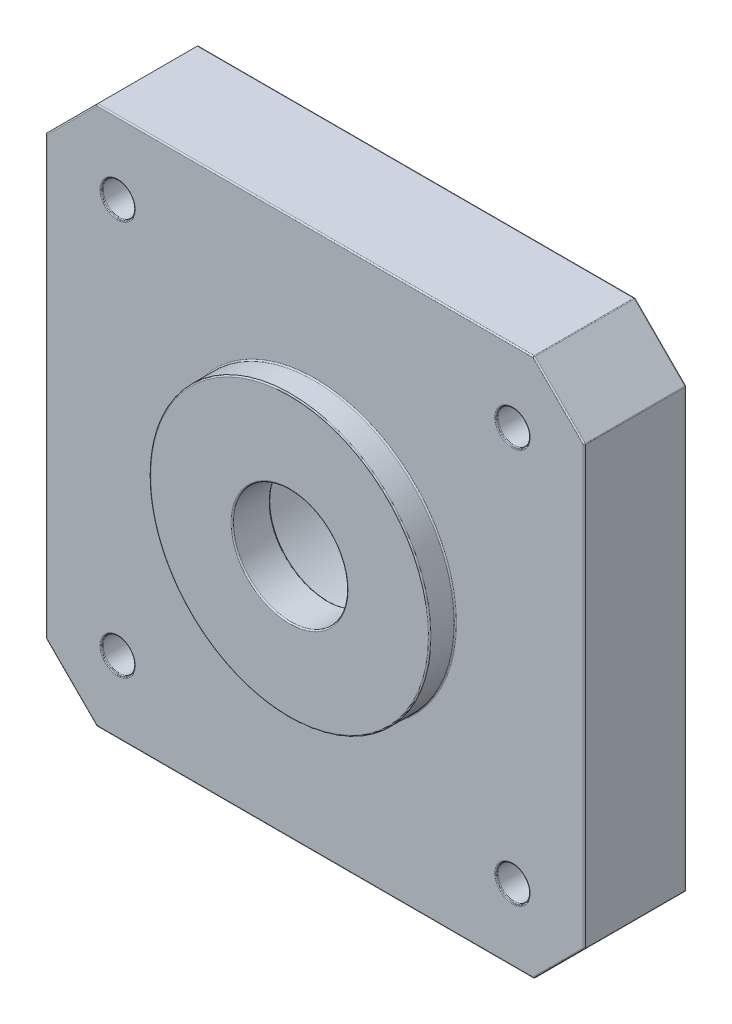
ISO-10303-21;
HEADER;
FILE_DESCRIPTION(('STEP AP214'),'2;1');
FILE_NAME('part.step','',(''),(''),'','','');
FILE_SCHEMA(('AUTOMOTIVE_DESIGN { 1 0 10303 214 1 1 1 1 }'));
ENDSEC;
DATA;
#1=APPLICATION_CONTEXT('core data for automotive mechanical design processes');
#2=APPLICATION_PROTOCOL_DEFINITION('international standard','automotive_design',2000,#1);
#3=PRODUCT_CONTEXT('',#1,'mechanical');
#4=PRODUCT('Part','Part','',(#3));
#5=PRODUCT_RELATED_PRODUCT_CATEGORY('part','',(#4));
#6=PRODUCT_DEFINITION_FORMATION('','',#4);
#7=PRODUCT_DEFINITION_CONTEXT('part definition',#1,'design');
#8=PRODUCT_DEFINITION('design','',#6,#7);
#9=PRODUCT_DEFINITION_SHAPE('','',#8);
#10=(LENGTH_UNIT() NAMED_UNIT(*) SI_UNIT(.MILLI.,.METRE.));
#11=(NAMED_UNIT(*) PLANE_ANGLE_UNIT() SI_UNIT($,.RADIAN.));
#12=(NAMED_UNIT(*) SI_UNIT($,.STERADIAN.) SOLID_ANGLE_UNIT());
#13=UNCERTAINTY_MEASURE_WITH_UNIT(LENGTH_MEASURE(1.E-05),#10,'distance_accuracy_value','');
#14=(GEOMETRIC_REPRESENTATION_CONTEXT(3) GLOBAL_UNCERTAINTY_ASSIGNED_CONTEXT((#13)) GLOBAL_UNIT_ASSIGNED_CONTEXT((#10,
#11,#12)) REPRESENTATION_CONTEXT('',''));
#15=CARTESIAN_POINT('',(0.,0.,0.));
#16=DIRECTION('',(0.,0.,1.));
#17=DIRECTION('',(1.,0.,0.));
#18=AXIS2_PLACEMENT_3D('',#15,#16,#17);
#19=CARTESIAN_POINT('',(21.15,21.15,0.1));
#20=DIRECTION('',(0.,0.,1.));
#21=DIRECTION('',(1.,0.,0.));
#22=AXIS2_PLACEMENT_3D('',#19,#20,#21);
#23=TOROIDAL_SURFACE('',#22,8.6,0.1);
#24=CARTESIAN_POINT('',(21.15,21.15,0.0999999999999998));
#25=DIRECTION('',(0.,0.,1.));
#26=DIRECTION('',(1.,0.,0.));
#27=AXIS2_PLACEMENT_3D('',#24,#25,#26);
#28=CIRCLE('',#27,8.5);
#29=CARTESIAN_POINT('',(29.65,21.15,0.0999999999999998));
#30=VERTEX_POINT('',#29);
#31=EDGE_CURVE('E1825',#30,#30,#28,.T.);
#32=ORIENTED_EDGE('',*,*,#31,.T.);
#33=EDGE_LOOP('',(#32));
#34=FACE_BOUND('',#33,.T.);
#35=CARTESIAN_POINT('',(21.15,21.15,0.));
#36=DIRECTION('',(0.,0.,-1.));
#37=DIRECTION('',(1.,0.,0.));
#38=AXIS2_PLACEMENT_3D('',#35,#36,#37);
#39=CIRCLE('',#38,8.6);
#40=CARTESIAN_POINT('',(29.75,21.15,0.));
#41=VERTEX_POINT('',#40);
#42=CARTESIAN_POINT('',(12.55,21.15,0.));
#43=VERTEX_POINT('',#42);
#44=EDGE_CURVE('E2649',#41,#43,#39,.T.);
#45=ORIENTED_EDGE('',*,*,#44,.T.);
#46=CARTESIAN_POINT('',(21.15,21.15,0.));
#47=DIRECTION('',(0.,0.,-1.));
#48=DIRECTION('',(-1.,0.,0.));
#49=AXIS2_PLACEMENT_3D('',#46,#47,#48);
#50=CIRCLE('',#49,8.6);
#51=EDGE_CURVE('E564',#43,#41,#50,.T.);
#52=ORIENTED_EDGE('',*,*,#51,.T.);
#53=EDGE_LOOP('',(#45,#52));
#54=FACE_BOUND('',#53,.T.);
#55=ADVANCED_FACE('F17',(#34,#54),#23,.T.);
#56=CARTESIAN_POINT('',(21.15,21.15,3.5));
#57=DIRECTION('',(0.,0.,1.));
#58=DIRECTION('',(1.,0.,0.));
#59=AXIS2_PLACEMENT_3D('',#56,#57,#58);
#60=CYLINDRICAL_SURFACE('',#59,8.5);
#61=CARTESIAN_POINT('',(21.15,21.15,6.9));
#62=DIRECTION('',(0.,0.,1.));
#63=DIRECTION('',(1.,0.,0.));
#64=AXIS2_PLACEMENT_3D('',#61,#62,#63);
#65=CIRCLE('',#64,8.5);
#66=CARTESIAN_POINT('',(29.65,21.15,6.9));
#67=VERTEX_POINT('',#66);
#68=EDGE_CURVE('E1366',#67,#67,#65,.T.);
#69=ORIENTED_EDGE('',*,*,#68,.T.);
#70=EDGE_LOOP('',(#69));
#71=FACE_BOUND('',#70,.T.);
#72=ORIENTED_EDGE('',*,*,#31,.F.);
#73=EDGE_LOOP('',(#72));
#74=FACE_BOUND('',#73,.T.);
#75=ADVANCED_FACE('F2602',(#71,#74),#60,.F.);
#76=CARTESIAN_POINT('',(21.15,21.15,0.));
#77=DIRECTION('',(0.,0.,1.));
#78=DIRECTION('',(1.,0.,0.));
#79=AXIS2_PLACEMENT_3D('',#76,#77,#78);
#80=PLANE('',#79);
#81=CARTESIAN_POINT('',(21.15,21.15,0.));
#82=DIRECTION('',(0.,0.,1.));
#83=DIRECTION('',(1.,0.,0.));
#84=AXIS2_PLACEMENT_3D('',#81,#82,#83);
#85=CIRCLE('',#84,10.5);
#86=CARTESIAN_POINT('',(31.65,21.15,0.));
#87=VERTEX_POINT('',#86);
#88=EDGE_CURVE('E515',#87,#87,#85,.T.);
#89=ORIENTED_EDGE('',*,*,#88,.F.);
#90=EDGE_LOOP('',(#89));
#91=FACE_BOUND('',#90,.T.);
#92=ORIENTED_EDGE('',*,*,#51,.F.);
#93=ORIENTED_EDGE('',*,*,#44,.F.);
#94=EDGE_LOOP('',(#92,#93));
#95=FACE_BOUND('',#94,.T.);
#96=ADVANCED_FACE('F2593',(#91,#95),#80,.F.);
#97=CARTESIAN_POINT('',(38.8857864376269,38.8857864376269,4.));
#98=DIRECTION('',(0.707106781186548,0.707106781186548,0.));
#99=DIRECTION('',(-0.707106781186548,0.707106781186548,0.));
#100=AXIS2_PLACEMENT_3D('',#97,#98,#99);
#101=PLANE('',#100);
#102=DIRECTION('',(0.,0.,1.));
#103=VECTOR('',#102,1.);
#104=CARTESIAN_POINT('',(40.3,37.4715728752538,4.));
#105=LINE('',#104,#103);
#106=CARTESIAN_POINT('',(40.3,37.4715728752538,6.));
#107=VERTEX_POINT('',#106);
#108=CARTESIAN_POINT('',(40.3,37.4715728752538,0.099999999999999));
#109=VERTEX_POINT('',#108);
#110=EDGE_CURVE('E514',#107,#109,#105,.F.);
#111=ORIENTED_EDGE('',*,*,#110,.F.);
#112=DIRECTION('',(-0.707106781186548,0.707106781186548,0.));
#113=VECTOR('',#112,1.);
#114=CARTESIAN_POINT('',(38.8857864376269,38.8857864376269,6.));
#115=LINE('',#114,#113);
#116=CARTESIAN_POINT('',(39.460015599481,38.3115572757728,6.));
#117=VERTEX_POINT('',#116);
#118=EDGE_CURVE('E2653',#117,#107,#115,.F.);
#119=ORIENTED_EDGE('',*,*,#118,.F.);
#120=DIRECTION('',(0.,0.,-1.));
#121=VECTOR('',#120,1.);
#122=CARTESIAN_POINT('',(39.460015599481,38.3115572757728,8.));
#123=LINE('',#122,#121);
#124=CARTESIAN_POINT('',(39.460015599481,38.3115572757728,0.099999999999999));
#125=VERTEX_POINT('',#124);
#126=EDGE_CURVE('E530',#125,#117,#123,.F.);
#127=ORIENTED_EDGE('',*,*,#126,.F.);
#128=DIRECTION('',(-0.707106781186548,0.707106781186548,0.));
#129=VECTOR('',#128,1.);
#130=CARTESIAN_POINT('',(38.8857864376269,38.8857864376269,0.0999999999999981));
#131=LINE('',#130,#129);
#132=EDGE_CURVE('E2701',#109,#125,#131,.T.);
#133=ORIENTED_EDGE('',*,*,#132,.F.);
#134=EDGE_LOOP('',(#111,#119,#127,#133));
#135=FACE_BOUND('',#134,.T.);
#136=ADVANCED_FACE('F2584',(#135),#101,.F.);
#137=CARTESIAN_POINT('',(38.8857864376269,38.8857864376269,4.));
#138=DIRECTION('',(0.707106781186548,0.707106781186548,0.));
#139=DIRECTION('',(-0.707106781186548,0.707106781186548,0.));
#140=AXIS2_PLACEMENT_3D('',#137,#138,#139);
#141=PLANE('',#140);
#142=DIRECTION('',(0.,0.,-1.));
#143=VECTOR('',#142,1.);
#144=CARTESIAN_POINT('',(38.3115572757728,39.460015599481,8.));
#145=LINE('',#144,#143);
#146=CARTESIAN_POINT('',(38.3115572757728,39.460015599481,6.));
#147=VERTEX_POINT('',#146);
#148=CARTESIAN_POINT('',(38.3115572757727,39.460015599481,0.0999999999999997));
#149=VERTEX_POINT('',#148);
#150=EDGE_CURVE('E1345',#147,#149,#145,.T.);
#151=ORIENTED_EDGE('',*,*,#150,.F.);
#152=DIRECTION('',(-0.707106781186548,0.707106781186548,0.));
#153=VECTOR('',#152,1.);
#154=CARTESIAN_POINT('',(38.8857864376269,38.8857864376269,6.));
#155=LINE('',#154,#153);
#156=CARTESIAN_POINT('',(37.4715728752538,40.3,6.));
#157=VERTEX_POINT('',#156);
#158=EDGE_CURVE('E2699',#157,#147,#155,.F.);
#159=ORIENTED_EDGE('',*,*,#158,.F.);
#160=DIRECTION('',(0.,0.,-1.));
#161=VECTOR('',#160,1.);
#162=CARTESIAN_POINT('',(37.4715728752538,40.3,4.));
#163=LINE('',#162,#161);
#164=CARTESIAN_POINT('',(37.4715728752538,40.3,0.099999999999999));
#165=VERTEX_POINT('',#164);
#166=EDGE_CURVE('E520',#165,#157,#163,.F.);
#167=ORIENTED_EDGE('',*,*,#166,.F.);
#168=DIRECTION('',(-0.707106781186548,0.707106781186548,0.));
#169=VECTOR('',#168,1.);
#170=CARTESIAN_POINT('',(38.8857864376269,38.8857864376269,0.0999999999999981));
#171=LINE('',#170,#169);
#172=EDGE_CURVE('E2696',#149,#165,#171,.T.);
#173=ORIENTED_EDGE('',*,*,#172,.F.);
#174=EDGE_LOOP('',(#151,#159,#167,#173));
#175=FACE_BOUND('',#174,.T.);
#176=ADVANCED_FACE('F2576',(#175),#141,.F.);
#177=CARTESIAN_POINT('',(3.41421356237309,38.8857864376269,4.));
#178=DIRECTION('',(-0.707106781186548,0.707106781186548,0.));
#179=DIRECTION('',(-0.707106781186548,-0.707106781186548,0.));
#180=AXIS2_PLACEMENT_3D('',#177,#178,#179);
#181=PLANE('',#180);
#182=DIRECTION('',(0.,0.,-1.));
#183=VECTOR('',#182,1.);
#184=CARTESIAN_POINT('',(4.8284271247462,40.3,4.));
#185=LINE('',#184,#183);
#186=CARTESIAN_POINT('',(4.8284271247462,40.3,6.));
#187=VERTEX_POINT('',#186);
#188=CARTESIAN_POINT('',(4.82842712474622,40.3,0.0999999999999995));
#189=VERTEX_POINT('',#188);
#190=EDGE_CURVE('E525',#187,#189,#185,.T.);
#191=ORIENTED_EDGE('',*,*,#190,.F.);
#192=DIRECTION('',(-0.707106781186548,-0.707106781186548,0.));
#193=VECTOR('',#192,1.);
#194=CARTESIAN_POINT('',(3.41421356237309,38.8857864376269,6.));
#195=LINE('',#194,#193);
#196=CARTESIAN_POINT('',(3.98844272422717,39.460015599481,6.));
#197=VERTEX_POINT('',#196);
#198=EDGE_CURVE('E2694',#197,#187,#195,.F.);
#199=ORIENTED_EDGE('',*,*,#198,.F.);
#200=DIRECTION('',(0.,0.,-1.));
#201=VECTOR('',#200,1.);
#202=CARTESIAN_POINT('',(3.98844272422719,39.460015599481,8.));
#203=LINE('',#202,#201);
#204=CARTESIAN_POINT('',(3.98844272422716,39.460015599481,0.099999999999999));
#205=VERTEX_POINT('',#204);
#206=EDGE_CURVE('E1343',#205,#197,#203,.F.);
#207=ORIENTED_EDGE('',*,*,#206,.F.);
#208=DIRECTION('',(-0.707106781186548,-0.707106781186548,0.));
#209=VECTOR('',#208,1.);
#210=CARTESIAN_POINT('',(3.41421356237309,38.8857864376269,0.0999999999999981));
#211=LINE('',#210,#209);
#212=EDGE_CURVE('E2688',#189,#205,#211,.T.);
#213=ORIENTED_EDGE('',*,*,#212,.F.);
#214=EDGE_LOOP('',(#191,#199,#207,#213));
#215=FACE_BOUND('',#214,.T.);
#216=ADVANCED_FACE('F2568',(#215),#181,.F.);
#217=CARTESIAN_POINT('',(3.41421356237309,38.8857864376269,4.));
#218=DIRECTION('',(-0.707106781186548,0.707106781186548,0.));
#219=DIRECTION('',(-0.707106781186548,-0.707106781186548,0.));
#220=AXIS2_PLACEMENT_3D('',#217,#218,#219);
#221=PLANE('',#220);
#222=DIRECTION('',(0.,0.,-1.));
#223=VECTOR('',#222,1.);
#224=CARTESIAN_POINT('',(2.83998440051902,38.3115572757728,8.));
#225=LINE('',#224,#223);
#226=CARTESIAN_POINT('',(2.83998440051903,38.3115572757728,6.));
#227=VERTEX_POINT('',#226);
#228=CARTESIAN_POINT('',(2.83998440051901,38.3115572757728,0.0999999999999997));
#229=VERTEX_POINT('',#228);
#230=EDGE_CURVE('E1340',#227,#229,#225,.T.);
#231=ORIENTED_EDGE('',*,*,#230,.F.);
#232=DIRECTION('',(-0.707106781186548,-0.707106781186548,0.));
#233=VECTOR('',#232,1.);
#234=CARTESIAN_POINT('',(3.41421356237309,38.8857864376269,6.));
#235=LINE('',#234,#233);
#236=CARTESIAN_POINT('',(2.,37.4715728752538,6.));
#237=VERTEX_POINT('',#236);
#238=EDGE_CURVE('E2682',#237,#227,#235,.F.);
#239=ORIENTED_EDGE('',*,*,#238,.F.);
#240=DIRECTION('',(0.,0.,-1.));
#241=VECTOR('',#240,1.);
#242=CARTESIAN_POINT('',(2.,37.4715728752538,4.));
#243=LINE('',#242,#241);
#244=CARTESIAN_POINT('',(1.99999999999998,37.4715728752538,0.0999999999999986));
#245=VERTEX_POINT('',#244);
#246=EDGE_CURVE('E511',#245,#237,#243,.F.);
#247=ORIENTED_EDGE('',*,*,#246,.F.);
#248=DIRECTION('',(-0.707106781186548,-0.707106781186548,0.));
#249=VECTOR('',#248,1.);
#250=CARTESIAN_POINT('',(3.41421356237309,38.8857864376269,0.0999999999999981));
#251=LINE('',#250,#249);
#252=EDGE_CURVE('E2678',#229,#245,#251,.T.);
#253=ORIENTED_EDGE('',*,*,#252,.F.);
#254=EDGE_LOOP('',(#231,#239,#247,#253));
#255=FACE_BOUND('',#254,.T.);
#256=ADVANCED_FACE('F543',(#255),#221,.F.);
#257=CARTESIAN_POINT('',(21.15,21.15,6.9));
#258=DIRECTION('',(0.,0.,1.));
#259=DIRECTION('',(1.,0.,0.));
#260=AXIS2_PLACEMENT_3D('',#257,#258,#259);
#261=TOROIDAL_SURFACE('',#260,8.4,0.1);
#262=ORIENTED_EDGE('',*,*,#68,.F.);
#263=EDGE_LOOP('',(#262));
#264=FACE_BOUND('',#263,.T.);
#265=CARTESIAN_POINT('',(21.15,21.15,7.));
#266=DIRECTION('',(0.,0.,1.));
#267=DIRECTION('',(-1.,0.,0.));
#268=AXIS2_PLACEMENT_3D('',#265,#266,#267);
#269=CIRCLE('',#268,8.4);
#270=CARTESIAN_POINT('',(12.75,21.15,7.));
#271=VERTEX_POINT('',#270);
#272=CARTESIAN_POINT('',(29.55,21.15,7.));
#273=VERTEX_POINT('',#272);
#274=EDGE_CURVE('E318',#271,#273,#269,.T.);
#275=ORIENTED_EDGE('',*,*,#274,.T.);
#276=CARTESIAN_POINT('',(21.15,21.15,7.));
#277=DIRECTION('',(0.,0.,1.));
#278=DIRECTION('',(1.,0.,0.));
#279=AXIS2_PLACEMENT_3D('',#276,#277,#278);
#280=CIRCLE('',#279,8.4);
#281=EDGE_CURVE('E1279',#273,#271,#280,.T.);
#282=ORIENTED_EDGE('',*,*,#281,.T.);
#283=EDGE_LOOP('',(#275,#282));
#284=FACE_BOUND('',#283,.T.);
#285=ADVANCED_FACE('F537',(#264,#284),#261,.F.);
#286=CARTESIAN_POINT('',(21.15,21.15,3.5));
#287=DIRECTION('',(0.,0.,1.));
#288=DIRECTION('',(1.,0.,0.));
#289=AXIS2_PLACEMENT_3D('',#286,#287,#288);
#290=CYLINDRICAL_SURFACE('',#289,10.5);
#291=ORIENTED_EDGE('',*,*,#88,.T.);
#292=EDGE_LOOP('',(#291));
#293=FACE_BOUND('',#292,.T.);
#294=CARTESIAN_POINT('',(21.15,21.15,6.));
#295=DIRECTION('',(0.,0.,1.));
#296=DIRECTION('',(1.,0.,0.));
#297=AXIS2_PLACEMENT_3D('',#294,#295,#296);
#298=CIRCLE('',#297,10.5);
#299=CARTESIAN_POINT('',(31.65,21.15,6.));
#300=VERTEX_POINT('',#299);
#301=EDGE_CURVE('E508',#300,#300,#298,.F.);
#302=ORIENTED_EDGE('',*,*,#301,.T.);
#303=EDGE_LOOP('',(#302));
#304=FACE_BOUND('',#303,.T.);
#305=ADVANCED_FACE('F542',(#293,#304),#290,.T.);
#306=CARTESIAN_POINT('',(2.,21.15,4.));
#307=DIRECTION('',(1.,0.,0.));
#308=DIRECTION('',(0.,0.,-1.));
#309=AXIS2_PLACEMENT_3D('',#306,#307,#308);
#310=PLANE('',#309);
#311=DIRECTION('',(0.,1.,0.));
#312=VECTOR('',#311,1.);
#313=CARTESIAN_POINT('',(2.,21.15,6.));
#314=LINE('',#313,#312);
#315=CARTESIAN_POINT('',(2.,4.82842712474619,6.));
#316=VERTEX_POINT('',#315);
#317=EDGE_CURVE('E506',#237,#316,#314,.F.);
#318=ORIENTED_EDGE('',*,*,#317,.T.);
#319=DIRECTION('',(0.,0.,1.));
#320=VECTOR('',#319,1.);
#321=CARTESIAN_POINT('',(1.99999999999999,4.82842712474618,4.));
#322=LINE('',#321,#320);
#323=CARTESIAN_POINT('',(2.,4.82842712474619,0.0999999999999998));
#324=VERTEX_POINT('',#323);
#325=EDGE_CURVE('E500',#316,#324,#322,.F.);
#326=ORIENTED_EDGE('',*,*,#325,.T.);
#327=DIRECTION('',(0.,-1.,0.));
#328=VECTOR('',#327,1.);
#329=CARTESIAN_POINT('',(2.,21.15,0.1));
#330=LINE('',#329,#328);
#331=EDGE_CURVE('E1272',#245,#324,#330,.T.);
#332=ORIENTED_EDGE('',*,*,#331,.F.);
#333=ORIENTED_EDGE('',*,*,#246,.T.);
#334=EDGE_LOOP('',(#318,#326,#332,#333));
#335=FACE_BOUND('',#334,.T.);
#336=ADVANCED_FACE('F2540',(#335),#310,.T.);
#337=CARTESIAN_POINT('',(40.3,21.15,4.));
#338=DIRECTION('',(-1.,0.,0.));
#339=DIRECTION('',(0.,0.,1.));
#340=AXIS2_PLACEMENT_3D('',#337,#338,#339);
#341=PLANE('',#340);
#342=DIRECTION('',(0.,1.,0.));
#343=VECTOR('',#342,1.);
#344=CARTESIAN_POINT('',(40.3,21.15,6.));
#345=LINE('',#344,#343);
#346=CARTESIAN_POINT('',(40.3,4.8284271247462,6.));
#347=VERTEX_POINT('',#346);
#348=EDGE_CURVE('E479',#347,#107,#345,.T.);
#349=ORIENTED_EDGE('',*,*,#348,.T.);
#350=ORIENTED_EDGE('',*,*,#110,.T.);
#351=DIRECTION('',(0.,1.,0.));
#352=VECTOR('',#351,1.);
#353=CARTESIAN_POINT('',(40.3,21.15,0.1));
#354=LINE('',#353,#352);
#355=CARTESIAN_POINT('',(40.3,4.8284271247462,0.0999999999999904));
#356=VERTEX_POINT('',#355);
#357=EDGE_CURVE('E490',#356,#109,#354,.T.);
#358=ORIENTED_EDGE('',*,*,#357,.F.);
#359=DIRECTION('',(0.,0.,1.));
#360=VECTOR('',#359,1.);
#361=CARTESIAN_POINT('',(40.3,4.8284271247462,4.));
#362=LINE('',#361,#360);
#363=EDGE_CURVE('E487',#356,#347,#362,.T.);
#364=ORIENTED_EDGE('',*,*,#363,.T.);
#365=EDGE_LOOP('',(#349,#350,#358,#364));
#366=FACE_BOUND('',#365,.T.);
#367=ADVANCED_FACE('F2531',(#366),#341,.T.);
#368=CARTESIAN_POINT('',(21.15,40.3,4.));
#369=DIRECTION('',(0.,-1.,0.));
#370=DIRECTION('',(0.,0.,-1.));
#371=AXIS2_PLACEMENT_3D('',#368,#369,#370);
#372=PLANE('',#371);
#373=DIRECTION('',(1.,0.,0.));
#374=VECTOR('',#373,1.);
#375=CARTESIAN_POINT('',(21.15,40.3,6.));
#376=LINE('',#375,#374);
#377=EDGE_CURVE('E1357',#157,#187,#376,.F.);
#378=ORIENTED_EDGE('',*,*,#377,.T.);
#379=ORIENTED_EDGE('',*,*,#190,.T.);
#380=DIRECTION('',(-1.,0.,0.));
#381=VECTOR('',#380,1.);
#382=CARTESIAN_POINT('',(21.15,40.3,0.1));
#383=LINE('',#382,#381);
#384=EDGE_CURVE('E1269',#165,#189,#383,.T.);
#385=ORIENTED_EDGE('',*,*,#384,.F.);
#386=ORIENTED_EDGE('',*,*,#166,.T.);
#387=EDGE_LOOP('',(#378,#379,#385,#386));
#388=FACE_BOUND('',#387,.T.);
#389=ADVANCED_FACE('F2523',(#388),#372,.T.);
#390=CARTESIAN_POINT('',(21.15,2.,4.));
#391=DIRECTION('',(0.,1.,0.));
#392=DIRECTION('',(0.,0.,1.));
#393=AXIS2_PLACEMENT_3D('',#390,#391,#392);
#394=PLANE('',#393);
#395=DIRECTION('',(1.,0.,0.));
#396=VECTOR('',#395,1.);
#397=CARTESIAN_POINT('',(21.15,2.,6.));
#398=LINE('',#397,#396);
#399=CARTESIAN_POINT('',(4.82842712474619,2.,6.));
#400=VERTEX_POINT('',#399);
#401=CARTESIAN_POINT('',(37.4715728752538,2.,6.));
#402=VERTEX_POINT('',#401);
#403=EDGE_CURVE('E452',#400,#402,#398,.T.);
#404=ORIENTED_EDGE('',*,*,#403,.T.);
#405=DIRECTION('',(0.,0.,1.));
#406=VECTOR('',#405,1.);
#407=CARTESIAN_POINT('',(37.4715728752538,2.,4.));
#408=LINE('',#407,#406);
#409=CARTESIAN_POINT('',(37.4715728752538,2.00000000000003,0.0999999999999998));
#410=VERTEX_POINT('',#409);
#411=EDGE_CURVE('E1256',#402,#410,#408,.F.);
#412=ORIENTED_EDGE('',*,*,#411,.T.);
#413=DIRECTION('',(1.,0.,0.));
#414=VECTOR('',#413,1.);
#415=CARTESIAN_POINT('',(21.15,2.,0.1));
#416=LINE('',#415,#414);
#417=CARTESIAN_POINT('',(4.82842712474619,2.,0.1));
#418=VERTEX_POINT('',#417);
#419=EDGE_CURVE('E455',#418,#410,#416,.T.);
#420=ORIENTED_EDGE('',*,*,#419,.F.);
#421=DIRECTION('',(0.,0.,1.));
#422=VECTOR('',#421,1.);
#423=CARTESIAN_POINT('',(4.82842712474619,2.,4.));
#424=LINE('',#423,#422);
#425=EDGE_CURVE('E447',#418,#400,#424,.T.);
#426=ORIENTED_EDGE('',*,*,#425,.T.);
#427=EDGE_LOOP('',(#404,#412,#420,#426));
#428=FACE_BOUND('',#427,.T.);
#429=ADVANCED_FACE('F449',(#428),#394,.T.);
#430=CARTESIAN_POINT('',(36.65,36.65,8.));
#431=DIRECTION('',(0.,0.,-1.));
#432=DIRECTION('',(-1.,0.,0.));
#433=AXIS2_PLACEMENT_3D('',#430,#431,#432);
#434=CYLINDRICAL_SURFACE('',#433,3.2645);
#435=ORIENTED_EDGE('',*,*,#150,.T.);
#436=CARTESIAN_POINT('',(36.65,36.65,0.1));
#437=DIRECTION('',(0.,0.,-1.));
#438=DIRECTION('',(-1.,0.,0.));
#439=AXIS2_PLACEMENT_3D('',#436,#437,#438);
#440=CIRCLE('',#439,3.2645);
#441=EDGE_CURVE('E1331',#125,#149,#440,.T.);
#442=ORIENTED_EDGE('',*,*,#441,.F.);
#443=ORIENTED_EDGE('',*,*,#126,.T.);
#444=CARTESIAN_POINT('',(36.65,36.65,6.));
#445=DIRECTION('',(0.,0.,-1.));
#446=DIRECTION('',(-1.,0.,0.));
#447=AXIS2_PLACEMENT_3D('',#444,#445,#446);
#448=CIRCLE('',#447,3.2645);
#449=EDGE_CURVE('E495',#117,#147,#448,.T.);
#450=ORIENTED_EDGE('',*,*,#449,.T.);
#451=EDGE_LOOP('',(#435,#442,#443,#450));
#452=FACE_BOUND('',#451,.T.);
#453=ADVANCED_FACE('F2508',(#452),#434,.T.);
#454=CARTESIAN_POINT('',(5.65,36.65,8.));
#455=DIRECTION('',(0.,0.,-1.));
#456=DIRECTION('',(-1.,0.,0.));
#457=AXIS2_PLACEMENT_3D('',#454,#455,#456);
#458=CYLINDRICAL_SURFACE('',#457,3.2645);
#459=ORIENTED_EDGE('',*,*,#230,.T.);
#460=CARTESIAN_POINT('',(5.65,36.65,0.1));
#461=DIRECTION('',(0.,0.,-1.));
#462=DIRECTION('',(-1.,0.,0.));
#463=AXIS2_PLACEMENT_3D('',#460,#461,#462);
#464=CIRCLE('',#463,3.2645);
#465=EDGE_CURVE('E1330',#205,#229,#464,.T.);
#466=ORIENTED_EDGE('',*,*,#465,.F.);
#467=ORIENTED_EDGE('',*,*,#206,.T.);
#468=CARTESIAN_POINT('',(5.65,36.65,6.));
#469=DIRECTION('',(0.,0.,-1.));
#470=DIRECTION('',(-1.,0.,0.));
#471=AXIS2_PLACEMENT_3D('',#468,#469,#470);
#472=CIRCLE('',#471,3.2645);
#473=EDGE_CURVE('E1257',#197,#227,#472,.T.);
#474=ORIENTED_EDGE('',*,*,#473,.T.);
#475=EDGE_LOOP('',(#459,#466,#467,#474));
#476=FACE_BOUND('',#475,.T.);
#477=ADVANCED_FACE('F1300',(#476),#458,.T.);
#478=CARTESIAN_POINT('',(21.15,21.15,7.));
#479=DIRECTION('',(0.,0.,1.));
#480=DIRECTION('',(1.,0.,0.));
#481=AXIS2_PLACEMENT_3D('',#478,#479,#480);
#482=PLANE('',#481);
#483=ORIENTED_EDGE('',*,*,#274,.F.);
#484=ORIENTED_EDGE('',*,*,#281,.F.);
#485=EDGE_LOOP('',(#483,#484));
#486=FACE_BOUND('',#485,.T.);
#487=CARTESIAN_POINT('',(21.15,21.15,7.));
#488=DIRECTION('',(0.,0.,-1.));
#489=DIRECTION('',(-1.,0.,0.));
#490=AXIS2_PLACEMENT_3D('',#487,#488,#489);
#491=CIRCLE('',#490,4.6);
#492=CARTESIAN_POINT('',(16.55,21.15,7.));
#493=VERTEX_POINT('',#492);
#494=CARTESIAN_POINT('',(25.75,21.15,7.));
#495=VERTEX_POINT('',#494);
#496=EDGE_CURVE('E1284',#493,#495,#491,.T.);
#497=ORIENTED_EDGE('',*,*,#496,.F.);
#498=CARTESIAN_POINT('',(21.15,21.15,7.));
#499=DIRECTION('',(0.,0.,-1.));
#500=DIRECTION('',(1.,0.,0.));
#501=AXIS2_PLACEMENT_3D('',#498,#499,#500);
#502=CIRCLE('',#501,4.6);
#503=EDGE_CURVE('E1328',#495,#493,#502,.T.);
#504=ORIENTED_EDGE('',*,*,#503,.F.);
#505=EDGE_LOOP('',(#497,#504));
#506=FACE_BOUND('',#505,.T.);
#507=ADVANCED_FACE('F1290',(#486,#506),#482,.F.);
#508=CARTESIAN_POINT('',(3.41421356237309,3.41421356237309,4.));
#509=DIRECTION('',(-0.707106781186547,-0.707106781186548,0.));
#510=DIRECTION('',(0.707106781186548,-0.707106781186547,0.));
#511=AXIS2_PLACEMENT_3D('',#508,#509,#510);
#512=PLANE('',#511);
#513=DIRECTION('',(0.,0.,-1.));
#514=VECTOR('',#513,1.);
#515=CARTESIAN_POINT('',(3.98844272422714,2.83998440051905,8.));
#516=LINE('',#515,#514);
#517=CARTESIAN_POINT('',(3.98844272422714,2.83998440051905,6.));
#518=VERTEX_POINT('',#517);
#519=CARTESIAN_POINT('',(3.98844272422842,2.83998440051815,0.0999999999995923));
#520=VERTEX_POINT('',#519);
#521=EDGE_CURVE('E466',#518,#520,#516,.T.);
#522=ORIENTED_EDGE('',*,*,#521,.F.);
#523=DIRECTION('',(0.707106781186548,-0.707106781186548,0.));
#524=VECTOR('',#523,1.);
#525=CARTESIAN_POINT('',(3.98844272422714,2.83998440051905,6.));
#526=LINE('',#525,#524);
#527=EDGE_CURVE('E463',#518,#400,#526,.T.);
#528=ORIENTED_EDGE('',*,*,#527,.T.);
#529=ORIENTED_EDGE('',*,*,#425,.F.);
#530=DIRECTION('',(0.707106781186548,-0.707106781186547,0.));
#531=VECTOR('',#530,1.);
#532=CARTESIAN_POINT('',(3.41421356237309,3.41421356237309,0.0999999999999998));
#533=LINE('',#532,#531);
#534=EDGE_CURVE('E459',#520,#418,#533,.T.);
#535=ORIENTED_EDGE('',*,*,#534,.F.);
#536=EDGE_LOOP('',(#522,#528,#529,#535));
#537=FACE_BOUND('',#536,.T.);
#538=ADVANCED_FACE('F464',(#537),#512,.F.);
#539=CARTESIAN_POINT('',(3.41421356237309,3.41421356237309,4.));
#540=DIRECTION('',(-0.707106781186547,-0.707106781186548,0.));
#541=DIRECTION('',(0.707106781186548,-0.707106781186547,0.));
#542=AXIS2_PLACEMENT_3D('',#539,#540,#541);
#543=PLANE('',#542);
#544=ORIENTED_EDGE('',*,*,#325,.F.);
#545=DIRECTION('',(0.707106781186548,-0.707106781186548,0.));
#546=VECTOR('',#545,1.);
#547=CARTESIAN_POINT('',(2.,4.82842712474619,6.));
#548=LINE('',#547,#546);
#549=CARTESIAN_POINT('',(2.83998440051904,3.98844272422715,6.));
#550=VERTEX_POINT('',#549);
#551=EDGE_CURVE('E469',#316,#550,#548,.T.);
#552=ORIENTED_EDGE('',*,*,#551,.T.);
#553=DIRECTION('',(0.,0.,-1.));
#554=VECTOR('',#553,1.);
#555=CARTESIAN_POINT('',(2.83998440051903,3.98844272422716,8.));
#556=LINE('',#555,#554);
#557=CARTESIAN_POINT('',(2.83998440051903,3.98844272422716,0.0999999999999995));
#558=VERTEX_POINT('',#557);
#559=EDGE_CURVE('E1167',#558,#550,#556,.F.);
#560=ORIENTED_EDGE('',*,*,#559,.F.);
#561=DIRECTION('',(0.707106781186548,-0.707106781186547,0.));
#562=VECTOR('',#561,1.);
#563=CARTESIAN_POINT('',(3.41421356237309,3.41421356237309,0.1));
#564=LINE('',#563,#562);
#565=EDGE_CURVE('E503',#324,#558,#564,.T.);
#566=ORIENTED_EDGE('',*,*,#565,.F.);
#567=EDGE_LOOP('',(#544,#552,#560,#566));
#568=FACE_BOUND('',#567,.T.);
#569=ADVANCED_FACE('F2481',(#568),#543,.F.);
#570=CARTESIAN_POINT('',(38.8857864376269,3.41421356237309,4.));
#571=DIRECTION('',(0.707106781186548,-0.707106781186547,0.));
#572=DIRECTION('',(0.707106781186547,0.707106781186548,0.));
#573=AXIS2_PLACEMENT_3D('',#570,#571,#572);
#574=PLANE('',#573);
#575=DIRECTION('',(0.,0.,-1.));
#576=VECTOR('',#575,1.);
#577=CARTESIAN_POINT('',(39.460015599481,3.9884427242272,8.));
#578=LINE('',#577,#576);
#579=CARTESIAN_POINT('',(39.460015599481,3.98844272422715,6.));
#580=VERTEX_POINT('',#579);
#581=CARTESIAN_POINT('',(39.4600155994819,3.98844272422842,0.0999999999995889));
#582=VERTEX_POINT('',#581);
#583=EDGE_CURVE('E1154',#580,#582,#578,.T.);
#584=ORIENTED_EDGE('',*,*,#583,.F.);
#585=DIRECTION('',(0.707106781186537,0.707106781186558,0.));
#586=VECTOR('',#585,1.);
#587=CARTESIAN_POINT('',(39.460015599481,3.98844272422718,6.));
#588=LINE('',#587,#586);
#589=EDGE_CURVE('E476',#580,#347,#588,.T.);
#590=ORIENTED_EDGE('',*,*,#589,.T.);
#591=ORIENTED_EDGE('',*,*,#363,.F.);
#592=DIRECTION('',(0.707106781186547,0.707106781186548,0.));
#593=VECTOR('',#592,1.);
#594=CARTESIAN_POINT('',(38.8857864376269,3.41421356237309,0.0999999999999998));
#595=LINE('',#594,#593);
#596=EDGE_CURVE('E489',#582,#356,#595,.T.);
#597=ORIENTED_EDGE('',*,*,#596,.F.);
#598=EDGE_LOOP('',(#584,#590,#591,#597));
#599=FACE_BOUND('',#598,.T.);
#600=ADVANCED_FACE('F2473',(#599),#574,.F.);
#601=CARTESIAN_POINT('',(21.15,21.15,6.));
#602=DIRECTION('',(0.,0.,1.));
#603=DIRECTION('',(1.,0.,0.));
#604=AXIS2_PLACEMENT_3D('',#601,#602,#603);
#605=PLANE('',#604);
#606=ORIENTED_EDGE('',*,*,#198,.T.);
#607=ORIENTED_EDGE('',*,*,#377,.F.);
#608=ORIENTED_EDGE('',*,*,#158,.T.);
#609=ORIENTED_EDGE('',*,*,#449,.F.);
#610=ORIENTED_EDGE('',*,*,#118,.T.);
#611=ORIENTED_EDGE('',*,*,#348,.F.);
#612=ORIENTED_EDGE('',*,*,#589,.F.);
#613=CARTESIAN_POINT('',(36.65,5.65,6.));
#614=DIRECTION('',(0.,0.,-1.));
#615=DIRECTION('',(-1.,0.,0.));
#616=AXIS2_PLACEMENT_3D('',#613,#614,#615);
#617=CIRCLE('',#616,3.2645);
#618=CARTESIAN_POINT('',(38.3115572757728,2.83998440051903,6.));
#619=VERTEX_POINT('',#618);
#620=EDGE_CURVE('E1637',#619,#580,#617,.T.);
#621=ORIENTED_EDGE('',*,*,#620,.F.);
#622=DIRECTION('',(0.707106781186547,0.707106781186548,0.));
#623=VECTOR('',#622,1.);
#624=CARTESIAN_POINT('',(38.8857864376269,3.41421356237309,6.));
#625=LINE('',#624,#623);
#626=EDGE_CURVE('E474',#619,#402,#625,.F.);
#627=ORIENTED_EDGE('',*,*,#626,.T.);
#628=ORIENTED_EDGE('',*,*,#403,.F.);
#629=ORIENTED_EDGE('',*,*,#527,.F.);
#630=CARTESIAN_POINT('',(5.65,5.65,6.));
#631=DIRECTION('',(0.,0.,-1.));
#632=DIRECTION('',(-1.,0.,0.));
#633=AXIS2_PLACEMENT_3D('',#630,#631,#632);
#634=CIRCLE('',#633,3.2645);
#635=EDGE_CURVE('E1171',#550,#518,#634,.T.);
#636=ORIENTED_EDGE('',*,*,#635,.F.);
#637=ORIENTED_EDGE('',*,*,#551,.F.);
#638=ORIENTED_EDGE('',*,*,#317,.F.);
#639=ORIENTED_EDGE('',*,*,#238,.T.);
#640=ORIENTED_EDGE('',*,*,#473,.F.);
#641=EDGE_LOOP('',(#606,#607,#608,#609,#610,#611,#612,#621,#627,#628,#629,#636,#637,#638,#639,#640));
#642=FACE_BOUND('',#641,.T.);
#643=ORIENTED_EDGE('',*,*,#301,.F.);
#644=EDGE_LOOP('',(#643));
#645=FACE_BOUND('',#644,.T.);
#646=ADVANCED_FACE('F471',(#642,#645),#605,.F.);
#647=CARTESIAN_POINT('',(38.8857864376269,3.41421356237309,4.));
#648=DIRECTION('',(0.707106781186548,-0.707106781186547,0.));
#649=DIRECTION('',(0.707106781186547,0.707106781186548,0.));
#650=AXIS2_PLACEMENT_3D('',#647,#648,#649);
#651=PLANE('',#650);
#652=ORIENTED_EDGE('',*,*,#411,.F.);
#653=ORIENTED_EDGE('',*,*,#626,.F.);
#654=DIRECTION('',(0.,0.,-1.));
#655=VECTOR('',#654,1.);
#656=CARTESIAN_POINT('',(38.3115572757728,2.83998440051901,8.));
#657=LINE('',#656,#655);
#658=CARTESIAN_POINT('',(38.3115572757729,2.83998440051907,0.100000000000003));
#659=VERTEX_POINT('',#658);
#660=EDGE_CURVE('E1145',#659,#619,#657,.F.);
#661=ORIENTED_EDGE('',*,*,#660,.F.);
#662=DIRECTION('',(0.707106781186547,0.707106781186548,0.));
#663=VECTOR('',#662,1.);
#664=CARTESIAN_POINT('',(38.8857864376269,3.41421356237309,0.0999999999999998));
#665=LINE('',#664,#663);
#666=EDGE_CURVE('E1335',#410,#659,#665,.T.);
#667=ORIENTED_EDGE('',*,*,#666,.F.);
#668=EDGE_LOOP('',(#652,#653,#661,#667));
#669=FACE_BOUND('',#668,.T.);
#670=ADVANCED_FACE('F1233',(#669),#651,.F.);
#671=CARTESIAN_POINT('',(36.65,36.65,0.1));
#672=DIRECTION('',(0.,0.,-1.));
#673=DIRECTION('',(-1.,0.,0.));
#674=AXIS2_PLACEMENT_3D('',#671,#672,#673);
#675=TOROIDAL_SURFACE('',#674,3.1645,0.1);
#676=CARTESIAN_POINT('',(39.4600155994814,38.3115572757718,0.0999999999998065));
#677=CARTESIAN_POINT('',(39.4600207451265,38.3115506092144,0.0983507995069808));
#678=CARTESIAN_POINT('',(39.4598184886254,38.3118114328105,0.0967748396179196));
#679=CARTESIAN_POINT('',(39.4590255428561,38.3128334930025,0.0933695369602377));
#680=CARTESIAN_POINT('',(39.4583411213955,38.3137154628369,0.0915947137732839));
#681=CARTESIAN_POINT('',(39.4561018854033,38.3165988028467,0.0870334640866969));
#682=CARTESIAN_POINT('',(39.4542958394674,38.3189220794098,0.0846278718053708));
#683=CARTESIAN_POINT('',(39.4492012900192,38.3254649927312,0.0788918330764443));
#684=CARTESIAN_POINT('',(39.44573511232,38.3299059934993,0.0760334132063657));
#685=CARTESIAN_POINT('',(39.4386040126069,38.3390168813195,0.0709559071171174));
#686=CARTESIAN_POINT('',(39.4349378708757,38.3436881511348,0.0687414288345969));
#687=CARTESIAN_POINT('',(39.4268717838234,38.3539362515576,0.0643666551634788));
#688=CARTESIAN_POINT('',(39.4224540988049,38.3595306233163,0.0622812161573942));
#689=CARTESIAN_POINT('',(39.4135418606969,38.3707783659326,0.0584582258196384));
#690=CARTESIAN_POINT('',(39.4090472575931,38.3764317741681,0.0567209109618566));
#691=CARTESIAN_POINT('',(39.3954684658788,38.3934530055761,0.0518718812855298));
#692=CARTESIAN_POINT('',(39.386304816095,38.4048621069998,0.049130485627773));
#693=CARTESIAN_POINT('',(39.3678528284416,38.4276768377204,0.0442407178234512));
#694=CARTESIAN_POINT('',(39.3585646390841,38.4390824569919,0.0420916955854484));
#695=CARTESIAN_POINT('',(39.3398860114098,38.4618607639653,0.0382109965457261));
#696=CARTESIAN_POINT('',(39.3304956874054,38.4732334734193,0.0364788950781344));
#697=CARTESIAN_POINT('',(39.3147030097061,38.4922279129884,0.0338394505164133));
#698=CARTESIAN_POINT('',(39.3083273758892,38.499860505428,0.0328475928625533));
#699=CARTESIAN_POINT('',(39.2955392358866,38.5150985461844,0.0309841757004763));
#700=CARTESIAN_POINT('',(39.2891267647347,38.5227040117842,0.0301125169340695));
#701=CARTESIAN_POINT('',(39.2612178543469,38.5556509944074,0.0265478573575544));
#702=CARTESIAN_POINT('',(39.2395167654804,38.5808746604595,0.0243627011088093));
#703=CARTESIAN_POINT('',(39.1956876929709,38.6310292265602,0.0207148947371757));
#704=CARTESIAN_POINT('',(39.1735594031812,38.6559598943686,0.0192527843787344));
#705=CARTESIAN_POINT('',(39.1139372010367,38.7220923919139,0.0160294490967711));
#706=CARTESIAN_POINT('',(39.0760880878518,38.7629968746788,0.0147248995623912));
#707=CARTESIAN_POINT('',(38.9993254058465,38.8438224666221,0.0130335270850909));
#708=CARTESIAN_POINT('',(38.9604116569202,38.8837434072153,0.0126468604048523));
#709=CARTESIAN_POINT('',(38.8815842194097,38.9625332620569,0.0126615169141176));
#710=CARTESIAN_POINT('',(38.8416712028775,39.0014028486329,0.0130623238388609));
#711=CARTESIAN_POINT('',(38.7608641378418,39.0780774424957,0.0147868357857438));
#712=CARTESIAN_POINT('',(38.7199702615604,39.1158826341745,0.0161103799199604));
#713=CARTESIAN_POINT('',(38.6542123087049,39.1751145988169,0.0193519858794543));
#714=CARTESIAN_POINT('',(38.6296500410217,39.1969016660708,0.0208038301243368));
#715=CARTESIAN_POINT('',(38.5801984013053,39.2400986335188,0.0244238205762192));
#716=CARTESIAN_POINT('',(38.5553086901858,39.2615080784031,0.0265927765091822));
#717=CARTESIAN_POINT('',(38.5048489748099,39.3042512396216,0.0320363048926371));
#718=CARTESIAN_POINT('',(38.4792745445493,39.3255777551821,0.0353286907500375));
#719=CARTESIAN_POINT('',(38.4408412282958,39.3571342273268,0.0417578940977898));
#720=CARTESIAN_POINT('',(38.4280295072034,39.3675718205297,0.0441466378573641));
#721=CARTESIAN_POINT('',(38.4024276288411,39.3882691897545,0.0496729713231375));
#722=CARTESIAN_POINT('',(38.3896374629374,39.3985290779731,0.0528100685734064));
#723=CARTESIAN_POINT('',(38.3690795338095,39.4148952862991,0.0589660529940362));
#724=CARTESIAN_POINT('',(38.3612627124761,39.4210886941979,0.0615708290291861));
#725=CARTESIAN_POINT('',(38.3482136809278,39.431380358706,0.0667240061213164));
#726=CARTESIAN_POINT('',(38.3429336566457,39.435531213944,0.0690380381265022));
#727=CARTESIAN_POINT('',(38.3341522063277,39.4424136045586,0.0735895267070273));
#728=CARTESIAN_POINT('',(38.3305967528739,39.4451940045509,0.0756376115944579));
#729=CARTESIAN_POINT('',(38.3253275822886,39.4493063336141,0.0792667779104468));
#730=CARTESIAN_POINT('',(38.3235225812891,39.4507134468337,0.0806257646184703));
#731=CARTESIAN_POINT('',(38.3200559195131,39.4534131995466,0.0836083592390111));
#732=CARTESIAN_POINT('',(38.3183937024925,39.4547062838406,0.0852308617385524));
#733=CARTESIAN_POINT('',(38.3156644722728,39.4568275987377,0.0885196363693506));
#734=CARTESIAN_POINT('',(38.314544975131,39.4576970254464,0.0901115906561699));
#735=CARTESIAN_POINT('',(38.3128638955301,39.4590019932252,0.0934019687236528));
#736=CARTESIAN_POINT('',(38.3122423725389,39.4594841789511,0.0950446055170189));
#737=CARTESIAN_POINT('',(38.3116694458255,39.459928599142,0.0978201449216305));
#738=CARTESIAN_POINT('',(38.3115509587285,39.4600204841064,0.0989008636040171));
#739=CARTESIAN_POINT('',(38.311557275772,39.4600155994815,0.0999999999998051));
#740=B_SPLINE_CURVE_WITH_KNOTS('',3,(#676,#677,#678,#679,#680,#681,#682,#683,#684,#685,#686,
#687,#688,#689,#690,#691,#692,#693,#694,#695,#696,#697,#698,#699,#700,#701,#702,#703,#704,#705,
#706,#707,#708,#709,#710,#711,#712,#713,#714,#715,#716,#717,#718,#719,#720,#721,#722,#723,#724,
#725,#726,#727,#728,#729,#730,#731,#732,#733,#734,#735,#736,#737,#738,#739),.UNSPECIFIED.,.F.,
.F.,(4,2,2,2,2,2,2,2,2,2,2,2,2,2,2,2,2,2,2,2,2,2,2,2,2,2,2,2,2,2,2,4),(0.,0.00479964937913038,
0.0109576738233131,0.0222198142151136,0.0410851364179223,0.0600823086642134,0.0823475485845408,
0.104627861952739,0.149266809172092,0.193856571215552,0.238400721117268,0.268383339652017,
0.298341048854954,0.398359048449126,0.498451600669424,0.665650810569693,0.832878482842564,
0.999996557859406,1.16708550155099,1.26567021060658,1.36436661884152,1.46470691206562,
1.51478880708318,1.56483783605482,1.59573544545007,1.61702458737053,1.63186111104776,
1.63983589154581,1.64777804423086,1.65412417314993,1.65947572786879,1.6627323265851),.UNSPECIFIED.);
#741=EDGE_CURVE('E1662',#125,#149,#740,.T.);
#742=ORIENTED_EDGE('',*,*,#741,.F.);
#743=ORIENTED_EDGE('',*,*,#441,.T.);
#744=EDGE_LOOP('',(#742,#743));
#745=FACE_BOUND('',#744,.T.);
#746=CARTESIAN_POINT('',(36.65,36.65,0.));
#747=DIRECTION('',(0.,0.,1.));
#748=DIRECTION('',(-1.,0.,0.));
#749=AXIS2_PLACEMENT_3D('',#746,#747,#748);
#750=CIRCLE('',#749,3.1645);
#751=CARTESIAN_POINT('',(33.4855,36.65,0.));
#752=VERTEX_POINT('',#751);
#753=CARTESIAN_POINT('',(39.8145,36.65,0.));
#754=VERTEX_POINT('',#753);
#755=EDGE_CURVE('E1131',#752,#754,#750,.T.);
#756=ORIENTED_EDGE('',*,*,#755,.T.);
#757=CARTESIAN_POINT('',(36.65,36.65,0.));
#758=DIRECTION('',(0.,0.,1.));
#759=DIRECTION('',(1.,0.,0.));
#760=AXIS2_PLACEMENT_3D('',#757,#758,#759);
#761=CIRCLE('',#760,3.1645);
#762=EDGE_CURVE('E1121',#754,#752,#761,.T.);
#763=ORIENTED_EDGE('',*,*,#762,.T.);
#764=EDGE_LOOP('',(#756,#763));
#765=FACE_BOUND('',#764,.T.);
#766=ADVANCED_FACE('F1223',(#745,#765),#675,.T.);
#767=CARTESIAN_POINT('',(5.65,36.65,0.1));
#768=DIRECTION('',(0.,0.,-1.));
#769=DIRECTION('',(-1.,0.,0.));
#770=AXIS2_PLACEMENT_3D('',#767,#768,#769);
#771=TOROIDAL_SURFACE('',#770,3.1645,0.1);
#772=CARTESIAN_POINT('',(3.98844272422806,39.4600155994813,0.0999999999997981));
#773=CARTESIAN_POINT('',(3.98844939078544,39.4600207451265,0.0983507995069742));
#774=CARTESIAN_POINT('',(3.98818856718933,39.4598184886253,0.096774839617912));
#775=CARTESIAN_POINT('',(3.98716650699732,39.459025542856,0.0933695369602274));
#776=CARTESIAN_POINT('',(3.98628453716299,39.4583411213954,0.0915947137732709));
#777=CARTESIAN_POINT('',(3.98340119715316,39.4561018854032,0.0870334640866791));
#778=CARTESIAN_POINT('',(3.98107792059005,39.4542958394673,0.0846278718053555));
#779=CARTESIAN_POINT('',(3.97453500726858,39.4492012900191,0.0788918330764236));
#780=CARTESIAN_POINT('',(3.97009400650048,39.4457351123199,0.0760334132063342));
#781=CARTESIAN_POINT('',(3.96098311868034,39.4386040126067,0.0709559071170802));
#782=CARTESIAN_POINT('',(3.95631184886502,39.4349378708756,0.0687414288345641));
#783=CARTESIAN_POINT('',(3.94606374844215,39.4268717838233,0.0643666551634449));
#784=CARTESIAN_POINT('',(3.94046937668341,39.4224540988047,0.0622812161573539));
#785=CARTESIAN_POINT('',(3.92922163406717,39.4135418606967,0.0584582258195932));
#786=CARTESIAN_POINT('',(3.92356822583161,39.4090472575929,0.056720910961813));
#787=CARTESIAN_POINT('',(3.90654699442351,39.3954684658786,0.0518718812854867));
#788=CARTESIAN_POINT('',(3.89513789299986,39.3863048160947,0.0491304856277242));
#789=CARTESIAN_POINT('',(3.87232316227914,39.3678528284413,0.0442407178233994));
#790=CARTESIAN_POINT('',(3.86091754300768,39.3585646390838,0.0420916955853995));
#791=CARTESIAN_POINT('',(3.83813923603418,39.3398860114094,0.0382109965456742));
#792=CARTESIAN_POINT('',(3.82676652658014,39.330495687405,0.0364788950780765));
#793=CARTESIAN_POINT('',(3.80777208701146,39.314703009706,0.0338394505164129));
#794=CARTESIAN_POINT('',(3.8001394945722,39.3083273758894,0.0328475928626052));
#795=CARTESIAN_POINT('',(3.78490145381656,39.2955392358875,0.0309841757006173));
#796=CARTESIAN_POINT('',(3.77729598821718,39.2891267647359,0.0301125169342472));
#797=CARTESIAN_POINT('',(3.74434900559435,39.2612178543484,0.0265478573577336));
#798=CARTESIAN_POINT('',(3.71912533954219,39.2395167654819,0.0243627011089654));
#799=CARTESIAN_POINT('',(3.66897077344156,39.1956876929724,0.0207148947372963));
#800=CARTESIAN_POINT('',(3.64404010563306,39.1735594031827,0.0192527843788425));
#801=CARTESIAN_POINT('',(3.57790760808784,39.1139372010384,0.0160294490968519));
#802=CARTESIAN_POINT('',(3.5370031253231,39.0760880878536,0.0147248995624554));
#803=CARTESIAN_POINT('',(3.45617753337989,38.9993254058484,0.0130335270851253));
#804=CARTESIAN_POINT('',(3.41625659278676,38.9604116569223,0.0126468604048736));
#805=CARTESIAN_POINT('',(3.33746673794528,38.8815842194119,0.0126615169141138));
#806=CARTESIAN_POINT('',(3.29859715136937,38.8416712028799,0.0130623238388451));
#807=CARTESIAN_POINT('',(3.22192255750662,38.7608641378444,0.0147868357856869));
#808=CARTESIAN_POINT('',(3.18411736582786,38.7199702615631,0.0161103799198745));
#809=CARTESIAN_POINT('',(3.12488540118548,38.6542123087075,0.0193519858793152));
#810=CARTESIAN_POINT('',(3.10309833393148,38.6296500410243,0.0208038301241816));
#811=CARTESIAN_POINT('',(3.05990136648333,38.5801984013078,0.0244238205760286));
#812=CARTESIAN_POINT('',(3.03849192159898,38.5553086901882,0.0265927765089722));
#813=CARTESIAN_POINT('',(2.99574876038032,38.5048489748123,0.0320363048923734));
#814=CARTESIAN_POINT('',(2.97442224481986,38.4792745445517,0.0353286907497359));
#815=CARTESIAN_POINT('',(2.9428657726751,38.4408412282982,0.0417578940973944));
#816=CARTESIAN_POINT('',(2.93242817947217,38.4280295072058,0.0441466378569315));
#817=CARTESIAN_POINT('',(2.91173081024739,38.4024276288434,0.0496729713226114));
#818=CARTESIAN_POINT('',(2.90147092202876,38.3896374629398,0.0528100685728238));
#819=CARTESIAN_POINT('',(2.88510471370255,38.3690795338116,0.0589660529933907));
#820=CARTESIAN_POINT('',(2.87891130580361,38.361262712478,0.0615708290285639));
#821=CARTESIAN_POINT('',(2.86861964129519,38.3482136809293,0.0667240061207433));
#822=CARTESIAN_POINT('',(2.86446878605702,38.342933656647,0.0690380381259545));
#823=CARTESIAN_POINT('',(2.85758639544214,38.3341522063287,0.0735895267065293));
#824=CARTESIAN_POINT('',(2.85480599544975,38.3305967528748,0.0756376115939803));
#825=CARTESIAN_POINT('',(2.85069366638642,38.3253275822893,0.0792667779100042));
#826=CARTESIAN_POINT('',(2.84928655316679,38.3235225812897,0.0806257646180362));
#827=CARTESIAN_POINT('',(2.84658680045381,38.3200559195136,0.0836083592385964));
#828=CARTESIAN_POINT('',(2.84529371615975,38.3183937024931,0.0852308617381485));
#829=CARTESIAN_POINT('',(2.8431724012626,38.3156644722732,0.0885196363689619));
#830=CARTESIAN_POINT('',(2.84230297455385,38.3145449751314,0.0901115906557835));
#831=CARTESIAN_POINT('',(2.84099800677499,38.3128638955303,0.0934019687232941));
#832=CARTESIAN_POINT('',(2.84051582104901,38.3122423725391,0.095044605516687));
#833=CARTESIAN_POINT('',(2.84007140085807,38.3116694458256,0.0978201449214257));
#834=CARTESIAN_POINT('',(2.83997951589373,38.3115509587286,0.0989008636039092));
#835=CARTESIAN_POINT('',(2.83998440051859,38.3115572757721,0.099999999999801));
#836=B_SPLINE_CURVE_WITH_KNOTS('',3,(#772,#773,#774,#775,#776,#777,#778,#779,#780,#781,#782,
#783,#784,#785,#786,#787,#788,#789,#790,#791,#792,#793,#794,#795,#796,#797,#798,#799,#800,#801,
#802,#803,#804,#805,#806,#807,#808,#809,#810,#811,#812,#813,#814,#815,#816,#817,#818,#819,#820,
#821,#822,#823,#824,#825,#826,#827,#828,#829,#830,#831,#832,#833,#834,#835),.UNSPECIFIED.,.F.,
.F.,(4,2,2,2,2,2,2,2,2,2,2,2,2,2,2,2,2,2,2,2,2,2,2,2,2,2,2,2,2,2,2,4),(0.,0.00479964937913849,
0.0109576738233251,0.0222198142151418,0.0410851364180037,0.0600823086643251,0.0823475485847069,
0.104627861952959,0.149266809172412,0.193856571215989,0.238400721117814,0.268383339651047,
0.298341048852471,0.398359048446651,0.498451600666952,0.665650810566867,0.832878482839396,
0.99999655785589,1.16708550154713,1.26567021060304,1.36436661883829,1.46470691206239,
1.51478880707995,1.56483783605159,1.59573544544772,1.61702458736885,1.63186111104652,
1.63983589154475,1.64777804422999,1.65412417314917,1.65947572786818,1.66273232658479),.UNSPECIFIED.);
#837=EDGE_CURVE('E1690',#205,#229,#836,.T.);
#838=ORIENTED_EDGE('',*,*,#837,.F.);
#839=ORIENTED_EDGE('',*,*,#465,.T.);
#840=EDGE_LOOP('',(#838,#839));
#841=FACE_BOUND('',#840,.T.);
#842=CARTESIAN_POINT('',(5.65,36.65,0.));
#843=DIRECTION('',(0.,0.,1.));
#844=DIRECTION('',(-1.,0.,0.));
#845=AXIS2_PLACEMENT_3D('',#842,#843,#844);
#846=CIRCLE('',#845,3.1645);
#847=CARTESIAN_POINT('',(2.4855,36.65,0.));
#848=VERTEX_POINT('',#847);
#849=CARTESIAN_POINT('',(8.8145,36.65,0.));
#850=VERTEX_POINT('',#849);
#851=EDGE_CURVE('E1077',#848,#850,#846,.T.);
#852=ORIENTED_EDGE('',*,*,#851,.T.);
#853=CARTESIAN_POINT('',(5.65,36.65,0.));
#854=DIRECTION('',(0.,0.,1.));
#855=DIRECTION('',(1.,0.,0.));
#856=AXIS2_PLACEMENT_3D('',#853,#854,#855);
#857=CIRCLE('',#856,3.1645);
#858=EDGE_CURVE('E1210',#850,#848,#857,.T.);
#859=ORIENTED_EDGE('',*,*,#858,.T.);
#860=EDGE_LOOP('',(#852,#859));
#861=FACE_BOUND('',#860,.T.);
#862=ADVANCED_FACE('F1186',(#841,#861),#771,.T.);
#863=CARTESIAN_POINT('',(21.15,21.15,7.1));
#864=DIRECTION('',(0.,0.,1.));
#865=DIRECTION('',(1.,0.,0.));
#866=AXIS2_PLACEMENT_3D('',#863,#864,#865);
#867=TOROIDAL_SURFACE('',#866,4.6,0.1);
#868=ORIENTED_EDGE('',*,*,#503,.T.);
#869=ORIENTED_EDGE('',*,*,#496,.T.);
#870=EDGE_LOOP('',(#868,#869));
#871=FACE_BOUND('',#870,.T.);
#872=CARTESIAN_POINT('',(21.15,21.15,7.1));
#873=DIRECTION('',(0.,0.,1.));
#874=DIRECTION('',(1.,0.,0.));
#875=AXIS2_PLACEMENT_3D('',#872,#873,#874);
#876=CIRCLE('',#875,4.5);
#877=CARTESIAN_POINT('',(25.65,21.15,7.1));
#878=VERTEX_POINT('',#877);
#879=EDGE_CURVE('E1011',#878,#878,#876,.T.);
#880=ORIENTED_EDGE('',*,*,#879,.T.);
#881=EDGE_LOOP('',(#880));
#882=FACE_BOUND('',#881,.T.);
#883=ADVANCED_FACE('F1180',(#871,#882),#867,.T.);
#884=CARTESIAN_POINT('',(38.9564971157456,3.34350288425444,0.1));
#885=DIRECTION('',(0.707106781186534,0.707106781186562,0.));
#886=DIRECTION('',(-0.707106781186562,0.707106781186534,0.));
#887=AXIS2_PLACEMENT_3D('',#884,#885,#886);
#888=CYLINDRICAL_SURFACE('',#887,0.0999999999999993);
#889=CARTESIAN_POINT('',(38.8640245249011,3.25103029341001,0.));
#890=CARTESIAN_POINT('',(38.8395266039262,3.22842061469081,1.85114815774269E-05));
#891=CARTESIAN_POINT('',(38.8146805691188,3.20618531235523,2.79161849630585E-05));
#892=CARTESIAN_POINT('',(38.764294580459,3.1624647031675,0.000278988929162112));
#893=CARTESIAN_POINT('',(38.7387539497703,3.14098017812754,0.000520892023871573));
#894=CARTESIAN_POINT('',(38.6894433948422,3.10077532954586,0.00144328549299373));
#895=CARTESIAN_POINT('',(38.6657305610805,3.08198411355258,0.0020807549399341));
#896=CARTESIAN_POINT('',(38.6177842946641,3.04506214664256,0.00405461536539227));
#897=CARTESIAN_POINT('',(38.5935503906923,3.02693203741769,0.00539166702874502));
#898=CARTESIAN_POINT('',(38.5445445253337,2.99131934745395,0.00922595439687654));
#899=CARTESIAN_POINT('',(38.5197707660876,2.97383972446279,0.0117279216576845));
#900=CARTESIAN_POINT('',(38.4699596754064,2.93972079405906,0.0186336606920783));
#901=CARTESIAN_POINT('',(38.444923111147,2.92307958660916,0.0230328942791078));
#902=CARTESIAN_POINT('',(38.4060314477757,2.897984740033,0.0327872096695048));
#903=CARTESIAN_POINT('',(38.3921230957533,2.88916192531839,0.0368613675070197));
#904=CARTESIAN_POINT('',(38.3716492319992,2.87638348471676,0.044508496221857));
#905=CARTESIAN_POINT('',(38.364923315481,2.87222042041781,0.0472951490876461));
#906=CARTESIAN_POINT('',(38.3517042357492,2.86410299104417,0.0536109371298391));
#907=CARTESIAN_POINT('',(38.3452103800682,2.86014798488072,0.0571376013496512));
#908=CARTESIAN_POINT('',(38.3367781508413,2.8550498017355,0.0627562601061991));
#909=CARTESIAN_POINT('',(38.3345929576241,2.8537323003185,0.0643147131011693));
#910=CARTESIAN_POINT('',(38.3303265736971,2.85116648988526,0.0676368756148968));
#911=CARTESIAN_POINT('',(38.328245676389,2.84991837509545,0.0694011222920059));
#912=CARTESIAN_POINT('',(38.3242340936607,2.8475178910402,0.0732018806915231));
#913=CARTESIAN_POINT('',(38.3223051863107,2.84636664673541,0.0752410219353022));
#914=CARTESIAN_POINT('',(38.3187398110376,2.84424307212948,0.0796455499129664));
#915=CARTESIAN_POINT('',(38.3171022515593,2.84327007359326,0.0820096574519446));
#916=CARTESIAN_POINT('',(38.3149627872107,2.842000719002,0.0859481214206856));
#917=CARTESIAN_POINT('',(38.3142836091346,2.84159818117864,0.0873907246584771));
#918=CARTESIAN_POINT('',(38.3131250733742,2.84091194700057,0.0903779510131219));
#919=CARTESIAN_POINT('',(38.3126449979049,2.84062782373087,0.0919221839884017));
#920=CARTESIAN_POINT('',(38.3120503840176,2.84027601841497,0.0945601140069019));
#921=CARTESIAN_POINT('',(38.3118673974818,2.8401677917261,0.0956331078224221));
#922=CARTESIAN_POINT('',(38.3116199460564,2.84002145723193,0.0978035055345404));
#923=CARTESIAN_POINT('',(38.3115561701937,2.83998375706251,0.0989010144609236));
#924=CARTESIAN_POINT('',(38.3115572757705,2.83998440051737,0.0999999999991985));
#925=B_SPLINE_CURVE_WITH_KNOTS('',3,(#889,#890,#891,#892,#893,#894,#895,#896,#897,#898,#899,
#900,#901,#902,#903,#904,#905,#906,#907,#908,#909,#910,#911,#912,#913,#914,#915,#916,#917,#918,
#919,#920,#921,#922,#923,#924),.UNSPECIFIED.,.F.,.F.,(4,2,2,2,2,2,2,2,2,2,2,2,2,2,2,2,2,4),(0.,
0.100010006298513,0.200121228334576,0.290893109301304,0.381750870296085,0.472980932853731,
0.563993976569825,0.614798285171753,0.63994072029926,0.665000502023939,0.673963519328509,
0.682950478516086,0.692030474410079,0.701075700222,0.705994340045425,0.710895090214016,
0.714168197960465,0.717460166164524),.UNSPECIFIED.);
#926=CARTESIAN_POINT('',(38.864024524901,3.25103029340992,0.));
#927=VERTEX_POINT('',#926);
#928=EDGE_CURVE('E1153',#927,#659,#925,.T.);
#929=ORIENTED_EDGE('',*,*,#928,.F.);
#930=DIRECTION('',(-0.707106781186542,-0.707106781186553,0.));
#931=VECTOR('',#930,1.);
#932=CARTESIAN_POINT('',(38.8640245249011,3.25103029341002,0.));
#933=LINE('',#932,#931);
#934=CARTESIAN_POINT('',(37.5129942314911,1.90000000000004,0.));
#935=VERTEX_POINT('',#934);
#936=EDGE_CURVE('E1009',#927,#935,#933,.T.);
#937=ORIENTED_EDGE('',*,*,#936,.T.);
#938=CARTESIAN_POINT('',(37.5129942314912,1.9,0.10000000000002));
#939=DIRECTION('',(0.923879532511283,0.382683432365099,0.));
#940=DIRECTION('',(-0.382683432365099,0.923879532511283,0.));
#941=AXIS2_PLACEMENT_3D('',#938,#939,#940);
#942=ELLIPSE('',#941,0.10823922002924,0.0999999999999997);
#943=EDGE_CURVE('E310',#410,#935,#942,.F.);
#944=ORIENTED_EDGE('',*,*,#943,.F.);
#945=ORIENTED_EDGE('',*,*,#666,.T.);
#946=EDGE_LOOP('',(#929,#937,#944,#945));
#947=FACE_BOUND('',#946,.T.);
#948=ADVANCED_FACE('F1185',(#947),#888,.T.);
#949=CARTESIAN_POINT('',(21.15,1.9,0.1));
#950=DIRECTION('',(1.,0.,0.));
#951=DIRECTION('',(0.,0.,-1.));
#952=AXIS2_PLACEMENT_3D('',#949,#950,#951);
#953=CYLINDRICAL_SURFACE('',#952,0.1);
#954=ORIENTED_EDGE('',*,*,#943,.T.);
#955=DIRECTION('',(1.,0.,0.));
#956=VECTOR('',#955,1.);
#957=CARTESIAN_POINT('',(21.15,1.9,0.));
#958=LINE('',#957,#956);
#959=CARTESIAN_POINT('',(4.78700576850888,1.9,0.));
#960=VERTEX_POINT('',#959);
#961=EDGE_CURVE('E1008',#935,#960,#958,.F.);
#962=ORIENTED_EDGE('',*,*,#961,.T.);
#963=CARTESIAN_POINT('',(4.78700576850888,1.9,0.1));
#964=DIRECTION('',(0.923879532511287,-0.382683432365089,0.));
#965=DIRECTION('',(0.382683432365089,0.923879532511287,0.));
#966=AXIS2_PLACEMENT_3D('',#963,#964,#965);
#967=ELLIPSE('',#966,0.108239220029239,0.0999999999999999);
#968=EDGE_CURVE('E1174',#418,#960,#967,.F.);
#969=ORIENTED_EDGE('',*,*,#968,.F.);
#970=ORIENTED_EDGE('',*,*,#419,.T.);
#971=EDGE_LOOP('',(#954,#962,#969,#970));
#972=FACE_BOUND('',#971,.T.);
#973=ADVANCED_FACE('F2429',(#972),#953,.T.);
#974=CARTESIAN_POINT('',(3.34350288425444,3.34350288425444,0.1));
#975=DIRECTION('',(0.707106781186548,-0.707106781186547,0.));
#976=DIRECTION('',(0.707106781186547,0.707106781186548,0.));
#977=AXIS2_PLACEMENT_3D('',#974,#975,#976);
#978=CYLINDRICAL_SURFACE('',#977,0.0999999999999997);
#979=ORIENTED_EDGE('',*,*,#968,.T.);
#980=DIRECTION('',(-0.707106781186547,0.707106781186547,0.));
#981=VECTOR('',#980,1.);
#982=CARTESIAN_POINT('',(4.78700576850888,1.9,0.));
#983=LINE('',#982,#981);
#984=CARTESIAN_POINT('',(3.43597547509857,3.25103029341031,0.));
#985=VERTEX_POINT('',#984);
#986=EDGE_CURVE('E1005',#960,#985,#983,.T.);
#987=ORIENTED_EDGE('',*,*,#986,.T.);
#988=CARTESIAN_POINT('',(3.9884427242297,2.83998440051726,0.099999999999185));
#989=CARTESIAN_POINT('',(3.98844820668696,2.83998120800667,0.0982738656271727));
#990=CARTESIAN_POINT('',(3.98828835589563,2.84007567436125,0.0965575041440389));
#991=CARTESIAN_POINT('',(3.9876920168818,2.84042839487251,0.093218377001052));
#992=CARTESIAN_POINT('',(3.98726003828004,2.84068397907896,0.091594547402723));
#993=CARTESIAN_POINT('',(3.98604636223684,2.84140264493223,0.0880983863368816));
#994=CARTESIAN_POINT('',(3.98520742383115,2.84189972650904,0.0862536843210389));
#995=CARTESIAN_POINT('',(3.98328700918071,2.84303912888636,0.0827343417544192));
#996=CARTESIAN_POINT('',(3.98220398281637,2.8436823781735,0.0810608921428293));
#997=CARTESIAN_POINT('',(3.9789808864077,2.84559970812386,0.0766564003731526));
#998=CARTESIAN_POINT('',(3.97666782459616,2.84697884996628,0.0741002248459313));
#999=CARTESIAN_POINT('',(3.97177227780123,2.84990708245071,0.0693823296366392));
#1000=CARTESIAN_POINT('',(3.96918919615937,2.85145654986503,0.0672215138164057));
#1001=CARTESIAN_POINT('',(3.95836161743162,2.85797400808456,0.0589879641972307));
#1002=CARTESIAN_POINT('',(3.94949302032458,2.86336308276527,0.054103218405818));
#1003=CARTESIAN_POINT('',(3.93139763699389,2.87448514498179,0.0456259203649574));
#1004=CARTESIAN_POINT('',(3.92216927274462,2.88021972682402,0.0420399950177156));
#1005=CARTESIAN_POINT('',(3.90741844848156,2.88949085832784,0.0370232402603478));
#1006=CARTESIAN_POINT('',(3.90194633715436,2.89295263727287,0.0353154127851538));
#1007=CARTESIAN_POINT('',(3.89099357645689,2.8999273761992,0.0321379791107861));
#1008=CARTESIAN_POINT('',(3.88551300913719,2.90344013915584,0.0306676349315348));
#1009=CARTESIAN_POINT('',(3.86628505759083,2.91584685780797,0.0258421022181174));
#1010=CARTESIAN_POINT('',(3.85250657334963,2.92488500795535,0.0229796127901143));
#1011=CARTESIAN_POINT('',(3.82498983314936,2.94323606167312,0.0180370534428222));
#1012=CARTESIAN_POINT('',(3.81125160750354,2.95254913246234,0.015957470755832));
#1013=CARTESIAN_POINT('',(3.77004541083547,2.98094634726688,0.0105382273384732));
#1014=CARTESIAN_POINT('',(3.74272188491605,3.00040086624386,0.0080466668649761));
#1015=CARTESIAN_POINT('',(3.69118434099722,3.03830940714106,0.00449943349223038));
#1016=CARTESIAN_POINT('',(3.66691919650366,3.05668592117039,0.00333092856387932));
#1017=CARTESIAN_POINT('',(3.61889066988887,3.09412787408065,0.00163096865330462));
#1018=CARTESIAN_POINT('',(3.59512745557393,3.11319353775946,0.00109972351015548));
#1019=CARTESIAN_POINT('',(3.54848037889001,3.15170513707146,0.000393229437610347));
#1020=CARTESIAN_POINT('',(3.52558878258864,3.17114164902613,0.000212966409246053));
#1021=CARTESIAN_POINT('',(3.48036309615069,3.21062780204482,2.21179745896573E-05));
#1022=CARTESIAN_POINT('',(3.45802869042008,3.23067708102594,1.14342346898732E-05));
#1023=CARTESIAN_POINT('',(3.43597547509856,3.25103029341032,0.));
#1024=B_SPLINE_CURVE_WITH_KNOTS('',3,(#988,#989,#990,#991,#992,#993,#994,#995,#996,#997,#998,
#999,#1000,#1001,#1002,#1003,#1004,#1005,#1006,#1007,#1008,#1009,#1010,#1011,#1012,#1013,#1014,
#1015,#1016,#1017,#1018,#1019,#1020,#1021,#1022,#1023),.UNSPECIFIED.,.F.,.F.,(4,2,2,2,2,2,2,2,2,
2,2,2,2,2,2,2,2,4),(0.,0.00515283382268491,0.0102224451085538,0.0164466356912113,
0.022711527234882,0.0337880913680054,0.0448896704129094,0.079030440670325,0.113343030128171,
0.133425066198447,0.153443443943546,0.203581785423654,0.253751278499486,0.354581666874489,
0.445947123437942,0.537342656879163,0.627422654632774,0.717450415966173),.UNSPECIFIED.);
#1025=EDGE_CURVE('E1173',#520,#985,#1024,.T.);
#1026=ORIENTED_EDGE('',*,*,#1025,.F.);
#1027=ORIENTED_EDGE('',*,*,#534,.T.);
#1028=EDGE_LOOP('',(#979,#987,#1026,#1027));
#1029=FACE_BOUND('',#1028,.T.);
#1030=ADVANCED_FACE('F1721',(#1029),#978,.T.);
#1031=CARTESIAN_POINT('',(5.65,5.65,8.));
#1032=DIRECTION('',(0.,0.,-1.));
#1033=DIRECTION('',(-1.,0.,0.));
#1034=AXIS2_PLACEMENT_3D('',#1031,#1032,#1033);
#1035=CYLINDRICAL_SURFACE('',#1034,3.2645);
#1036=CARTESIAN_POINT('',(2.83998440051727,3.98844272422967,0.0999999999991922));
#1037=CARTESIAN_POINT('',(2.83998120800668,3.98844820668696,0.0982738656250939));
#1038=CARTESIAN_POINT('',(2.84007567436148,3.98828835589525,0.09655750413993));
#1039=CARTESIAN_POINT('',(2.84042839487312,3.98769201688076,0.0932183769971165));
#1040=CARTESIAN_POINT('',(2.84068397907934,3.98726003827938,0.0915945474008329));
#1041=CARTESIAN_POINT('',(2.84140264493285,3.98604636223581,0.0880983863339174));
#1042=CARTESIAN_POINT('',(2.84189972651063,3.98520742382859,0.0862536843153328));
#1043=CARTESIAN_POINT('',(2.84303912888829,3.98328700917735,0.0827343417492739));
#1044=CARTESIAN_POINT('',(2.84368237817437,3.98220398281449,0.0810608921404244));
#1045=CARTESIAN_POINT('',(2.84559970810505,3.97898088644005,0.0766564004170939));
#1046=CARTESIAN_POINT('',(2.84697884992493,3.9766678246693,0.0741002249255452));
#1047=CARTESIAN_POINT('',(2.84990708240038,3.97177227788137,0.0693823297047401));
#1048=CARTESIAN_POINT('',(2.85145654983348,3.96918919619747,0.0672215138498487));
#1049=CARTESIAN_POINT('',(2.85797400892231,3.95836161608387,0.0589879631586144));
#1050=CARTESIAN_POINT('',(2.8633630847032,3.94949301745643,0.0541032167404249));
#1051=CARTESIAN_POINT('',(2.87448514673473,3.93139763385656,0.0456259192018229));
#1052=CARTESIAN_POINT('',(2.88021972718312,3.92216927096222,0.0420399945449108));
#1053=CARTESIAN_POINT('',(2.88948989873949,3.90741997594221,0.0370237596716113));
#1054=CARTESIAN_POINT('',(2.89295069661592,3.90194940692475,0.0353163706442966));
#1055=CARTESIAN_POINT('',(2.89992344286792,3.89099973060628,0.0321396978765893));
#1056=CARTESIAN_POINT('',(2.90343519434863,3.88552070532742,0.0306696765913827));
#1057=CARTESIAN_POINT('',(2.9158408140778,3.86629430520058,0.0258441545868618));
#1058=CARTESIAN_POINT('',(2.92487890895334,3.85251581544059,0.0229814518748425));
#1059=CARTESIAN_POINT('',(2.94322985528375,3.82499904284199,0.0180385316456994));
#1060=CARTESIAN_POINT('',(2.95254287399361,3.8112607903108,0.0159588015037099));
#1061=CARTESIAN_POINT('',(2.98093995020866,3.77005448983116,0.0105391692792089));
#1062=CARTESIAN_POINT('',(3.00039439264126,3.7427308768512,0.00804742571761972));
#1063=CARTESIAN_POINT('',(3.03830334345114,3.69119241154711,0.00449986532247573));
#1064=CARTESIAN_POINT('',(3.05668036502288,3.66692644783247,0.00333124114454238));
#1065=CARTESIAN_POINT('',(3.09412338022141,3.61889631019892,0.00163111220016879));
#1066=CARTESIAN_POINT('',(3.11318959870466,3.59513230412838,0.00109981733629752));
#1067=CARTESIAN_POINT('',(3.15170229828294,3.54848374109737,0.000393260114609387));
#1068=CARTESIAN_POINT('',(3.17113935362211,3.5255914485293,0.000212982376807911));
#1069=CARTESIAN_POINT('',(3.21062662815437,3.48036440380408,2.21193116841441E-05));
#1070=CARTESIAN_POINT('',(3.23067648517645,3.45802933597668,1.14356241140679E-05));
#1071=CARTESIAN_POINT('',(3.25103029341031,3.43597547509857,0.));
#1072=B_SPLINE_CURVE_WITH_KNOTS('',3,(#1036,#1037,#1038,#1039,#1040,#1041,#1042,#1043,#1044,
#1045,#1046,#1047,#1048,#1049,#1050,#1051,#1052,#1053,#1054,#1055,#1056,#1057,#1058,#1059,#1060,
#1061,#1062,#1063,#1064,#1065,#1066,#1067,#1068,#1069,#1070,#1071),.UNSPECIFIED.,.F.,.F.,(4,2,2,
2,2,2,2,2,2,2,2,2,2,2,2,2,2,4),(0.,0.00515283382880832,0.0102224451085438,0.0164466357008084,
0.0227115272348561,0.0337880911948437,0.0448896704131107,0.0790304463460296,0.113343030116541,
0.13341943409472,0.153432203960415,0.203570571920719,0.253740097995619,0.354570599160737,
0.445938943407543,0.537337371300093,0.627420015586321,0.717450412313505),.UNSPECIFIED.);
#1073=CARTESIAN_POINT('',(3.25103029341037,3.43597547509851,0.));
#1074=VERTEX_POINT('',#1073);
#1075=EDGE_CURVE('E1170',#558,#1074,#1072,.T.);
#1076=ORIENTED_EDGE('',*,*,#1075,.F.);
#1077=ORIENTED_EDGE('',*,*,#559,.T.);
#1078=ORIENTED_EDGE('',*,*,#635,.T.);
#1079=ORIENTED_EDGE('',*,*,#521,.T.);
#1080=ORIENTED_EDGE('',*,*,#1025,.T.);
#1081=CARTESIAN_POINT('',(5.65,5.65,0.));
#1082=DIRECTION('',(0.,0.,-1.));
#1083=DIRECTION('',(-1.,0.,0.));
#1084=AXIS2_PLACEMENT_3D('',#1081,#1082,#1083);
#1085=CIRCLE('',#1084,3.2645);
#1086=EDGE_CURVE('E1004',#985,#1074,#1085,.F.);
#1087=ORIENTED_EDGE('',*,*,#1086,.T.);
#1088=EDGE_LOOP('',(#1076,#1077,#1078,#1079,#1080,#1087));
#1089=FACE_BOUND('',#1088,.T.);
#1090=ADVANCED_FACE('F1708',(#1089),#1035,.T.);
#1091=CARTESIAN_POINT('',(3.34350288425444,3.34350288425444,0.1));
#1092=DIRECTION('',(0.707106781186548,-0.707106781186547,0.));
#1093=DIRECTION('',(0.707106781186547,0.707106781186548,0.));
#1094=AXIS2_PLACEMENT_3D('',#1091,#1092,#1093);
#1095=CYLINDRICAL_SURFACE('',#1094,0.0999999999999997);
#1096=ORIENTED_EDGE('',*,*,#1075,.T.);
#1097=DIRECTION('',(-0.707106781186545,0.70710678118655,0.));
#1098=VECTOR('',#1097,1.);
#1099=CARTESIAN_POINT('',(3.2510302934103,3.43597547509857,0.));
#1100=LINE('',#1099,#1098);
#1101=CARTESIAN_POINT('',(1.9,4.78700576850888,0.));
#1102=VERTEX_POINT('',#1101);
#1103=EDGE_CURVE('E1001',#1074,#1102,#1100,.T.);
#1104=ORIENTED_EDGE('',*,*,#1103,.T.);
#1105=CARTESIAN_POINT('',(1.9,4.78700576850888,0.0999999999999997));
#1106=DIRECTION('',(0.38268343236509,-0.923879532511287,0.));
#1107=DIRECTION('',(0.923879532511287,0.38268343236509,0.));
#1108=AXIS2_PLACEMENT_3D('',#1105,#1106,#1107);
#1109=ELLIPSE('',#1108,0.108239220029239,0.0999999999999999);
#1110=EDGE_CURVE('E1697',#324,#1102,#1109,.F.);
#1111=ORIENTED_EDGE('',*,*,#1110,.F.);
#1112=ORIENTED_EDGE('',*,*,#565,.T.);
#1113=EDGE_LOOP('',(#1096,#1104,#1111,#1112));
#1114=FACE_BOUND('',#1113,.T.);
#1115=ADVANCED_FACE('F1711',(#1114),#1095,.T.);
#1116=CARTESIAN_POINT('',(1.9,21.15,0.1));
#1117=DIRECTION('',(0.,-1.,0.));
#1118=DIRECTION('',(0.,0.,-1.));
#1119=AXIS2_PLACEMENT_3D('',#1116,#1117,#1118);
#1120=CYLINDRICAL_SURFACE('',#1119,0.1);
#1121=ORIENTED_EDGE('',*,*,#1110,.T.);
#1122=DIRECTION('',(0.,1.,0.));
#1123=VECTOR('',#1122,1.);
#1124=CARTESIAN_POINT('',(1.9,21.15,0.));
#1125=LINE('',#1124,#1123);
#1126=CARTESIAN_POINT('',(1.89999999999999,37.5129942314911,0.));
#1127=VERTEX_POINT('',#1126);
#1128=EDGE_CURVE('E1003',#1102,#1127,#1125,.T.);
#1129=ORIENTED_EDGE('',*,*,#1128,.T.);
#1130=CARTESIAN_POINT('',(1.9,37.5129942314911,0.1));
#1131=DIRECTION('',(-0.38268343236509,-0.923879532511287,0.));
#1132=DIRECTION('',(0.923879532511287,-0.38268343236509,0.));
#1133=AXIS2_PLACEMENT_3D('',#1130,#1131,#1132);
#1134=ELLIPSE('',#1133,0.10823922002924,0.100000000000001);
#1135=EDGE_CURVE('E1696',#245,#1127,#1134,.F.);
#1136=ORIENTED_EDGE('',*,*,#1135,.F.);
#1137=ORIENTED_EDGE('',*,*,#331,.T.);
#1138=EDGE_LOOP('',(#1121,#1129,#1136,#1137));
#1139=FACE_BOUND('',#1138,.T.);
#1140=ADVANCED_FACE('F1686',(#1139),#1120,.T.);
#1141=CARTESIAN_POINT('',(3.34350288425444,38.9564971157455,0.1));
#1142=DIRECTION('',(-0.707106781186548,-0.707106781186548,0.));
#1143=DIRECTION('',(0.707106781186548,-0.707106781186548,0.));
#1144=AXIS2_PLACEMENT_3D('',#1141,#1142,#1143);
#1145=CYLINDRICAL_SURFACE('',#1144,0.100000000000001);
#1146=ORIENTED_EDGE('',*,*,#1135,.T.);
#1147=DIRECTION('',(0.707106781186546,0.707106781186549,0.));
#1148=VECTOR('',#1147,1.);
#1149=CARTESIAN_POINT('',(1.9,37.5129942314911,0.));
#1150=LINE('',#1149,#1148);
#1151=CARTESIAN_POINT('',(4.78700576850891,40.4,0.));
#1152=VERTEX_POINT('',#1151);
#1153=EDGE_CURVE('E1164',#1127,#1152,#1150,.T.);
#1154=ORIENTED_EDGE('',*,*,#1153,.T.);
#1155=CARTESIAN_POINT('',(4.78700576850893,40.4,0.1));
#1156=DIRECTION('',(-0.923879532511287,-0.38268343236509,0.));
#1157=DIRECTION('',(0.38268343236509,-0.923879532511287,0.));
#1158=AXIS2_PLACEMENT_3D('',#1155,#1156,#1157);
#1159=ELLIPSE('',#1158,0.10823922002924,0.1);
#1160=EDGE_CURVE('E1670',#189,#1152,#1159,.F.);
#1161=ORIENTED_EDGE('',*,*,#1160,.F.);
#1162=ORIENTED_EDGE('',*,*,#212,.T.);
#1163=ORIENTED_EDGE('',*,*,#837,.T.);
#1164=ORIENTED_EDGE('',*,*,#252,.T.);
#1165=EDGE_LOOP('',(#1146,#1154,#1161,#1162,#1163,#1164));
#1166=FACE_BOUND('',#1165,.T.);
#1167=ADVANCED_FACE('F1681',(#1166),#1145,.T.);
#1168=CARTESIAN_POINT('',(21.15,40.4,0.1));
#1169=DIRECTION('',(-1.,0.,0.));
#1170=DIRECTION('',(0.,0.,1.));
#1171=AXIS2_PLACEMENT_3D('',#1168,#1169,#1170);
#1172=CYLINDRICAL_SURFACE('',#1171,0.0999999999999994);
#1173=ORIENTED_EDGE('',*,*,#1160,.T.);
#1174=DIRECTION('',(1.,0.,0.));
#1175=VECTOR('',#1174,1.);
#1176=CARTESIAN_POINT('',(21.15,40.4,0.));
#1177=LINE('',#1176,#1175);
#1178=CARTESIAN_POINT('',(37.5129942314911,40.4,0.));
#1179=VERTEX_POINT('',#1178);
#1180=EDGE_CURVE('E1162',#1152,#1179,#1177,.T.);
#1181=ORIENTED_EDGE('',*,*,#1180,.T.);
#1182=CARTESIAN_POINT('',(37.512994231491,40.4,0.1));
#1183=DIRECTION('',(-0.923879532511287,0.38268343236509,0.));
#1184=DIRECTION('',(-0.38268343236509,-0.923879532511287,0.));
#1185=AXIS2_PLACEMENT_3D('',#1182,#1183,#1184);
#1186=ELLIPSE('',#1185,0.10823922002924,0.100000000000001);
#1187=EDGE_CURVE('E1659',#165,#1179,#1186,.F.);
#1188=ORIENTED_EDGE('',*,*,#1187,.F.);
#1189=ORIENTED_EDGE('',*,*,#384,.T.);
#1190=EDGE_LOOP('',(#1173,#1181,#1188,#1189));
#1191=FACE_BOUND('',#1190,.T.);
#1192=ADVANCED_FACE('F1677',(#1191),#1172,.T.);
#1193=CARTESIAN_POINT('',(38.9564971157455,38.9564971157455,0.1));
#1194=DIRECTION('',(-0.707106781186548,0.707106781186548,0.));
#1195=DIRECTION('',(-0.707106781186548,-0.707106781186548,0.));
#1196=AXIS2_PLACEMENT_3D('',#1193,#1194,#1195);
#1197=CYLINDRICAL_SURFACE('',#1196,0.100000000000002);
#1198=ORIENTED_EDGE('',*,*,#1187,.T.);
#1199=DIRECTION('',(0.707106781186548,-0.707106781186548,0.));
#1200=VECTOR('',#1199,1.);
#1201=CARTESIAN_POINT('',(37.5129942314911,40.4,0.));
#1202=LINE('',#1201,#1200);
#1203=CARTESIAN_POINT('',(40.4,37.5129942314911,0.));
#1204=VERTEX_POINT('',#1203);
#1205=EDGE_CURVE('E1160',#1179,#1204,#1202,.T.);
#1206=ORIENTED_EDGE('',*,*,#1205,.T.);
#1207=CARTESIAN_POINT('',(40.4,37.512994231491,0.1));
#1208=DIRECTION('',(-0.38268343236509,0.923879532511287,0.));
#1209=DIRECTION('',(-0.923879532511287,-0.38268343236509,0.));
#1210=AXIS2_PLACEMENT_3D('',#1207,#1208,#1209);
#1211=ELLIPSE('',#1210,0.10823922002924,0.100000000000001);
#1212=EDGE_CURVE('E1656',#109,#1204,#1211,.F.);
#1213=ORIENTED_EDGE('',*,*,#1212,.F.);
#1214=ORIENTED_EDGE('',*,*,#132,.T.);
#1215=ORIENTED_EDGE('',*,*,#741,.T.);
#1216=ORIENTED_EDGE('',*,*,#172,.T.);
#1217=EDGE_LOOP('',(#1198,#1206,#1213,#1214,#1215,#1216));
#1218=FACE_BOUND('',#1217,.T.);
#1219=ADVANCED_FACE('F1672',(#1218),#1197,.T.);
#1220=CARTESIAN_POINT('',(40.4,21.15,0.1));
#1221=DIRECTION('',(0.,1.,0.));
#1222=DIRECTION('',(0.,0.,1.));
#1223=AXIS2_PLACEMENT_3D('',#1220,#1221,#1222);
#1224=CYLINDRICAL_SURFACE('',#1223,0.0999999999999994);
#1225=ORIENTED_EDGE('',*,*,#1212,.T.);
#1226=DIRECTION('',(0.,1.,0.));
#1227=VECTOR('',#1226,1.);
#1228=CARTESIAN_POINT('',(40.4,21.15,0.));
#1229=LINE('',#1228,#1227);
#1230=CARTESIAN_POINT('',(40.4,4.78700576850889,0.));
#1231=VERTEX_POINT('',#1230);
#1232=EDGE_CURVE('E1000',#1204,#1231,#1229,.F.);
#1233=ORIENTED_EDGE('',*,*,#1232,.T.);
#1234=CARTESIAN_POINT('',(40.4,4.7870057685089,0.0999999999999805));
#1235=DIRECTION('',(0.382683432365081,0.923879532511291,0.));
#1236=DIRECTION('',(-0.923879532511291,0.382683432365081,0.));
#1237=AXIS2_PLACEMENT_3D('',#1234,#1235,#1236);
#1238=ELLIPSE('',#1237,0.108239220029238,0.0999999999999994);
#1239=EDGE_CURVE('E1158',#356,#1231,#1238,.F.);
#1240=ORIENTED_EDGE('',*,*,#1239,.F.);
#1241=ORIENTED_EDGE('',*,*,#357,.T.);
#1242=EDGE_LOOP('',(#1225,#1233,#1240,#1241));
#1243=FACE_BOUND('',#1242,.T.);
#1244=ADVANCED_FACE('F1676',(#1243),#1224,.T.);
#1245=CARTESIAN_POINT('',(38.9564971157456,3.34350288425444,0.1));
#1246=DIRECTION('',(0.707106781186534,0.707106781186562,0.));
#1247=DIRECTION('',(-0.707106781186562,0.707106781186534,0.));
#1248=AXIS2_PLACEMENT_3D('',#1245,#1246,#1247);
#1249=CYLINDRICAL_SURFACE('',#1248,0.0999999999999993);
#1250=ORIENTED_EDGE('',*,*,#1239,.T.);
#1251=DIRECTION('',(-0.707106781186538,-0.707106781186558,0.));
#1252=VECTOR('',#1251,1.);
#1253=CARTESIAN_POINT('',(40.4,4.78700576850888,0.));
#1254=LINE('',#1253,#1252);
#1255=CARTESIAN_POINT('',(39.0489697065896,3.43597547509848,0.));
#1256=VERTEX_POINT('',#1255);
#1257=EDGE_CURVE('E991',#1231,#1256,#1254,.T.);
#1258=ORIENTED_EDGE('',*,*,#1257,.T.);
#1259=CARTESIAN_POINT('',(39.4600155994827,3.98844272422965,0.0999999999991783));
#1260=CARTESIAN_POINT('',(39.4600187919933,3.98844820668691,0.0982738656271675));
#1261=CARTESIAN_POINT('',(39.4599243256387,3.98828835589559,0.0965575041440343));
#1262=CARTESIAN_POINT('',(39.4595716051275,3.98769201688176,0.0932183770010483));
#1263=CARTESIAN_POINT('',(39.459316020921,3.98726003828,0.0915945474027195));
#1264=CARTESIAN_POINT('',(39.4585973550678,3.9860463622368,0.0880983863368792));
#1265=CARTESIAN_POINT('',(39.4581002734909,3.98520742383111,0.0862536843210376));
#1266=CARTESIAN_POINT('',(39.4569608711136,3.98328700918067,0.0827343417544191));
#1267=CARTESIAN_POINT('',(39.4563176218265,3.98220398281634,0.0810608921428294));
#1268=CARTESIAN_POINT('',(39.4544002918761,3.97898088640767,0.0766564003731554));
#1269=CARTESIAN_POINT('',(39.4530211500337,3.97666782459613,0.0741002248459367));
#1270=CARTESIAN_POINT('',(39.4500929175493,3.9717722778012,0.0693823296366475));
#1271=CARTESIAN_POINT('',(39.448543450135,3.96918919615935,0.0672215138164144));
#1272=CARTESIAN_POINT('',(39.4420259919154,3.95836161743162,0.0589879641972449));
#1273=CARTESIAN_POINT('',(39.4366369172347,3.94949302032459,0.0541032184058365));
#1274=CARTESIAN_POINT('',(39.4255148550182,3.93139763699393,0.045625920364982));
#1275=CARTESIAN_POINT('',(39.419780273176,3.92216927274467,0.042039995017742));
#1276=CARTESIAN_POINT('',(39.4105091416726,3.90741844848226,0.0370232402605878));
#1277=CARTESIAN_POINT('',(39.407047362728,3.90194633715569,0.0353154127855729));
#1278=CARTESIAN_POINT('',(39.4000726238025,3.89099357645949,0.032137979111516));
#1279=CARTESIAN_POINT('',(39.3965598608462,3.88551300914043,0.0306676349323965));
#1280=CARTESIAN_POINT('',(39.3841531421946,3.86628505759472,0.0258421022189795));
#1281=CARTESIAN_POINT('',(39.3751149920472,3.85250657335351,0.0229796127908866));
#1282=CARTESIAN_POINT('',(39.3567639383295,3.82498983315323,0.0180370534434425));
#1283=CARTESIAN_POINT('',(39.3474508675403,3.8112516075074,0.0159574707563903));
#1284=CARTESIAN_POINT('',(39.3190536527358,3.77004541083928,0.0105382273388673));
#1285=CARTESIAN_POINT('',(39.2995991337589,3.74272188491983,0.0080466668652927));
#1286=CARTESIAN_POINT('',(39.2616905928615,3.69118434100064,0.00449943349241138));
#1287=CARTESIAN_POINT('',(39.243314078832,3.66691919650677,0.00333092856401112));
#1288=CARTESIAN_POINT('',(39.2058721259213,3.61889066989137,0.00163096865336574));
#1289=CARTESIAN_POINT('',(39.1868064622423,3.59512745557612,0.00109972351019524));
#1290=CARTESIAN_POINT('',(39.1482948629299,3.54848037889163,0.000393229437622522));
#1291=CARTESIAN_POINT('',(39.128858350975,3.52558878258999,0.00021296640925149));
#1292=CARTESIAN_POINT('',(39.0893721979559,3.48036309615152,2.21179745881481E-05));
#1293=CARTESIAN_POINT('',(39.0693229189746,3.45802869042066,1.14342346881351E-05));
#1294=CARTESIAN_POINT('',(39.04896970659,3.43597547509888,0.));
#1295=B_SPLINE_CURVE_WITH_KNOTS('',3,(#1259,#1260,#1261,#1262,#1263,#1264,#1265,#1266,#1267,
#1268,#1269,#1270,#1271,#1272,#1273,#1274,#1275,#1276,#1277,#1278,#1279,#1280,#1281,#1282,#1283,
#1284,#1285,#1286,#1287,#1288,#1289,#1290,#1291,#1292,#1293,#1294),.UNSPECIFIED.,.F.,.F.,(4,2,2,
2,2,2,2,2,2,2,2,2,2,2,2,2,2,4),(0.,0.00515283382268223,0.0102224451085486,0.0164466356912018,
0.02271152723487,0.0337880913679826,0.0448896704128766,0.0790304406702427,0.113343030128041,
0.133425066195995,0.153443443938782,0.203581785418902,0.253751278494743,0.354581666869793,
0.445947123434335,0.537342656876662,0.627422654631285,0.717450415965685),.UNSPECIFIED.);
#1296=EDGE_CURVE('E1157',#582,#1256,#1295,.T.);
#1297=ORIENTED_EDGE('',*,*,#1296,.F.);
#1298=ORIENTED_EDGE('',*,*,#596,.T.);
#1299=EDGE_LOOP('',(#1250,#1258,#1297,#1298));
#1300=FACE_BOUND('',#1299,.T.);
#1301=ADVANCED_FACE('F1643',(#1300),#1249,.T.);
#1302=CARTESIAN_POINT('',(36.65,5.65,8.));
#1303=DIRECTION('',(0.,0.,-1.));
#1304=DIRECTION('',(-1.,0.,0.));
#1305=AXIS2_PLACEMENT_3D('',#1302,#1303,#1304);
#1306=CYLINDRICAL_SURFACE('',#1305,3.2645);
#1307=ORIENTED_EDGE('',*,*,#928,.T.);
#1308=ORIENTED_EDGE('',*,*,#660,.T.);
#1309=ORIENTED_EDGE('',*,*,#620,.T.);
#1310=ORIENTED_EDGE('',*,*,#583,.T.);
#1311=ORIENTED_EDGE('',*,*,#1296,.T.);
#1312=CARTESIAN_POINT('',(36.65,5.65,0.));
#1313=DIRECTION('',(0.,0.,-1.));
#1314=DIRECTION('',(-1.,0.,0.));
#1315=AXIS2_PLACEMENT_3D('',#1312,#1313,#1314);
#1316=CIRCLE('',#1315,3.2645);
#1317=EDGE_CURVE('E999',#1256,#927,#1316,.F.);
#1318=ORIENTED_EDGE('',*,*,#1317,.T.);
#1319=EDGE_LOOP('',(#1307,#1308,#1309,#1310,#1311,#1318));
#1320=FACE_BOUND('',#1319,.T.);
#1321=ADVANCED_FACE('F1639',(#1320),#1306,.T.);
#1322=CARTESIAN_POINT('',(21.15,21.15,0.));
#1323=DIRECTION('',(0.,0.,1.));
#1324=DIRECTION('',(1.,0.,0.));
#1325=AXIS2_PLACEMENT_3D('',#1322,#1323,#1324);
#1326=PLANE('',#1325);
#1327=ORIENTED_EDGE('',*,*,#762,.F.);
#1328=ORIENTED_EDGE('',*,*,#755,.F.);
#1329=EDGE_LOOP('',(#1327,#1328));
#1330=FACE_BOUND('',#1329,.T.);
#1331=CARTESIAN_POINT('',(36.65,36.65,0.));
#1332=DIRECTION('',(0.,0.,-1.));
#1333=DIRECTION('',(-1.,0.,0.));
#1334=AXIS2_PLACEMENT_3D('',#1331,#1332,#1333);
#1335=CIRCLE('',#1334,1.3645);
#1336=CARTESIAN_POINT('',(35.2855,36.65,0.));
#1337=VERTEX_POINT('',#1336);
#1338=CARTESIAN_POINT('',(38.0145,36.65,0.));
#1339=VERTEX_POINT('',#1338);
#1340=EDGE_CURVE('E1097',#1337,#1339,#1335,.T.);
#1341=ORIENTED_EDGE('',*,*,#1340,.F.);
#1342=CARTESIAN_POINT('',(36.65,36.65,0.));
#1343=DIRECTION('',(0.,0.,-1.));
#1344=DIRECTION('',(1.,0.,0.));
#1345=AXIS2_PLACEMENT_3D('',#1342,#1343,#1344);
#1346=CIRCLE('',#1345,1.3645);
#1347=EDGE_CURVE('E1108',#1339,#1337,#1346,.T.);
#1348=ORIENTED_EDGE('',*,*,#1347,.F.);
#1349=EDGE_LOOP('',(#1341,#1348));
#1350=FACE_BOUND('',#1349,.T.);
#1351=ADVANCED_FACE('F1055',(#1330,#1350),#1326,.F.);
#1352=CARTESIAN_POINT('',(21.15,21.15,0.));
#1353=DIRECTION('',(0.,0.,1.));
#1354=DIRECTION('',(1.,0.,0.));
#1355=AXIS2_PLACEMENT_3D('',#1352,#1353,#1354);
#1356=PLANE('',#1355);
#1357=ORIENTED_EDGE('',*,*,#858,.F.);
#1358=ORIENTED_EDGE('',*,*,#851,.F.);
#1359=EDGE_LOOP('',(#1357,#1358));
#1360=FACE_BOUND('',#1359,.T.);
#1361=CARTESIAN_POINT('',(5.65,36.65,0.));
#1362=DIRECTION('',(0.,0.,-1.));
#1363=DIRECTION('',(-1.,0.,0.));
#1364=AXIS2_PLACEMENT_3D('',#1361,#1362,#1363);
#1365=CIRCLE('',#1364,1.3645);
#1366=CARTESIAN_POINT('',(4.2855,36.65,0.));
#1367=VERTEX_POINT('',#1366);
#1368=CARTESIAN_POINT('',(7.0145,36.65,0.));
#1369=VERTEX_POINT('',#1368);
#1370=EDGE_CURVE('E911',#1367,#1369,#1365,.T.);
#1371=ORIENTED_EDGE('',*,*,#1370,.F.);
#1372=CARTESIAN_POINT('',(5.65,36.65,0.));
#1373=DIRECTION('',(0.,0.,-1.));
#1374=DIRECTION('',(1.,0.,0.));
#1375=AXIS2_PLACEMENT_3D('',#1372,#1373,#1374);
#1376=CIRCLE('',#1375,1.3645);
#1377=EDGE_CURVE('E1036',#1369,#1367,#1376,.T.);
#1378=ORIENTED_EDGE('',*,*,#1377,.F.);
#1379=EDGE_LOOP('',(#1371,#1378));
#1380=FACE_BOUND('',#1379,.T.);
#1381=ADVANCED_FACE('F1046',(#1360,#1380),#1356,.F.);
#1382=CARTESIAN_POINT('',(21.15,21.15,7.5));
#1383=DIRECTION('',(0.,0.,1.));
#1384=DIRECTION('',(1.,0.,0.));
#1385=AXIS2_PLACEMENT_3D('',#1382,#1383,#1384);
#1386=CYLINDRICAL_SURFACE('',#1385,4.5);
#1387=CARTESIAN_POINT('',(21.15,21.15,9.9));
#1388=DIRECTION('',(0.,0.,-1.));
#1389=DIRECTION('',(-1.,0.,0.));
#1390=AXIS2_PLACEMENT_3D('',#1387,#1388,#1389);
#1391=CIRCLE('',#1390,4.5);
#1392=CARTESIAN_POINT('',(16.65,21.15,9.9));
#1393=VERTEX_POINT('',#1392);
#1394=EDGE_CURVE('E1034',#1393,#1393,#1391,.T.);
#1395=ORIENTED_EDGE('',*,*,#1394,.F.);
#1396=EDGE_LOOP('',(#1395));
#1397=FACE_BOUND('',#1396,.T.);
#1398=ORIENTED_EDGE('',*,*,#879,.F.);
#1399=EDGE_LOOP('',(#1398));
#1400=FACE_BOUND('',#1399,.T.);
#1401=ADVANCED_FACE('F965',(#1397,#1400),#1386,.F.);
#1402=CARTESIAN_POINT('',(21.15,21.15,0.));
#1403=DIRECTION('',(0.,0.,1.));
#1404=DIRECTION('',(1.,0.,0.));
#1405=AXIS2_PLACEMENT_3D('',#1402,#1403,#1404);
#1406=PLANE('',#1405);
#1407=DIRECTION('',(-0.707106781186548,0.707106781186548,0.));
#1408=VECTOR('',#1407,1.);
#1409=CARTESIAN_POINT('',(40.2292893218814,40.2292893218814,0.));
#1410=LINE('',#1409,#1408);
#1411=CARTESIAN_POINT('',(42.1999999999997,38.2585786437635,0.));
#1412=VERTEX_POINT('',#1411);
#1413=CARTESIAN_POINT('',(38.2585786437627,42.2,0.));
#1414=VERTEX_POINT('',#1413);
#1415=EDGE_CURVE('E856',#1412,#1414,#1410,.T.);
#1416=ORIENTED_EDGE('',*,*,#1415,.F.);
#1417=DIRECTION('',(0.,-1.,0.));
#1418=VECTOR('',#1417,1.);
#1419=CARTESIAN_POINT('',(42.2,21.15,0.));
#1420=LINE('',#1419,#1418);
#1421=CARTESIAN_POINT('',(42.1999999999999,4.04142135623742,0.));
#1422=VERTEX_POINT('',#1421);
#1423=EDGE_CURVE('E943',#1422,#1412,#1420,.F.);
#1424=ORIENTED_EDGE('',*,*,#1423,.F.);
#1425=DIRECTION('',(0.707106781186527,0.707106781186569,0.));
#1426=VECTOR('',#1425,1.);
#1427=CARTESIAN_POINT('',(40.2292893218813,2.07071067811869,0.));
#1428=LINE('',#1427,#1426);
#1429=CARTESIAN_POINT('',(38.2585786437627,0.0999999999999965,0.));
#1430=VERTEX_POINT('',#1429);
#1431=EDGE_CURVE('E946',#1430,#1422,#1428,.T.);
#1432=ORIENTED_EDGE('',*,*,#1431,.F.);
#1433=DIRECTION('',(-1.,0.,0.));
#1434=VECTOR('',#1433,1.);
#1435=CARTESIAN_POINT('',(21.15,0.1,0.));
#1436=LINE('',#1435,#1434);
#1437=CARTESIAN_POINT('',(4.04142135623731,0.100000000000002,0.));
#1438=VERTEX_POINT('',#1437);
#1439=EDGE_CURVE('E1014',#1438,#1430,#1436,.F.);
#1440=ORIENTED_EDGE('',*,*,#1439,.F.);
#1441=DIRECTION('',(0.707106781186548,-0.707106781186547,0.));
#1442=VECTOR('',#1441,1.);
#1443=CARTESIAN_POINT('',(2.07071067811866,2.07071067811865,0.));
#1444=LINE('',#1443,#1442);
#1445=CARTESIAN_POINT('',(0.100000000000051,4.04142135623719,0.));
#1446=VERTEX_POINT('',#1445);
#1447=EDGE_CURVE('E1017',#1446,#1438,#1444,.T.);
#1448=ORIENTED_EDGE('',*,*,#1447,.F.);
#1449=DIRECTION('',(0.,1.,0.));
#1450=VECTOR('',#1449,1.);
#1451=CARTESIAN_POINT('',(0.1,21.15,0.));
#1452=LINE('',#1451,#1450);
#1453=CARTESIAN_POINT('',(0.1,38.2585786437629,0.));
#1454=VERTEX_POINT('',#1453);
#1455=EDGE_CURVE('E835',#1454,#1446,#1452,.F.);
#1456=ORIENTED_EDGE('',*,*,#1455,.F.);
#1457=DIRECTION('',(-0.70710678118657,-0.707106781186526,0.));
#1458=VECTOR('',#1457,1.);
#1459=CARTESIAN_POINT('',(2.07071067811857,40.2292893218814,0.));
#1460=LINE('',#1459,#1458);
#1461=CARTESIAN_POINT('',(4.04142135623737,42.2000000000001,0.));
#1462=VERTEX_POINT('',#1461);
#1463=EDGE_CURVE('E852',#1462,#1454,#1460,.T.);
#1464=ORIENTED_EDGE('',*,*,#1463,.F.);
#1465=DIRECTION('',(1.,0.,0.));
#1466=VECTOR('',#1465,1.);
#1467=CARTESIAN_POINT('',(21.15,42.2,0.));
#1468=LINE('',#1467,#1466);
#1469=EDGE_CURVE('E853',#1414,#1462,#1468,.F.);
#1470=ORIENTED_EDGE('',*,*,#1469,.F.);
#1471=EDGE_LOOP('',(#1416,#1424,#1432,#1440,#1448,#1456,#1464,#1470));
#1472=FACE_BOUND('',#1471,.T.);
#1473=ORIENTED_EDGE('',*,*,#1317,.F.);
#1474=ORIENTED_EDGE('',*,*,#1257,.F.);
#1475=ORIENTED_EDGE('',*,*,#1232,.F.);
#1476=ORIENTED_EDGE('',*,*,#1205,.F.);
#1477=ORIENTED_EDGE('',*,*,#1180,.F.);
#1478=ORIENTED_EDGE('',*,*,#1153,.F.);
#1479=ORIENTED_EDGE('',*,*,#1128,.F.);
#1480=ORIENTED_EDGE('',*,*,#1103,.F.);
#1481=ORIENTED_EDGE('',*,*,#1086,.F.);
#1482=ORIENTED_EDGE('',*,*,#986,.F.);
#1483=ORIENTED_EDGE('',*,*,#961,.F.);
#1484=ORIENTED_EDGE('',*,*,#936,.F.);
#1485=EDGE_LOOP('',(#1473,#1474,#1475,#1476,#1477,#1478,#1479,#1480,#1481,#1482,#1483,#1484));
#1486=FACE_BOUND('',#1485,.T.);
#1487=CARTESIAN_POINT('',(5.65,5.65,0.));
#1488=DIRECTION('',(0.,0.,-1.));
#1489=DIRECTION('',(-1.,0.,0.));
#1490=AXIS2_PLACEMENT_3D('',#1487,#1488,#1489);
#1491=CIRCLE('',#1490,1.3645);
#1492=CARTESIAN_POINT('',(4.2855,5.65,0.));
#1493=VERTEX_POINT('',#1492);
#1494=CARTESIAN_POINT('',(7.0145,5.65,0.));
#1495=VERTEX_POINT('',#1494);
#1496=EDGE_CURVE('E1033',#1493,#1495,#1491,.T.);
#1497=ORIENTED_EDGE('',*,*,#1496,.F.);
#1498=CARTESIAN_POINT('',(5.65,5.65,0.));
#1499=DIRECTION('',(0.,0.,-1.));
#1500=DIRECTION('',(1.,0.,0.));
#1501=AXIS2_PLACEMENT_3D('',#1498,#1499,#1500);
#1502=CIRCLE('',#1501,1.3645);
#1503=EDGE_CURVE('E987',#1495,#1493,#1502,.T.);
#1504=ORIENTED_EDGE('',*,*,#1503,.F.);
#1505=EDGE_LOOP('',(#1497,#1504));
#1506=FACE_BOUND('',#1505,.T.);
#1507=CARTESIAN_POINT('',(36.65,5.65,0.));
#1508=DIRECTION('',(0.,0.,-1.));
#1509=DIRECTION('',(-1.,0.,0.));
#1510=AXIS2_PLACEMENT_3D('',#1507,#1508,#1509);
#1511=CIRCLE('',#1510,1.3645);
#1512=CARTESIAN_POINT('',(35.2855,5.65,0.));
#1513=VERTEX_POINT('',#1512);
#1514=CARTESIAN_POINT('',(38.0145,5.65,0.));
#1515=VERTEX_POINT('',#1514);
#1516=EDGE_CURVE('E950',#1513,#1515,#1511,.T.);
#1517=ORIENTED_EDGE('',*,*,#1516,.F.);
#1518=CARTESIAN_POINT('',(36.65,5.65,0.));
#1519=DIRECTION('',(0.,0.,-1.));
#1520=DIRECTION('',(1.,0.,0.));
#1521=AXIS2_PLACEMENT_3D('',#1518,#1519,#1520);
#1522=CIRCLE('',#1521,1.3645);
#1523=EDGE_CURVE('E1032',#1515,#1513,#1522,.T.);
#1524=ORIENTED_EDGE('',*,*,#1523,.F.);
#1525=EDGE_LOOP('',(#1517,#1524));
#1526=FACE_BOUND('',#1525,.T.);
#1527=ADVANCED_FACE('F956',(#1472,#1486,#1506,#1526),#1406,.F.);
#1528=CARTESIAN_POINT('',(36.65,36.65,0.1));
#1529=DIRECTION('',(0.,0.,1.));
#1530=DIRECTION('',(1.,0.,0.));
#1531=AXIS2_PLACEMENT_3D('',#1528,#1529,#1530);
#1532=TOROIDAL_SURFACE('',#1531,1.3645,0.1);
#1533=CARTESIAN_POINT('',(36.65,36.65,0.0999999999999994));
#1534=DIRECTION('',(0.,0.,-1.));
#1535=DIRECTION('',(-1.,0.,0.));
#1536=AXIS2_PLACEMENT_3D('',#1533,#1534,#1535);
#1537=CIRCLE('',#1536,1.2645);
#1538=CARTESIAN_POINT('',(35.3855,36.65,0.0999999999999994));
#1539=VERTEX_POINT('',#1538);
#1540=EDGE_CURVE('E940',#1539,#1539,#1537,.F.);
#1541=ORIENTED_EDGE('',*,*,#1540,.T.);
#1542=EDGE_LOOP('',(#1541));
#1543=FACE_BOUND('',#1542,.T.);
#1544=ORIENTED_EDGE('',*,*,#1347,.T.);
#1545=ORIENTED_EDGE('',*,*,#1340,.T.);
#1546=EDGE_LOOP('',(#1544,#1545));
#1547=FACE_BOUND('',#1546,.T.);
#1548=ADVANCED_FACE('F927',(#1543,#1547),#1532,.T.);
#1549=CARTESIAN_POINT('',(5.65,36.65,0.1));
#1550=DIRECTION('',(0.,0.,1.));
#1551=DIRECTION('',(1.,0.,0.));
#1552=AXIS2_PLACEMENT_3D('',#1549,#1550,#1551);
#1553=TOROIDAL_SURFACE('',#1552,1.3645,0.1);
#1554=CARTESIAN_POINT('',(5.65,36.65,0.0999999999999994));
#1555=DIRECTION('',(0.,0.,-1.));
#1556=DIRECTION('',(-1.,0.,0.));
#1557=AXIS2_PLACEMENT_3D('',#1554,#1555,#1556);
#1558=CIRCLE('',#1557,1.2645);
#1559=CARTESIAN_POINT('',(4.3855,36.65,0.0999999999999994));
#1560=VERTEX_POINT('',#1559);
#1561=EDGE_CURVE('E936',#1560,#1560,#1558,.F.);
#1562=ORIENTED_EDGE('',*,*,#1561,.T.);
#1563=EDGE_LOOP('',(#1562));
#1564=FACE_BOUND('',#1563,.T.);
#1565=ORIENTED_EDGE('',*,*,#1377,.T.);
#1566=ORIENTED_EDGE('',*,*,#1370,.T.);
#1567=EDGE_LOOP('',(#1565,#1566));
#1568=FACE_BOUND('',#1567,.T.);
#1569=ADVANCED_FACE('F917',(#1564,#1568),#1553,.T.);
#1570=CARTESIAN_POINT('',(21.15,21.15,9.9));
#1571=DIRECTION('',(0.,0.,-1.));
#1572=DIRECTION('',(-1.,0.,0.));
#1573=AXIS2_PLACEMENT_3D('',#1570,#1571,#1572);
#1574=TOROIDAL_SURFACE('',#1573,4.6,0.1);
#1575=CARTESIAN_POINT('',(21.15,21.15,10.));
#1576=DIRECTION('',(0.,0.,1.));
#1577=DIRECTION('',(-1.,0.,0.));
#1578=AXIS2_PLACEMENT_3D('',#1575,#1576,#1577);
#1579=CIRCLE('',#1578,4.6);
#1580=CARTESIAN_POINT('',(25.75,21.15,10.));
#1581=VERTEX_POINT('',#1580);
#1582=CARTESIAN_POINT('',(16.55,21.15,10.));
#1583=VERTEX_POINT('',#1582);
#1584=EDGE_CURVE('E898',#1581,#1583,#1579,.F.);
#1585=ORIENTED_EDGE('',*,*,#1584,.F.);
#1586=CARTESIAN_POINT('',(21.15,21.15,10.));
#1587=DIRECTION('',(0.,0.,1.));
#1588=DIRECTION('',(1.,0.,0.));
#1589=AXIS2_PLACEMENT_3D('',#1586,#1587,#1588);
#1590=CIRCLE('',#1589,4.6);
#1591=EDGE_CURVE('E865',#1583,#1581,#1590,.F.);
#1592=ORIENTED_EDGE('',*,*,#1591,.F.);
#1593=EDGE_LOOP('',(#1585,#1592));
#1594=FACE_BOUND('',#1593,.T.);
#1595=ORIENTED_EDGE('',*,*,#1394,.T.);
#1596=EDGE_LOOP('',(#1595));
#1597=FACE_BOUND('',#1596,.T.);
#1598=ADVANCED_FACE('F874',(#1594,#1597),#1574,.T.);
#1599=CARTESIAN_POINT('',(36.65,5.65,0.1));
#1600=DIRECTION('',(0.,0.,1.));
#1601=DIRECTION('',(1.,0.,0.));
#1602=AXIS2_PLACEMENT_3D('',#1599,#1600,#1601);
#1603=TOROIDAL_SURFACE('',#1602,1.3645,0.1);
#1604=CARTESIAN_POINT('',(36.65,5.65,0.0999999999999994));
#1605=DIRECTION('',(0.,0.,-1.));
#1606=DIRECTION('',(-1.,0.,0.));
#1607=AXIS2_PLACEMENT_3D('',#1604,#1605,#1606);
#1608=CIRCLE('',#1607,1.2645);
#1609=CARTESIAN_POINT('',(35.3855,5.65,0.0999999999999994));
#1610=VERTEX_POINT('',#1609);
#1611=EDGE_CURVE('E860',#1610,#1610,#1608,.F.);
#1612=ORIENTED_EDGE('',*,*,#1611,.T.);
#1613=EDGE_LOOP('',(#1612));
#1614=FACE_BOUND('',#1613,.T.);
#1615=ORIENTED_EDGE('',*,*,#1523,.T.);
#1616=ORIENTED_EDGE('',*,*,#1516,.T.);
#1617=EDGE_LOOP('',(#1615,#1616));
#1618=FACE_BOUND('',#1617,.T.);
#1619=ADVANCED_FACE('F870',(#1614,#1618),#1603,.T.);
#1620=CARTESIAN_POINT('',(5.65,5.65,0.1));
#1621=DIRECTION('',(0.,0.,1.));
#1622=DIRECTION('',(1.,0.,0.));
#1623=AXIS2_PLACEMENT_3D('',#1620,#1621,#1622);
#1624=TOROIDAL_SURFACE('',#1623,1.3645,0.1);
#1625=CARTESIAN_POINT('',(5.65,5.65,0.0999999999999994));
#1626=DIRECTION('',(0.,0.,-1.));
#1627=DIRECTION('',(-1.,0.,0.));
#1628=AXIS2_PLACEMENT_3D('',#1625,#1626,#1627);
#1629=CIRCLE('',#1628,1.2645);
#1630=CARTESIAN_POINT('',(4.3855,5.65,0.0999999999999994));
#1631=VERTEX_POINT('',#1630);
#1632=EDGE_CURVE('E857',#1631,#1631,#1629,.F.);
#1633=ORIENTED_EDGE('',*,*,#1632,.T.);
#1634=EDGE_LOOP('',(#1633));
#1635=FACE_BOUND('',#1634,.T.);
#1636=ORIENTED_EDGE('',*,*,#1503,.T.);
#1637=ORIENTED_EDGE('',*,*,#1496,.T.);
#1638=EDGE_LOOP('',(#1636,#1637));
#1639=FACE_BOUND('',#1638,.T.);
#1640=ADVANCED_FACE('F845',(#1635,#1639),#1624,.T.);
#1641=CARTESIAN_POINT('',(38.2585786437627,42.2,0.1));
#1642=DIRECTION('',(0.336556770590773,0.812519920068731,-0.475963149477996));
#1643=DIRECTION('',(0.941663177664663,-0.290400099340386,0.170112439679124));
#1644=AXIS2_PLACEMENT_3D('',#1641,#1642,#1643);
#1645=SPHERICAL_SURFACE('',#1644,0.0999999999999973);
#1646=CARTESIAN_POINT('',(38.2922343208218,42.2812519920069,0.0524036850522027));
#1647=VERTEX_POINT('',#1646);
#1648=VERTEX_LOOP('',#1647);
#1649=FACE_BOUND('',#1648,.T.);
#1650=CARTESIAN_POINT('',(38.2585786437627,42.2,0.0999999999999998));
#1651=DIRECTION('',(0.,0.,1.));
#1652=DIRECTION('',(1.,0.,0.));
#1653=AXIS2_PLACEMENT_3D('',#1650,#1651,#1652);
#1654=CIRCLE('',#1653,0.100000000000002);
#1655=CARTESIAN_POINT('',(38.3292893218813,42.2707106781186,0.0999999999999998));
#1656=VERTEX_POINT('',#1655);
#1657=CARTESIAN_POINT('',(38.2585786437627,42.3,0.0999999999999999));
#1658=VERTEX_POINT('',#1657);
#1659=EDGE_CURVE('E1618',#1656,#1658,#1654,.T.);
#1660=ORIENTED_EDGE('',*,*,#1659,.F.);
#1661=CARTESIAN_POINT('',(38.2585786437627,42.2,0.1));
#1662=DIRECTION('',(-0.707106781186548,0.707106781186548,0.));
#1663=DIRECTION('',(-0.707106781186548,-0.707106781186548,0.));
#1664=AXIS2_PLACEMENT_3D('',#1661,#1662,#1663);
#1665=CIRCLE('',#1664,0.0999999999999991);
#1666=EDGE_CURVE('E1624',#1414,#1656,#1665,.F.);
#1667=ORIENTED_EDGE('',*,*,#1666,.F.);
#1668=CARTESIAN_POINT('',(38.2585786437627,42.2,0.1));
#1669=DIRECTION('',(1.,0.,0.));
#1670=DIRECTION('',(0.,0.,-1.));
#1671=AXIS2_PLACEMENT_3D('',#1668,#1669,#1670);
#1672=CIRCLE('',#1671,0.0999999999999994);
#1673=EDGE_CURVE('E1621',#1658,#1414,#1672,.F.);
#1674=ORIENTED_EDGE('',*,*,#1673,.F.);
#1675=EDGE_LOOP('',(#1660,#1667,#1674));
#1676=FACE_BOUND('',#1675,.T.);
#1677=ADVANCED_FACE('F840',(#1649,#1676),#1645,.T.);
#1678=CARTESIAN_POINT('',(0.1,4.04142135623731,0.1));
#1679=DIRECTION('',(-0.812519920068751,-0.33655677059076,-0.475963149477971));
#1680=DIRECTION('',(-0.439732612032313,-0.182143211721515,0.879465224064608));
#1681=AXIS2_PLACEMENT_3D('',#1678,#1679,#1680);
#1682=SPHERICAL_SURFACE('',#1681,0.1);
#1683=CARTESIAN_POINT('',(0.0187480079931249,4.00776567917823,0.0524036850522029));
#1684=VERTEX_POINT('',#1683);
#1685=VERTEX_LOOP('',#1684);
#1686=FACE_BOUND('',#1685,.T.);
#1687=CARTESIAN_POINT('',(0.1,4.04142135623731,0.1));
#1688=DIRECTION('',(0.,1.,0.));
#1689=DIRECTION('',(0.,0.,1.));
#1690=AXIS2_PLACEMENT_3D('',#1687,#1688,#1689);
#1691=CIRCLE('',#1690,0.1);
#1692=CARTESIAN_POINT('',(0.,4.04142135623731,0.0999999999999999));
#1693=VERTEX_POINT('',#1692);
#1694=EDGE_CURVE('E1613',#1446,#1693,#1691,.T.);
#1695=ORIENTED_EDGE('',*,*,#1694,.F.);
#1696=CARTESIAN_POINT('',(0.100000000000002,4.04142135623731,0.100000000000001));
#1697=DIRECTION('',(0.707106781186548,-0.707106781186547,0.));
#1698=DIRECTION('',(0.707106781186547,0.707106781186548,0.));
#1699=AXIS2_PLACEMENT_3D('',#1696,#1697,#1698);
#1700=CIRCLE('',#1699,0.1);
#1701=CARTESIAN_POINT('',(0.0292893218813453,3.97071067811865,0.0999999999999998));
#1702=VERTEX_POINT('',#1701);
#1703=EDGE_CURVE('E1603',#1702,#1446,#1700,.T.);
#1704=ORIENTED_EDGE('',*,*,#1703,.F.);
#1705=CARTESIAN_POINT('',(0.1,4.04142135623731,0.0999999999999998));
#1706=DIRECTION('',(0.,0.,-1.));
#1707=DIRECTION('',(-1.,0.,0.));
#1708=AXIS2_PLACEMENT_3D('',#1705,#1706,#1707);
#1709=CIRCLE('',#1708,0.0999999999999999);
#1710=EDGE_CURVE('E1606',#1693,#1702,#1709,.F.);
#1711=ORIENTED_EDGE('',*,*,#1710,.F.);
#1712=EDGE_LOOP('',(#1695,#1704,#1711));
#1713=FACE_BOUND('',#1712,.T.);
#1714=ADVANCED_FACE('F837',(#1686,#1713),#1682,.T.);
#1715=CARTESIAN_POINT('',(4.04142135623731,0.1,0.1));
#1716=DIRECTION('',(-0.336556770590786,-0.812519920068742,-0.475963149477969));
#1717=DIRECTION('',(0.941663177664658,-0.290400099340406,-0.170112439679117));
#1718=AXIS2_PLACEMENT_3D('',#1715,#1716,#1717);
#1719=SPHERICAL_SURFACE('',#1718,0.1);
#1720=CARTESIAN_POINT('',(4.00776567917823,0.0187480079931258,0.0524036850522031));
#1721=VERTEX_POINT('',#1720);
#1722=VERTEX_LOOP('',#1721);
#1723=FACE_BOUND('',#1722,.T.);
#1724=CARTESIAN_POINT('',(4.04142135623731,0.100000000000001,0.099999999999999));
#1725=DIRECTION('',(0.707106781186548,-0.707106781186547,0.));
#1726=DIRECTION('',(0.707106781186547,0.707106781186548,0.));
#1727=AXIS2_PLACEMENT_3D('',#1724,#1725,#1726);
#1728=CIRCLE('',#1727,0.1);
#1729=CARTESIAN_POINT('',(3.97071067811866,0.0292893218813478,0.0999999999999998));
#1730=VERTEX_POINT('',#1729);
#1731=EDGE_CURVE('E1600',#1438,#1730,#1728,.F.);
#1732=ORIENTED_EDGE('',*,*,#1731,.F.);
#1733=CARTESIAN_POINT('',(4.04142135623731,0.1,0.1));
#1734=DIRECTION('',(-1.,0.,0.));
#1735=DIRECTION('',(0.,0.,1.));
#1736=AXIS2_PLACEMENT_3D('',#1733,#1734,#1735);
#1737=CIRCLE('',#1736,0.1);
#1738=CARTESIAN_POINT('',(4.04142135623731,0.,0.0999999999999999));
#1739=VERTEX_POINT('',#1738);
#1740=EDGE_CURVE('E1591',#1739,#1438,#1737,.F.);
#1741=ORIENTED_EDGE('',*,*,#1740,.F.);
#1742=CARTESIAN_POINT('',(4.04142135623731,0.1,0.0999999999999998));
#1743=DIRECTION('',(0.,0.,1.));
#1744=DIRECTION('',(1.,0.,0.));
#1745=AXIS2_PLACEMENT_3D('',#1742,#1743,#1744);
#1746=CIRCLE('',#1745,0.1);
#1747=EDGE_CURVE('E1597',#1730,#1739,#1746,.T.);
#1748=ORIENTED_EDGE('',*,*,#1747,.F.);
#1749=EDGE_LOOP('',(#1732,#1741,#1748));
#1750=FACE_BOUND('',#1749,.T.);
#1751=ADVANCED_FACE('F826',(#1723,#1750),#1719,.T.);
#1752=CARTESIAN_POINT('',(38.2585786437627,0.1,0.1));
#1753=DIRECTION('',(0.336556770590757,-0.812519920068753,-0.475963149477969));
#1754=DIRECTION('',(0.941663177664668,0.290400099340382,0.1701124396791));
#1755=AXIS2_PLACEMENT_3D('',#1752,#1753,#1754);
#1756=SPHERICAL_SURFACE('',#1755,0.1);
#1757=CARTESIAN_POINT('',(38.2922343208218,0.0187480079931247,0.0524036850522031));
#1758=VERTEX_POINT('',#1757);
#1759=VERTEX_LOOP('',#1758);
#1760=FACE_BOUND('',#1759,.T.);
#1761=CARTESIAN_POINT('',(38.2585786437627,0.1,0.0999999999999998));
#1762=DIRECTION('',(0.,0.,-1.));
#1763=DIRECTION('',(-1.,0.,0.));
#1764=AXIS2_PLACEMENT_3D('',#1761,#1762,#1763);
#1765=CIRCLE('',#1764,0.100000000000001);
#1766=CARTESIAN_POINT('',(38.2585786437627,0.,0.0999999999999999));
#1767=VERTEX_POINT('',#1766);
#1768=CARTESIAN_POINT('',(38.3292893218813,0.0292893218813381,0.0999999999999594));
#1769=VERTEX_POINT('',#1768);
#1770=EDGE_CURVE('E1580',#1767,#1769,#1765,.F.);
#1771=ORIENTED_EDGE('',*,*,#1770,.F.);
#1772=CARTESIAN_POINT('',(38.2585786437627,0.1,0.1));
#1773=DIRECTION('',(-1.,0.,0.));
#1774=DIRECTION('',(0.,0.,1.));
#1775=AXIS2_PLACEMENT_3D('',#1772,#1773,#1774);
#1776=CIRCLE('',#1775,0.1);
#1777=EDGE_CURVE('E1594',#1430,#1767,#1776,.T.);
#1778=ORIENTED_EDGE('',*,*,#1777,.F.);
#1779=CARTESIAN_POINT('',(38.2585786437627,0.0999999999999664,0.0999999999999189));
#1780=DIRECTION('',(0.707106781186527,0.707106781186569,0.));
#1781=DIRECTION('',(-0.707106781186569,0.707106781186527,0.));
#1782=AXIS2_PLACEMENT_3D('',#1779,#1780,#1781);
#1783=CIRCLE('',#1782,0.0999999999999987);
#1784=EDGE_CURVE('E1588',#1769,#1430,#1783,.T.);
#1785=ORIENTED_EDGE('',*,*,#1784,.F.);
#1786=EDGE_LOOP('',(#1771,#1778,#1785));
#1787=FACE_BOUND('',#1786,.T.);
#1788=ADVANCED_FACE('F822',(#1760,#1787),#1756,.T.);
#1789=CARTESIAN_POINT('',(42.2,38.2585786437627,0.1));
#1790=DIRECTION('',(0.81251992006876,0.336556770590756,-0.475963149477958));
#1791=DIRECTION('',(0.439732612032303,0.182143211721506,0.879465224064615));
#1792=AXIS2_PLACEMENT_3D('',#1789,#1790,#1791);
#1793=SPHERICAL_SURFACE('',#1792,0.1);
#1794=CARTESIAN_POINT('',(42.2812519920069,38.2922343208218,0.0524036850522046));
#1795=VERTEX_POINT('',#1794);
#1796=VERTEX_LOOP('',#1795);
#1797=FACE_BOUND('',#1796,.T.);
#1798=CARTESIAN_POINT('',(42.2,38.2585786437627,0.1));
#1799=DIRECTION('',(0.,-1.,0.));
#1800=DIRECTION('',(0.,0.,-1.));
#1801=AXIS2_PLACEMENT_3D('',#1798,#1799,#1800);
#1802=CIRCLE('',#1801,0.0999999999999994);
#1803=CARTESIAN_POINT('',(42.3,38.2585786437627,0.0999999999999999));
#1804=VERTEX_POINT('',#1803);
#1805=EDGE_CURVE('E1572',#1412,#1804,#1802,.T.);
#1806=ORIENTED_EDGE('',*,*,#1805,.F.);
#1807=CARTESIAN_POINT('',(42.2,38.2585786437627,0.1));
#1808=DIRECTION('',(-0.707106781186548,0.707106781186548,0.));
#1809=DIRECTION('',(-0.707106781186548,-0.707106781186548,0.));
#1810=AXIS2_PLACEMENT_3D('',#1807,#1808,#1809);
#1811=CIRCLE('',#1810,0.0999999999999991);
#1812=CARTESIAN_POINT('',(42.2707106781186,38.3292893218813,0.0999999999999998));
#1813=VERTEX_POINT('',#1812);
#1814=EDGE_CURVE('E859',#1813,#1412,#1811,.T.);
#1815=ORIENTED_EDGE('',*,*,#1814,.F.);
#1816=CARTESIAN_POINT('',(42.2,38.2585786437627,0.0999999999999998));
#1817=DIRECTION('',(0.,0.,-1.));
#1818=DIRECTION('',(-1.,0.,0.));
#1819=AXIS2_PLACEMENT_3D('',#1816,#1817,#1818);
#1820=CIRCLE('',#1819,0.100000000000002);
#1821=EDGE_CURVE('E1575',#1804,#1813,#1820,.F.);
#1822=ORIENTED_EDGE('',*,*,#1821,.F.);
#1823=EDGE_LOOP('',(#1806,#1815,#1822));
#1824=FACE_BOUND('',#1823,.T.);
#1825=ADVANCED_FACE('F818',(#1797,#1824),#1793,.T.);
#1826=CARTESIAN_POINT('',(42.2,4.04142135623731,0.1));
#1827=DIRECTION('',(0.812519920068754,-0.336556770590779,-0.475963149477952));
#1828=DIRECTION('',(0.43973261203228,-0.182143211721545,0.879465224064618));
#1829=AXIS2_PLACEMENT_3D('',#1826,#1827,#1828);
#1830=SPHERICAL_SURFACE('',#1829,0.1);
#1831=CARTESIAN_POINT('',(42.2812519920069,4.00776567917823,0.0524036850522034));
#1832=VERTEX_POINT('',#1831);
#1833=VERTEX_LOOP('',#1832);
#1834=FACE_BOUND('',#1833,.T.);
#1835=CARTESIAN_POINT('',(42.1999999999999,4.04142135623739,0.100000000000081));
#1836=DIRECTION('',(0.707106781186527,0.707106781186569,0.));
#1837=DIRECTION('',(-0.707106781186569,0.707106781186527,0.));
#1838=AXIS2_PLACEMENT_3D('',#1835,#1836,#1837);
#1839=CIRCLE('',#1838,0.0999999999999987);
#1840=CARTESIAN_POINT('',(42.2707106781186,3.97071067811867,0.10000000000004));
#1841=VERTEX_POINT('',#1840);
#1842=EDGE_CURVE('E1585',#1422,#1841,#1839,.F.);
#1843=ORIENTED_EDGE('',*,*,#1842,.F.);
#1844=CARTESIAN_POINT('',(42.2,4.04142135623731,0.1));
#1845=DIRECTION('',(0.,-1.,0.));
#1846=DIRECTION('',(0.,0.,-1.));
#1847=AXIS2_PLACEMENT_3D('',#1844,#1845,#1846);
#1848=CIRCLE('',#1847,0.0999999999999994);
#1849=CARTESIAN_POINT('',(42.3,4.04142135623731,0.0999999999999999));
#1850=VERTEX_POINT('',#1849);
#1851=EDGE_CURVE('E1569',#1850,#1422,#1848,.F.);
#1852=ORIENTED_EDGE('',*,*,#1851,.F.);
#1853=CARTESIAN_POINT('',(42.2,4.04142135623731,0.0999999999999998));
#1854=DIRECTION('',(0.,0.,1.));
#1855=DIRECTION('',(1.,0.,0.));
#1856=AXIS2_PLACEMENT_3D('',#1853,#1854,#1855);
#1857=CIRCLE('',#1856,0.100000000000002);
#1858=EDGE_CURVE('E1567',#1841,#1850,#1857,.T.);
#1859=ORIENTED_EDGE('',*,*,#1858,.F.);
#1860=EDGE_LOOP('',(#1843,#1852,#1859));
#1861=FACE_BOUND('',#1860,.T.);
#1862=ADVANCED_FACE('F814',(#1834,#1861),#1830,.T.);
#1863=CARTESIAN_POINT('',(36.65,36.65,8.));
#1864=DIRECTION('',(0.,0.,-1.));
#1865=DIRECTION('',(-1.,0.,0.));
#1866=AXIS2_PLACEMENT_3D('',#1863,#1864,#1865);
#1867=CYLINDRICAL_SURFACE('',#1866,1.2645);
#1868=ORIENTED_EDGE('',*,*,#1540,.F.);
#1869=EDGE_LOOP('',(#1868));
#1870=FACE_BOUND('',#1869,.T.);
#1871=CARTESIAN_POINT('',(36.65,36.65,7.87307864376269));
#1872=DIRECTION('',(0.,0.,-1.));
#1873=DIRECTION('',(-1.,0.,0.));
#1874=AXIS2_PLACEMENT_3D('',#1871,#1872,#1873);
#1875=CIRCLE('',#1874,1.26449999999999);
#1876=CARTESIAN_POINT('',(35.3855,36.65,7.87307864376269));
#1877=VERTEX_POINT('',#1876);
#1878=EDGE_CURVE('E22',#1877,#1877,#1875,.T.);
#1879=ORIENTED_EDGE('',*,*,#1878,.F.);
#1880=EDGE_LOOP('',(#1879));
#1881=FACE_BOUND('',#1880,.T.);
#1882=ADVANCED_FACE('F817',(#1870,#1881),#1867,.F.);
#1883=CARTESIAN_POINT('',(5.65,36.65,8.));
#1884=DIRECTION('',(0.,0.,-1.));
#1885=DIRECTION('',(-1.,0.,0.));
#1886=AXIS2_PLACEMENT_3D('',#1883,#1884,#1885);
#1887=CYLINDRICAL_SURFACE('',#1886,1.2645);
#1888=ORIENTED_EDGE('',*,*,#1561,.F.);
#1889=EDGE_LOOP('',(#1888));
#1890=FACE_BOUND('',#1889,.T.);
#1891=CARTESIAN_POINT('',(5.65,36.65,7.87307864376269));
#1892=DIRECTION('',(0.,0.,-1.));
#1893=DIRECTION('',(-1.,0.,0.));
#1894=AXIS2_PLACEMENT_3D('',#1891,#1892,#1893);
#1895=CIRCLE('',#1894,1.2645);
#1896=CARTESIAN_POINT('',(4.3855,36.65,7.87307864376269));
#1897=VERTEX_POINT('',#1896);
#1898=EDGE_CURVE('E800',#1897,#1897,#1895,.T.);
#1899=ORIENTED_EDGE('',*,*,#1898,.F.);
#1900=EDGE_LOOP('',(#1899));
#1901=FACE_BOUND('',#1900,.T.);
#1902=ADVANCED_FACE('F759',(#1890,#1901),#1887,.F.);
#1903=CARTESIAN_POINT('',(21.15,21.15,10.));
#1904=DIRECTION('',(0.,0.,1.));
#1905=DIRECTION('',(1.,0.,0.));
#1906=AXIS2_PLACEMENT_3D('',#1903,#1904,#1905);
#1907=PLANE('',#1906);
#1908=CARTESIAN_POINT('',(21.15,21.15,10.));
#1909=DIRECTION('',(0.,0.,-1.));
#1910=DIRECTION('',(1.,0.,0.));
#1911=AXIS2_PLACEMENT_3D('',#1908,#1909,#1910);
#1912=CIRCLE('',#1911,10.9);
#1913=CARTESIAN_POINT('',(32.05,21.15,10.));
#1914=VERTEX_POINT('',#1913);
#1915=CARTESIAN_POINT('',(10.25,21.15,10.));
#1916=VERTEX_POINT('',#1915);
#1917=EDGE_CURVE('E808',#1914,#1916,#1912,.T.);
#1918=ORIENTED_EDGE('',*,*,#1917,.F.);
#1919=CARTESIAN_POINT('',(21.15,21.15,10.));
#1920=DIRECTION('',(0.,0.,-1.));
#1921=DIRECTION('',(-1.,0.,0.));
#1922=AXIS2_PLACEMENT_3D('',#1919,#1920,#1921);
#1923=CIRCLE('',#1922,10.9);
#1924=EDGE_CURVE('E786',#1916,#1914,#1923,.T.);
#1925=ORIENTED_EDGE('',*,*,#1924,.F.);
#1926=EDGE_LOOP('',(#1918,#1925));
#1927=FACE_BOUND('',#1926,.T.);
#1928=ORIENTED_EDGE('',*,*,#1584,.T.);
#1929=ORIENTED_EDGE('',*,*,#1591,.T.);
#1930=EDGE_LOOP('',(#1928,#1929));
#1931=FACE_BOUND('',#1930,.T.);
#1932=ADVANCED_FACE('F754',(#1927,#1931),#1907,.T.);
#1933=CARTESIAN_POINT('',(36.65,5.65,8.));
#1934=DIRECTION('',(0.,0.,-1.));
#1935=DIRECTION('',(-1.,0.,0.));
#1936=AXIS2_PLACEMENT_3D('',#1933,#1934,#1935);
#1937=CYLINDRICAL_SURFACE('',#1936,1.2645);
#1938=CARTESIAN_POINT('',(36.65,5.65,7.87307864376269));
#1939=DIRECTION('',(0.,0.,-1.));
#1940=DIRECTION('',(-1.,0.,0.));
#1941=AXIS2_PLACEMENT_3D('',#1938,#1939,#1940);
#1942=CIRCLE('',#1941,1.26449999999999);
#1943=CARTESIAN_POINT('',(35.3855,5.65,7.87307864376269));
#1944=VERTEX_POINT('',#1943);
#1945=EDGE_CURVE('E1908',#1944,#1944,#1942,.T.);
#1946=ORIENTED_EDGE('',*,*,#1945,.F.);
#1947=EDGE_LOOP('',(#1946));
#1948=FACE_BOUND('',#1947,.T.);
#1949=ORIENTED_EDGE('',*,*,#1611,.F.);
#1950=EDGE_LOOP('',(#1949));
#1951=FACE_BOUND('',#1950,.T.);
#1952=ADVANCED_FACE('F750',(#1948,#1951),#1937,.F.);
#1953=CARTESIAN_POINT('',(5.65,5.65,8.));
#1954=DIRECTION('',(0.,0.,-1.));
#1955=DIRECTION('',(-1.,0.,0.));
#1956=AXIS2_PLACEMENT_3D('',#1953,#1954,#1955);
#1957=CYLINDRICAL_SURFACE('',#1956,1.2645);
#1958=CARTESIAN_POINT('',(5.65,5.65,7.87307864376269));
#1959=DIRECTION('',(0.,0.,-1.));
#1960=DIRECTION('',(-1.,0.,0.));
#1961=AXIS2_PLACEMENT_3D('',#1958,#1959,#1960);
#1962=CIRCLE('',#1961,1.2645);
#1963=CARTESIAN_POINT('',(4.3855,5.65,7.87307864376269));
#1964=VERTEX_POINT('',#1963);
#1965=EDGE_CURVE('E649',#1964,#1964,#1962,.T.);
#1966=ORIENTED_EDGE('',*,*,#1965,.F.);
#1967=EDGE_LOOP('',(#1966));
#1968=FACE_BOUND('',#1967,.T.);
#1969=ORIENTED_EDGE('',*,*,#1632,.F.);
#1970=EDGE_LOOP('',(#1969));
#1971=FACE_BOUND('',#1970,.T.);
#1972=ADVANCED_FACE('F746',(#1968,#1971),#1957,.F.);
#1973=CARTESIAN_POINT('',(40.2292893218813,40.2292893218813,0.1));
#1974=DIRECTION('',(-0.707106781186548,0.707106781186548,0.));
#1975=DIRECTION('',(-0.707106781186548,-0.707106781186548,0.));
#1976=AXIS2_PLACEMENT_3D('',#1973,#1974,#1975);
#1977=CYLINDRICAL_SURFACE('',#1976,0.0999999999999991);
#1978=ORIENTED_EDGE('',*,*,#1666,.T.);
#1979=DIRECTION('',(-0.707106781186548,0.707106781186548,0.));
#1980=VECTOR('',#1979,1.);
#1981=CARTESIAN_POINT('',(40.3,40.3,0.0999999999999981));
#1982=LINE('',#1981,#1980);
#1983=EDGE_CURVE('E648',#1813,#1656,#1982,.T.);
#1984=ORIENTED_EDGE('',*,*,#1983,.F.);
#1985=ORIENTED_EDGE('',*,*,#1814,.T.);
#1986=ORIENTED_EDGE('',*,*,#1415,.T.);
#1987=EDGE_LOOP('',(#1978,#1984,#1985,#1986));
#1988=FACE_BOUND('',#1987,.T.);
#1989=ADVANCED_FACE('F742',(#1988),#1977,.T.);
#1990=CARTESIAN_POINT('',(21.15,42.2,0.1));
#1991=DIRECTION('',(1.,0.,0.));
#1992=DIRECTION('',(0.,0.,-1.));
#1993=AXIS2_PLACEMENT_3D('',#1990,#1991,#1992);
#1994=CYLINDRICAL_SURFACE('',#1993,0.0999999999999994);
#1995=DIRECTION('',(1.,0.,0.));
#1996=VECTOR('',#1995,1.);
#1997=CARTESIAN_POINT('',(21.15,42.3,0.0999999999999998));
#1998=LINE('',#1997,#1996);
#1999=CARTESIAN_POINT('',(4.00000000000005,42.3000000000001,0.0999999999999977));
#2000=VERTEX_POINT('',#1999);
#2001=EDGE_CURVE('E639',#2000,#1658,#1998,.T.);
#2002=ORIENTED_EDGE('',*,*,#2001,.T.);
#2003=ORIENTED_EDGE('',*,*,#1673,.T.);
#2004=ORIENTED_EDGE('',*,*,#1469,.T.);
#2005=CARTESIAN_POINT('',(4.04142135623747,42.2,0.100000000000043));
#2006=DIRECTION('',(-0.923879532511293,-0.382683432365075,0.));
#2007=DIRECTION('',(0.382683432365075,-0.923879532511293,0.));
#2008=AXIS2_PLACEMENT_3D('',#2005,#2006,#2007);
#2009=ELLIPSE('',#2008,0.108239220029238,0.099999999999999);
#2010=EDGE_CURVE('E1616',#2000,#1462,#2009,.T.);
#2011=ORIENTED_EDGE('',*,*,#2010,.F.);
#2012=EDGE_LOOP('',(#2002,#2003,#2004,#2011));
#2013=FACE_BOUND('',#2012,.T.);
#2014=ADVANCED_FACE('F738',(#2013),#1994,.T.);
#2015=CARTESIAN_POINT('',(38.2585786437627,42.2,4.));
#2016=DIRECTION('',(0.,0.,1.));
#2017=DIRECTION('',(1.,0.,0.));
#2018=AXIS2_PLACEMENT_3D('',#2015,#2016,#2017);
#2019=CYLINDRICAL_SURFACE('',#2018,0.100000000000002);
#2020=DIRECTION('',(0.,0.,-1.));
#2021=VECTOR('',#2020,1.);
#2022=CARTESIAN_POINT('',(38.2585786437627,42.3,4.));
#2023=LINE('',#2022,#2021);
#2024=CARTESIAN_POINT('',(38.2585786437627,42.3,7.9));
#2025=VERTEX_POINT('',#2024);
#2026=EDGE_CURVE('E636',#1658,#2025,#2023,.F.);
#2027=ORIENTED_EDGE('',*,*,#2026,.T.);
#2028=CARTESIAN_POINT('',(38.2585786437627,42.2,7.9));
#2029=DIRECTION('',(0.,0.,1.));
#2030=DIRECTION('',(1.,0.,0.));
#2031=AXIS2_PLACEMENT_3D('',#2028,#2029,#2030);
#2032=CIRCLE('',#2031,0.100000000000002);
#2033=CARTESIAN_POINT('',(38.3292893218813,42.2707106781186,7.9));
#2034=VERTEX_POINT('',#2033);
#2035=EDGE_CURVE('E653',#2034,#2025,#2032,.T.);
#2036=ORIENTED_EDGE('',*,*,#2035,.F.);
#2037=DIRECTION('',(0.,0.,1.));
#2038=VECTOR('',#2037,1.);
#2039=CARTESIAN_POINT('',(38.3292893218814,42.2707106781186,4.));
#2040=LINE('',#2039,#2038);
#2041=EDGE_CURVE('E650',#1656,#2034,#2040,.T.);
#2042=ORIENTED_EDGE('',*,*,#2041,.F.);
#2043=ORIENTED_EDGE('',*,*,#1659,.T.);
#2044=EDGE_LOOP('',(#2027,#2036,#2042,#2043));
#2045=FACE_BOUND('',#2044,.T.);
#2046=ADVANCED_FACE('F734',(#2045),#2019,.T.);
#2047=CARTESIAN_POINT('',(2.07071067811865,40.2292893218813,0.1));
#2048=DIRECTION('',(-0.70710678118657,-0.707106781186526,0.));
#2049=DIRECTION('',(0.707106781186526,-0.70710678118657,0.));
#2050=AXIS2_PLACEMENT_3D('',#2047,#2048,#2049);
#2051=CYLINDRICAL_SURFACE('',#2050,0.0999999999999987);
#2052=CARTESIAN_POINT('',(0.0999999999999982,38.2585786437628,0.0999999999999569));
#2053=DIRECTION('',(0.382683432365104,0.923879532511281,0.));
#2054=DIRECTION('',(-0.923879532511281,0.382683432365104,0.));
#2055=AXIS2_PLACEMENT_3D('',#2052,#2053,#2054);
#2056=ELLIPSE('',#2055,0.108239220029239,0.0999999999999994);
#2057=CARTESIAN_POINT('',(0.,38.3,0.099999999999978));
#2058=VERTEX_POINT('',#2057);
#2059=EDGE_CURVE('E1611',#2058,#1454,#2056,.F.);
#2060=ORIENTED_EDGE('',*,*,#2059,.F.);
#2061=DIRECTION('',(-0.707106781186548,-0.707106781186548,0.));
#2062=VECTOR('',#2061,1.);
#2063=CARTESIAN_POINT('',(2.,40.3,0.0999999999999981));
#2064=LINE('',#2063,#2062);
#2065=EDGE_CURVE('E632',#2000,#2058,#2064,.T.);
#2066=ORIENTED_EDGE('',*,*,#2065,.F.);
#2067=ORIENTED_EDGE('',*,*,#2010,.T.);
#2068=ORIENTED_EDGE('',*,*,#1463,.T.);
#2069=EDGE_LOOP('',(#2060,#2066,#2067,#2068));
#2070=FACE_BOUND('',#2069,.T.);
#2071=ADVANCED_FACE('F730',(#2070),#2051,.T.);
#2072=CARTESIAN_POINT('',(0.1,21.15,0.1));
#2073=DIRECTION('',(0.,1.,0.));
#2074=DIRECTION('',(0.,0.,1.));
#2075=AXIS2_PLACEMENT_3D('',#2072,#2073,#2074);
#2076=CYLINDRICAL_SURFACE('',#2075,0.1);
#2077=DIRECTION('',(0.,1.,0.));
#2078=VECTOR('',#2077,1.);
#2079=CARTESIAN_POINT('',(0.,21.15,0.0999999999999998));
#2080=LINE('',#2079,#2078);
#2081=EDGE_CURVE('E628',#1693,#2058,#2080,.T.);
#2082=ORIENTED_EDGE('',*,*,#2081,.T.);
#2083=ORIENTED_EDGE('',*,*,#2059,.T.);
#2084=ORIENTED_EDGE('',*,*,#1455,.T.);
#2085=ORIENTED_EDGE('',*,*,#1694,.T.);
#2086=EDGE_LOOP('',(#2082,#2083,#2084,#2085));
#2087=FACE_BOUND('',#2086,.T.);
#2088=ADVANCED_FACE('F726',(#2087),#2076,.T.);
#2089=CARTESIAN_POINT('',(0.1,4.04142135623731,4.));
#2090=DIRECTION('',(0.,0.,-1.));
#2091=DIRECTION('',(-1.,0.,0.));
#2092=AXIS2_PLACEMENT_3D('',#2089,#2090,#2091);
#2093=CYLINDRICAL_SURFACE('',#2092,0.0999999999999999);
#2094=ORIENTED_EDGE('',*,*,#1710,.T.);
#2095=DIRECTION('',(0.,0.,1.));
#2096=VECTOR('',#2095,1.);
#2097=CARTESIAN_POINT('',(0.0292893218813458,3.97071067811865,4.));
#2098=LINE('',#2097,#2096);
#2099=CARTESIAN_POINT('',(0.0292893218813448,3.97071067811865,7.9));
#2100=VERTEX_POINT('',#2099);
#2101=EDGE_CURVE('E618',#2100,#1702,#2098,.F.);
#2102=ORIENTED_EDGE('',*,*,#2101,.F.);
#2103=CARTESIAN_POINT('',(0.1,4.04142135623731,7.9));
#2104=DIRECTION('',(0.,0.,-1.));
#2105=DIRECTION('',(-1.,0.,0.));
#2106=AXIS2_PLACEMENT_3D('',#2103,#2104,#2105);
#2107=CIRCLE('',#2106,0.0999999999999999);
#2108=CARTESIAN_POINT('',(0.,4.04142135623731,7.9));
#2109=VERTEX_POINT('',#2108);
#2110=EDGE_CURVE('E1609',#2100,#2109,#2107,.T.);
#2111=ORIENTED_EDGE('',*,*,#2110,.T.);
#2112=DIRECTION('',(0.,0.,-1.));
#2113=VECTOR('',#2112,1.);
#2114=CARTESIAN_POINT('',(0.,4.04142135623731,4.));
#2115=LINE('',#2114,#2113);
#2116=EDGE_CURVE('E629',#2109,#1693,#2115,.T.);
#2117=ORIENTED_EDGE('',*,*,#2116,.T.);
#2118=EDGE_LOOP('',(#2094,#2102,#2111,#2117));
#2119=FACE_BOUND('',#2118,.T.);
#2120=ADVANCED_FACE('F722',(#2119),#2093,.T.);
#2121=CARTESIAN_POINT('',(2.07071067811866,2.07071067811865,0.1));
#2122=DIRECTION('',(0.707106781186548,-0.707106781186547,0.));
#2123=DIRECTION('',(0.707106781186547,0.707106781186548,0.));
#2124=AXIS2_PLACEMENT_3D('',#2121,#2122,#2123);
#2125=CYLINDRICAL_SURFACE('',#2124,0.1);
#2126=ORIENTED_EDGE('',*,*,#1731,.T.);
#2127=DIRECTION('',(0.707106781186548,-0.707106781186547,0.));
#2128=VECTOR('',#2127,1.);
#2129=CARTESIAN_POINT('',(2.,2.,0.0999999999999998));
#2130=LINE('',#2129,#2128);
#2131=EDGE_CURVE('E621',#1702,#1730,#2130,.T.);
#2132=ORIENTED_EDGE('',*,*,#2131,.F.);
#2133=ORIENTED_EDGE('',*,*,#1703,.T.);
#2134=ORIENTED_EDGE('',*,*,#1447,.T.);
#2135=EDGE_LOOP('',(#2126,#2132,#2133,#2134));
#2136=FACE_BOUND('',#2135,.T.);
#2137=ADVANCED_FACE('F718',(#2136),#2125,.T.);
#2138=CARTESIAN_POINT('',(4.04142135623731,0.1,4.));
#2139=DIRECTION('',(0.,0.,1.));
#2140=DIRECTION('',(1.,0.,0.));
#2141=AXIS2_PLACEMENT_3D('',#2138,#2139,#2140);
#2142=CYLINDRICAL_SURFACE('',#2141,0.1);
#2143=DIRECTION('',(0.,0.,1.));
#2144=VECTOR('',#2143,1.);
#2145=CARTESIAN_POINT('',(4.04142135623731,0.,4.));
#2146=LINE('',#2145,#2144);
#2147=CARTESIAN_POINT('',(4.04142135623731,0.,7.9));
#2148=VERTEX_POINT('',#2147);
#2149=EDGE_CURVE('E611',#1739,#2148,#2146,.T.);
#2150=ORIENTED_EDGE('',*,*,#2149,.T.);
#2151=CARTESIAN_POINT('',(4.04142135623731,0.1,7.9));
#2152=DIRECTION('',(0.,0.,1.));
#2153=DIRECTION('',(1.,0.,0.));
#2154=AXIS2_PLACEMENT_3D('',#2151,#2152,#2153);
#2155=CIRCLE('',#2154,0.1);
#2156=CARTESIAN_POINT('',(3.97071067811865,0.0292893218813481,7.9));
#2157=VERTEX_POINT('',#2156);
#2158=EDGE_CURVE('E614',#2157,#2148,#2155,.T.);
#2159=ORIENTED_EDGE('',*,*,#2158,.F.);
#2160=DIRECTION('',(0.,0.,1.));
#2161=VECTOR('',#2160,1.);
#2162=CARTESIAN_POINT('',(3.97071067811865,0.0292893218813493,4.));
#2163=LINE('',#2162,#2161);
#2164=EDGE_CURVE('E623',#1730,#2157,#2163,.T.);
#2165=ORIENTED_EDGE('',*,*,#2164,.F.);
#2166=ORIENTED_EDGE('',*,*,#1747,.T.);
#2167=EDGE_LOOP('',(#2150,#2159,#2165,#2166));
#2168=FACE_BOUND('',#2167,.T.);
#2169=ADVANCED_FACE('F714',(#2168),#2142,.T.);
#2170=CARTESIAN_POINT('',(21.15,0.1,0.1));
#2171=DIRECTION('',(-1.,0.,0.));
#2172=DIRECTION('',(0.,0.,1.));
#2173=AXIS2_PLACEMENT_3D('',#2170,#2171,#2172);
#2174=CYLINDRICAL_SURFACE('',#2173,0.1);
#2175=DIRECTION('',(1.,0.,0.));
#2176=VECTOR('',#2175,1.);
#2177=CARTESIAN_POINT('',(21.15,0.,0.0999999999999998));
#2178=LINE('',#2177,#2176);
#2179=EDGE_CURVE('E610',#1767,#1739,#2178,.F.);
#2180=ORIENTED_EDGE('',*,*,#2179,.T.);
#2181=ORIENTED_EDGE('',*,*,#1740,.T.);
#2182=ORIENTED_EDGE('',*,*,#1439,.T.);
#2183=ORIENTED_EDGE('',*,*,#1777,.T.);
#2184=EDGE_LOOP('',(#2180,#2181,#2182,#2183));
#2185=FACE_BOUND('',#2184,.T.);
#2186=ADVANCED_FACE('F710',(#2185),#2174,.T.);
#2187=CARTESIAN_POINT('',(40.2292893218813,2.07071067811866,0.1));
#2188=DIRECTION('',(0.707106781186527,0.707106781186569,0.));
#2189=DIRECTION('',(-0.707106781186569,0.707106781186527,0.));
#2190=AXIS2_PLACEMENT_3D('',#2187,#2188,#2189);
#2191=CYLINDRICAL_SURFACE('',#2190,0.0999999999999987);
#2192=ORIENTED_EDGE('',*,*,#1842,.T.);
#2193=DIRECTION('',(0.707106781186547,0.707106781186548,0.));
#2194=VECTOR('',#2193,1.);
#2195=CARTESIAN_POINT('',(40.3,2.,0.0999999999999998));
#2196=LINE('',#2195,#2194);
#2197=EDGE_CURVE('E599',#1769,#1841,#2196,.T.);
#2198=ORIENTED_EDGE('',*,*,#2197,.F.);
#2199=ORIENTED_EDGE('',*,*,#1784,.T.);
#2200=ORIENTED_EDGE('',*,*,#1431,.T.);
#2201=EDGE_LOOP('',(#2192,#2198,#2199,#2200));
#2202=FACE_BOUND('',#2201,.T.);
#2203=ADVANCED_FACE('F706',(#2202),#2191,.T.);
#2204=CARTESIAN_POINT('',(38.2585786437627,0.1,4.));
#2205=DIRECTION('',(0.,0.,-1.));
#2206=DIRECTION('',(-1.,0.,0.));
#2207=AXIS2_PLACEMENT_3D('',#2204,#2205,#2206);
#2208=CYLINDRICAL_SURFACE('',#2207,0.100000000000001);
#2209=ORIENTED_EDGE('',*,*,#1770,.T.);
#2210=DIRECTION('',(0.,0.,1.));
#2211=VECTOR('',#2210,1.);
#2212=CARTESIAN_POINT('',(38.3292893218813,0.0292893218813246,4.));
#2213=LINE('',#2212,#2211);
#2214=CARTESIAN_POINT('',(38.3292893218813,0.0292893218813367,7.90000000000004));
#2215=VERTEX_POINT('',#2214);
#2216=EDGE_CURVE('E598',#2215,#1769,#2213,.F.);
#2217=ORIENTED_EDGE('',*,*,#2216,.F.);
#2218=CARTESIAN_POINT('',(38.2585786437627,0.1,7.9));
#2219=DIRECTION('',(0.,0.,-1.));
#2220=DIRECTION('',(-1.,0.,0.));
#2221=AXIS2_PLACEMENT_3D('',#2218,#2219,#2220);
#2222=CIRCLE('',#2221,0.100000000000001);
#2223=CARTESIAN_POINT('',(38.2585786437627,0.,7.9));
#2224=VERTEX_POINT('',#2223);
#2225=EDGE_CURVE('E1583',#2215,#2224,#2222,.T.);
#2226=ORIENTED_EDGE('',*,*,#2225,.T.);
#2227=DIRECTION('',(0.,0.,1.));
#2228=VECTOR('',#2227,1.);
#2229=CARTESIAN_POINT('',(38.2585786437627,0.,4.));
#2230=LINE('',#2229,#2228);
#2231=EDGE_CURVE('E607',#2224,#1767,#2230,.F.);
#2232=ORIENTED_EDGE('',*,*,#2231,.T.);
#2233=EDGE_LOOP('',(#2209,#2217,#2226,#2232));
#2234=FACE_BOUND('',#2233,.T.);
#2235=ADVANCED_FACE('F702',(#2234),#2208,.T.);
#2236=CARTESIAN_POINT('',(42.2,38.2585786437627,4.));
#2237=DIRECTION('',(0.,0.,-1.));
#2238=DIRECTION('',(-1.,0.,0.));
#2239=AXIS2_PLACEMENT_3D('',#2236,#2237,#2238);
#2240=CYLINDRICAL_SURFACE('',#2239,0.100000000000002);
#2241=DIRECTION('',(0.,0.,1.));
#2242=VECTOR('',#2241,1.);
#2243=CARTESIAN_POINT('',(42.3,38.2585786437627,4.));
#2244=LINE('',#2243,#2242);
#2245=CARTESIAN_POINT('',(42.3,38.2585786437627,7.9));
#2246=VERTEX_POINT('',#2245);
#2247=EDGE_CURVE('E590',#2246,#1804,#2244,.F.);
#2248=ORIENTED_EDGE('',*,*,#2247,.T.);
#2249=ORIENTED_EDGE('',*,*,#1821,.T.);
#2250=DIRECTION('',(0.,0.,1.));
#2251=VECTOR('',#2250,1.);
#2252=CARTESIAN_POINT('',(42.2707106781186,38.3292893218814,4.));
#2253=LINE('',#2252,#2251);
#2254=CARTESIAN_POINT('',(42.2707106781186,38.3292893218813,7.9));
#2255=VERTEX_POINT('',#2254);
#2256=EDGE_CURVE('E645',#2255,#1813,#2253,.F.);
#2257=ORIENTED_EDGE('',*,*,#2256,.F.);
#2258=CARTESIAN_POINT('',(42.2,38.2585786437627,7.9));
#2259=DIRECTION('',(0.,0.,-1.));
#2260=DIRECTION('',(-1.,0.,0.));
#2261=AXIS2_PLACEMENT_3D('',#2258,#2259,#2260);
#2262=CIRCLE('',#2261,0.100000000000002);
#2263=EDGE_CURVE('E1577',#2255,#2246,#2262,.T.);
#2264=ORIENTED_EDGE('',*,*,#2263,.T.);
#2265=EDGE_LOOP('',(#2248,#2249,#2257,#2264));
#2266=FACE_BOUND('',#2265,.T.);
#2267=ADVANCED_FACE('F698',(#2266),#2240,.T.);
#2268=CARTESIAN_POINT('',(42.2,21.15,0.1));
#2269=DIRECTION('',(0.,-1.,0.));
#2270=DIRECTION('',(0.,0.,-1.));
#2271=AXIS2_PLACEMENT_3D('',#2268,#2269,#2270);
#2272=CYLINDRICAL_SURFACE('',#2271,0.0999999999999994);
#2273=DIRECTION('',(0.,1.,0.));
#2274=VECTOR('',#2273,1.);
#2275=CARTESIAN_POINT('',(42.3,21.15,0.0999999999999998));
#2276=LINE('',#2275,#2274);
#2277=EDGE_CURVE('E583',#1804,#1850,#2276,.F.);
#2278=ORIENTED_EDGE('',*,*,#2277,.T.);
#2279=ORIENTED_EDGE('',*,*,#1851,.T.);
#2280=ORIENTED_EDGE('',*,*,#1423,.T.);
#2281=ORIENTED_EDGE('',*,*,#1805,.T.);
#2282=EDGE_LOOP('',(#2278,#2279,#2280,#2281));
#2283=FACE_BOUND('',#2282,.T.);
#2284=ADVANCED_FACE('F695',(#2283),#2272,.T.);
#2285=CARTESIAN_POINT('',(42.2,4.04142135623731,4.));
#2286=DIRECTION('',(0.,0.,1.));
#2287=DIRECTION('',(1.,0.,0.));
#2288=AXIS2_PLACEMENT_3D('',#2285,#2286,#2287);
#2289=CYLINDRICAL_SURFACE('',#2288,0.100000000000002);
#2290=DIRECTION('',(0.,0.,1.));
#2291=VECTOR('',#2290,1.);
#2292=CARTESIAN_POINT('',(42.3,4.04142135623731,4.));
#2293=LINE('',#2292,#2291);
#2294=CARTESIAN_POINT('',(42.3,4.04142135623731,7.9));
#2295=VERTEX_POINT('',#2294);
#2296=EDGE_CURVE('E576',#1850,#2295,#2293,.T.);
#2297=ORIENTED_EDGE('',*,*,#2296,.T.);
#2298=CARTESIAN_POINT('',(42.2,4.04142135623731,7.9));
#2299=DIRECTION('',(0.,0.,1.));
#2300=DIRECTION('',(1.,0.,0.));
#2301=AXIS2_PLACEMENT_3D('',#2298,#2299,#2300);
#2302=CIRCLE('',#2301,0.100000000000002);
#2303=CARTESIAN_POINT('',(42.2707106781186,3.97071067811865,7.89999999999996));
#2304=VERTEX_POINT('',#2303);
#2305=EDGE_CURVE('E1565',#2295,#2304,#2302,.F.);
#2306=ORIENTED_EDGE('',*,*,#2305,.T.);
#2307=DIRECTION('',(0.,0.,1.));
#2308=VECTOR('',#2307,1.);
#2309=CARTESIAN_POINT('',(42.2707106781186,3.97071067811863,4.));
#2310=LINE('',#2309,#2308);
#2311=EDGE_CURVE('E595',#1841,#2304,#2310,.T.);
#2312=ORIENTED_EDGE('',*,*,#2311,.F.);
#2313=ORIENTED_EDGE('',*,*,#1858,.T.);
#2314=EDGE_LOOP('',(#2297,#2306,#2312,#2313));
#2315=FACE_BOUND('',#2314,.T.);
#2316=ADVANCED_FACE('F691',(#2315),#2289,.T.);
#2317=CARTESIAN_POINT('',(36.65,36.65,7.87307864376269));
#2318=DIRECTION('',(0.,0.,-1.));
#2319=DIRECTION('',(-1.,0.,0.));
#2320=AXIS2_PLACEMENT_3D('',#2317,#2318,#2319);
#2321=TOROIDAL_SURFACE('',#2320,1.3645,0.1);
#2322=ORIENTED_EDGE('',*,*,#1878,.T.);
#2323=EDGE_LOOP('',(#2322));
#2324=FACE_BOUND('',#2323,.T.);
#2325=CARTESIAN_POINT('',(36.65,36.65,7.94378932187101));
#2326=DIRECTION('',(0.,0.,1.));
#2327=DIRECTION('',(0.,1.,0.));
#2328=AXIS2_PLACEMENT_3D('',#2325,#2326,#2327);
#2329=CIRCLE('',#2328,1.29378932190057);
#2330=CARTESIAN_POINT('',(36.65,37.9437893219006,7.94378932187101));
#2331=VERTEX_POINT('',#2330);
#2332=EDGE_CURVE('E568',#2331,#2331,#2329,.T.);
#2333=ORIENTED_EDGE('',*,*,#2332,.T.);
#2334=EDGE_LOOP('',(#2333));
#2335=FACE_BOUND('',#2334,.T.);
#2336=ADVANCED_FACE('F687',(#2324,#2335),#2321,.T.);
#2337=CARTESIAN_POINT('',(5.65,36.65,7.87307864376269));
#2338=DIRECTION('',(0.,0.,-1.));
#2339=DIRECTION('',(-1.,0.,0.));
#2340=AXIS2_PLACEMENT_3D('',#2337,#2338,#2339);
#2341=TOROIDAL_SURFACE('',#2340,1.3645,0.1);
#2342=ORIENTED_EDGE('',*,*,#1898,.T.);
#2343=EDGE_LOOP('',(#2342));
#2344=FACE_BOUND('',#2343,.T.);
#2345=CARTESIAN_POINT('',(5.65,36.65,7.94378932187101));
#2346=DIRECTION('',(0.,0.,1.));
#2347=DIRECTION('',(-1.,0.,0.));
#2348=AXIS2_PLACEMENT_3D('',#2345,#2346,#2347);
#2349=CIRCLE('',#2348,1.29378932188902);
#2350=CARTESIAN_POINT('',(4.35621067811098,36.65,7.94378932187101));
#2351=VERTEX_POINT('',#2350);
#2352=EDGE_CURVE('E575',#2351,#2351,#2349,.T.);
#2353=ORIENTED_EDGE('',*,*,#2352,.T.);
#2354=EDGE_LOOP('',(#2353));
#2355=FACE_BOUND('',#2354,.T.);
#2356=ADVANCED_FACE('F684',(#2344,#2355),#2341,.T.);
#2357=CARTESIAN_POINT('',(21.15,21.15,9.9));
#2358=DIRECTION('',(0.,0.,1.));
#2359=DIRECTION('',(1.,0.,0.));
#2360=AXIS2_PLACEMENT_3D('',#2357,#2358,#2359);
#2361=TOROIDAL_SURFACE('',#2360,10.9,0.1);
#2362=ORIENTED_EDGE('',*,*,#1917,.T.);
#2363=ORIENTED_EDGE('',*,*,#1924,.T.);
#2364=EDGE_LOOP('',(#2362,#2363));
#2365=FACE_BOUND('',#2364,.T.);
#2366=CARTESIAN_POINT('',(21.15,21.15,9.9));
#2367=DIRECTION('',(0.,0.,1.));
#2368=DIRECTION('',(1.,0.,0.));
#2369=AXIS2_PLACEMENT_3D('',#2366,#2367,#2368);
#2370=CIRCLE('',#2369,11.);
#2371=CARTESIAN_POINT('',(32.15,21.15,9.9));
#2372=VERTEX_POINT('',#2371);
#2373=EDGE_CURVE('E580',#2372,#2372,#2370,.F.);
#2374=ORIENTED_EDGE('',*,*,#2373,.F.);
#2375=EDGE_LOOP('',(#2374));
#2376=FACE_BOUND('',#2375,.T.);
#2377=ADVANCED_FACE('F668',(#2365,#2376),#2361,.T.);
#2378=CARTESIAN_POINT('',(36.65,5.65,7.87307864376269));
#2379=DIRECTION('',(0.,0.,-1.));
#2380=DIRECTION('',(-1.,0.,0.));
#2381=AXIS2_PLACEMENT_3D('',#2378,#2379,#2380);
#2382=TOROIDAL_SURFACE('',#2381,1.3645,0.1);
#2383=ORIENTED_EDGE('',*,*,#1945,.T.);
#2384=EDGE_LOOP('',(#2383));
#2385=FACE_BOUND('',#2384,.T.);
#2386=CARTESIAN_POINT('',(36.65,5.65,7.94378932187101));
#2387=DIRECTION('',(0.,0.,1.));
#2388=DIRECTION('',(1.,0.,0.));
#2389=AXIS2_PLACEMENT_3D('',#2386,#2387,#2388);
#2390=CIRCLE('',#2389,1.29378932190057);
#2391=CARTESIAN_POINT('',(37.9437893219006,5.65,7.94378932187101));
#2392=VERTEX_POINT('',#2391);
#2393=EDGE_CURVE('E675',#2392,#2392,#2390,.T.);
#2394=ORIENTED_EDGE('',*,*,#2393,.T.);
#2395=EDGE_LOOP('',(#2394));
#2396=FACE_BOUND('',#2395,.T.);
#2397=ADVANCED_FACE('F663',(#2385,#2396),#2382,.T.);
#2398=CARTESIAN_POINT('',(5.65,5.65,7.87307864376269));
#2399=DIRECTION('',(0.,0.,-1.));
#2400=DIRECTION('',(-1.,0.,0.));
#2401=AXIS2_PLACEMENT_3D('',#2398,#2399,#2400);
#2402=TOROIDAL_SURFACE('',#2401,1.3645,0.1);
#2403=CARTESIAN_POINT('',(5.65,5.65,7.94378932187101));
#2404=DIRECTION('',(0.,0.,1.));
#2405=DIRECTION('',(0.,-1.,0.));
#2406=AXIS2_PLACEMENT_3D('',#2403,#2404,#2405);
#2407=CIRCLE('',#2406,1.29378932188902);
#2408=CARTESIAN_POINT('',(5.65,4.35621067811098,7.94378932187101));
#2409=VERTEX_POINT('',#2408);
#2410=EDGE_CURVE('E644',#2409,#2409,#2407,.T.);
#2411=ORIENTED_EDGE('',*,*,#2410,.T.);
#2412=EDGE_LOOP('',(#2411));
#2413=FACE_BOUND('',#2412,.T.);
#2414=ORIENTED_EDGE('',*,*,#1965,.T.);
#2415=EDGE_LOOP('',(#2414));
#2416=FACE_BOUND('',#2415,.T.);
#2417=ADVANCED_FACE('F658',(#2413,#2416),#2402,.T.);
#2418=CARTESIAN_POINT('',(40.3,40.3,4.));
#2419=DIRECTION('',(0.707106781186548,0.707106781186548,0.));
#2420=DIRECTION('',(-0.707106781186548,0.707106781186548,0.));
#2421=AXIS2_PLACEMENT_3D('',#2418,#2419,#2420);
#2422=PLANE('',#2421);
#2423=ORIENTED_EDGE('',*,*,#1983,.T.);
#2424=ORIENTED_EDGE('',*,*,#2041,.T.);
#2425=DIRECTION('',(0.707106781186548,-0.707106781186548,0.));
#2426=VECTOR('',#2425,1.);
#2427=CARTESIAN_POINT('',(40.3,40.3,7.9));
#2428=LINE('',#2427,#2426);
#2429=EDGE_CURVE('E640',#2255,#2034,#2428,.F.);
#2430=ORIENTED_EDGE('',*,*,#2429,.F.);
#2431=ORIENTED_EDGE('',*,*,#2256,.T.);
#2432=EDGE_LOOP('',(#2423,#2424,#2430,#2431));
#2433=FACE_BOUND('',#2432,.T.);
#2434=ADVANCED_FACE('F662',(#2433),#2422,.T.);
#2435=CARTESIAN_POINT('',(21.15,42.3,4.));
#2436=DIRECTION('',(0.,-1.,0.));
#2437=DIRECTION('',(0.,0.,-1.));
#2438=AXIS2_PLACEMENT_3D('',#2435,#2436,#2437);
#2439=PLANE('',#2438);
#2440=ORIENTED_EDGE('',*,*,#2026,.F.);
#2441=ORIENTED_EDGE('',*,*,#2001,.F.);
#2442=DIRECTION('',(0.,0.,1.));
#2443=VECTOR('',#2442,1.);
#2444=CARTESIAN_POINT('',(4.,42.3,4.));
#2445=LINE('',#2444,#2443);
#2446=CARTESIAN_POINT('',(4.00000000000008,42.3,7.89999999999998));
#2447=VERTEX_POINT('',#2446);
#2448=EDGE_CURVE('E633',#2447,#2000,#2445,.F.);
#2449=ORIENTED_EDGE('',*,*,#2448,.F.);
#2450=DIRECTION('',(-1.,0.,0.));
#2451=VECTOR('',#2450,1.);
#2452=CARTESIAN_POINT('',(21.15,42.3,7.9));
#2453=LINE('',#2452,#2451);
#2454=EDGE_CURVE('E643',#2025,#2447,#2453,.T.);
#2455=ORIENTED_EDGE('',*,*,#2454,.F.);
#2456=EDGE_LOOP('',(#2440,#2441,#2449,#2455));
#2457=FACE_BOUND('',#2456,.T.);
#2458=ADVANCED_FACE('F2150',(#2457),#2439,.F.);
#2459=CARTESIAN_POINT('',(2.,40.3,4.));
#2460=DIRECTION('',(-0.707106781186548,0.707106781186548,0.));
#2461=DIRECTION('',(-0.707106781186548,-0.707106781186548,0.));
#2462=AXIS2_PLACEMENT_3D('',#2459,#2460,#2461);
#2463=PLANE('',#2462);
#2464=ORIENTED_EDGE('',*,*,#2065,.T.);
#2465=DIRECTION('',(0.,0.,-1.));
#2466=VECTOR('',#2465,1.);
#2467=CARTESIAN_POINT('',(0.,38.3,4.));
#2468=LINE('',#2467,#2466);
#2469=CARTESIAN_POINT('',(0.,38.3,7.90000000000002));
#2470=VERTEX_POINT('',#2469);
#2471=EDGE_CURVE('E622',#2058,#2470,#2468,.F.);
#2472=ORIENTED_EDGE('',*,*,#2471,.T.);
#2473=DIRECTION('',(-0.707106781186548,-0.707106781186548,0.));
#2474=VECTOR('',#2473,1.);
#2475=CARTESIAN_POINT('',(2.,40.3,7.90000000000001));
#2476=LINE('',#2475,#2474);
#2477=EDGE_CURVE('E1558',#2447,#2470,#2476,.T.);
#2478=ORIENTED_EDGE('',*,*,#2477,.F.);
#2479=ORIENTED_EDGE('',*,*,#2448,.T.);
#2480=EDGE_LOOP('',(#2464,#2472,#2478,#2479));
#2481=FACE_BOUND('',#2480,.T.);
#2482=ADVANCED_FACE('F2141',(#2481),#2463,.T.);
#2483=CARTESIAN_POINT('',(0.,21.15,4.));
#2484=DIRECTION('',(1.,0.,0.));
#2485=DIRECTION('',(0.,0.,-1.));
#2486=AXIS2_PLACEMENT_3D('',#2483,#2484,#2485);
#2487=PLANE('',#2486);
#2488=ORIENTED_EDGE('',*,*,#2471,.F.);
#2489=ORIENTED_EDGE('',*,*,#2081,.F.);
#2490=ORIENTED_EDGE('',*,*,#2116,.F.);
#2491=DIRECTION('',(0.,-1.,0.));
#2492=VECTOR('',#2491,1.);
#2493=CARTESIAN_POINT('',(0.,21.15,7.9));
#2494=LINE('',#2493,#2492);
#2495=EDGE_CURVE('E617',#2470,#2109,#2494,.T.);
#2496=ORIENTED_EDGE('',*,*,#2495,.F.);
#2497=EDGE_LOOP('',(#2488,#2489,#2490,#2496));
#2498=FACE_BOUND('',#2497,.T.);
#2499=ADVANCED_FACE('F2132',(#2498),#2487,.F.);
#2500=CARTESIAN_POINT('',(2.,2.,4.));
#2501=DIRECTION('',(-0.707106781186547,-0.707106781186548,0.));
#2502=DIRECTION('',(0.707106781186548,-0.707106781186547,0.));
#2503=AXIS2_PLACEMENT_3D('',#2500,#2501,#2502);
#2504=PLANE('',#2503);
#2505=ORIENTED_EDGE('',*,*,#2164,.T.);
#2506=DIRECTION('',(-0.707106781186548,0.707106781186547,0.));
#2507=VECTOR('',#2506,1.);
#2508=CARTESIAN_POINT('',(2.,1.99999999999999,7.9));
#2509=LINE('',#2508,#2507);
#2510=EDGE_CURVE('E606',#2100,#2157,#2509,.F.);
#2511=ORIENTED_EDGE('',*,*,#2510,.F.);
#2512=ORIENTED_EDGE('',*,*,#2101,.T.);
#2513=ORIENTED_EDGE('',*,*,#2131,.T.);
#2514=EDGE_LOOP('',(#2505,#2511,#2512,#2513));
#2515=FACE_BOUND('',#2514,.T.);
#2516=ADVANCED_FACE('F2123',(#2515),#2504,.T.);
#2517=CARTESIAN_POINT('',(21.15,0.,4.));
#2518=DIRECTION('',(0.,1.,0.));
#2519=DIRECTION('',(0.,0.,1.));
#2520=AXIS2_PLACEMENT_3D('',#2517,#2518,#2519);
#2521=PLANE('',#2520);
#2522=ORIENTED_EDGE('',*,*,#2231,.F.);
#2523=DIRECTION('',(1.,0.,0.));
#2524=VECTOR('',#2523,1.);
#2525=CARTESIAN_POINT('',(21.15,0.,7.9));
#2526=LINE('',#2525,#2524);
#2527=EDGE_CURVE('E602',#2148,#2224,#2526,.T.);
#2528=ORIENTED_EDGE('',*,*,#2527,.F.);
#2529=ORIENTED_EDGE('',*,*,#2149,.F.);
#2530=ORIENTED_EDGE('',*,*,#2179,.F.);
#2531=EDGE_LOOP('',(#2522,#2528,#2529,#2530));
#2532=FACE_BOUND('',#2531,.T.);
#2533=ADVANCED_FACE('F2115',(#2532),#2521,.F.);
#2534=CARTESIAN_POINT('',(40.3,2.,4.));
#2535=DIRECTION('',(0.707106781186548,-0.707106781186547,0.));
#2536=DIRECTION('',(0.707106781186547,0.707106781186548,0.));
#2537=AXIS2_PLACEMENT_3D('',#2534,#2535,#2536);
#2538=PLANE('',#2537);
#2539=DIRECTION('',(0.707106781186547,0.707106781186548,0.));
#2540=VECTOR('',#2539,1.);
#2541=CARTESIAN_POINT('',(40.3,2.,7.9));
#2542=LINE('',#2541,#2540);
#2543=EDGE_CURVE('E605',#2215,#2304,#2542,.T.);
#2544=ORIENTED_EDGE('',*,*,#2543,.F.);
#2545=ORIENTED_EDGE('',*,*,#2216,.T.);
#2546=ORIENTED_EDGE('',*,*,#2197,.T.);
#2547=ORIENTED_EDGE('',*,*,#2311,.T.);
#2548=EDGE_LOOP('',(#2544,#2545,#2546,#2547));
#2549=FACE_BOUND('',#2548,.T.);
#2550=ADVANCED_FACE('F1890',(#2549),#2538,.T.);
#2551=CARTESIAN_POINT('',(42.3,21.15,4.));
#2552=DIRECTION('',(-1.,0.,0.));
#2553=DIRECTION('',(0.,0.,1.));
#2554=AXIS2_PLACEMENT_3D('',#2551,#2552,#2553);
#2555=PLANE('',#2554);
#2556=ORIENTED_EDGE('',*,*,#2296,.F.);
#2557=ORIENTED_EDGE('',*,*,#2277,.F.);
#2558=ORIENTED_EDGE('',*,*,#2247,.F.);
#2559=DIRECTION('',(0.,1.,0.));
#2560=VECTOR('',#2559,1.);
#2561=CARTESIAN_POINT('',(42.3,21.15,7.9));
#2562=LINE('',#2561,#2560);
#2563=EDGE_CURVE('E1547',#2295,#2246,#2562,.T.);
#2564=ORIENTED_EDGE('',*,*,#2563,.F.);
#2565=EDGE_LOOP('',(#2556,#2557,#2558,#2564));
#2566=FACE_BOUND('',#2565,.T.);
#2567=ADVANCED_FACE('F2098',(#2566),#2555,.F.);
#2568=CARTESIAN_POINT('',(36.65,36.65,7.97071067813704));
#2569=DIRECTION('',(0.,0.,1.));
#2570=DIRECTION('',(1.,0.,0.));
#2571=AXIS2_PLACEMENT_3D('',#2568,#2569,#2570);
#2572=CONICAL_SURFACE('',#2571,1.32071067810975,0.785398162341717);
#2573=ORIENTED_EDGE('',*,*,#2332,.F.);
#2574=EDGE_LOOP('',(#2573));
#2575=FACE_BOUND('',#2574,.T.);
#2576=CARTESIAN_POINT('',(36.65,36.65,7.97071067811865));
#2577=DIRECTION('',(0.,0.,1.));
#2578=DIRECTION('',(1.,0.,0.));
#2579=AXIS2_PLACEMENT_3D('',#2576,#2577,#2578);
#2580=CIRCLE('',#2579,1.32071067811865);
#2581=CARTESIAN_POINT('',(37.9707106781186,36.65,7.97071067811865));
#2582=VERTEX_POINT('',#2581);
#2583=EDGE_CURVE('E1545',#2582,#2582,#2580,.F.);
#2584=ORIENTED_EDGE('',*,*,#2583,.F.);
#2585=EDGE_LOOP('',(#2584));
#2586=FACE_BOUND('',#2585,.T.);
#2587=ADVANCED_FACE('F1924',(#2575,#2586),#2572,.F.);
#2588=CARTESIAN_POINT('',(5.65,36.65,7.9707106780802));
#2589=DIRECTION('',(0.,0.,1.));
#2590=DIRECTION('',(1.,0.,0.));
#2591=AXIS2_PLACEMENT_3D('',#2588,#2589,#2590);
#2592=CONICAL_SURFACE('',#2591,1.3207106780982,0.785398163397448);
#2593=ORIENTED_EDGE('',*,*,#2352,.F.);
#2594=EDGE_LOOP('',(#2593));
#2595=FACE_BOUND('',#2594,.T.);
#2596=CARTESIAN_POINT('',(5.65,36.65,7.97071067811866));
#2597=DIRECTION('',(0.,0.,1.));
#2598=DIRECTION('',(1.,0.,0.));
#2599=AXIS2_PLACEMENT_3D('',#2596,#2597,#2598);
#2600=CIRCLE('',#2599,1.32071067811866);
#2601=CARTESIAN_POINT('',(6.97071067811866,36.65,7.97071067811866));
#2602=VERTEX_POINT('',#2601);
#2603=EDGE_CURVE('E1542',#2602,#2602,#2600,.F.);
#2604=ORIENTED_EDGE('',*,*,#2603,.F.);
#2605=EDGE_LOOP('',(#2604));
#2606=FACE_BOUND('',#2605,.T.);
#2607=ADVANCED_FACE('F1920',(#2595,#2606),#2592,.F.);
#2608=CARTESIAN_POINT('',(21.15,21.15,9.));
#2609=DIRECTION('',(0.,0.,1.));
#2610=DIRECTION('',(1.,0.,0.));
#2611=AXIS2_PLACEMENT_3D('',#2608,#2609,#2610);
#2612=CYLINDRICAL_SURFACE('',#2611,11.);
#2613=ORIENTED_EDGE('',*,*,#2373,.T.);
#2614=EDGE_LOOP('',(#2613));
#2615=FACE_BOUND('',#2614,.T.);
#2616=CARTESIAN_POINT('',(21.15,21.15,8.1));
#2617=DIRECTION('',(0.,0.,-1.));
#2618=DIRECTION('',(-1.,0.,0.));
#2619=AXIS2_PLACEMENT_3D('',#2616,#2617,#2618);
#2620=CIRCLE('',#2619,11.);
#2621=CARTESIAN_POINT('',(10.15,21.15,8.1));
#2622=VERTEX_POINT('',#2621);
#2623=EDGE_CURVE('E1539',#2622,#2622,#2620,.F.);
#2624=ORIENTED_EDGE('',*,*,#2623,.T.);
#2625=EDGE_LOOP('',(#2624));
#2626=FACE_BOUND('',#2625,.T.);
#2627=ADVANCED_FACE('F1923',(#2615,#2626),#2612,.T.);
#2628=CARTESIAN_POINT('',(36.65,5.65,7.97071067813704));
#2629=DIRECTION('',(0.,0.,1.));
#2630=DIRECTION('',(1.,0.,0.));
#2631=AXIS2_PLACEMENT_3D('',#2628,#2629,#2630);
#2632=CONICAL_SURFACE('',#2631,1.32071067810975,0.785398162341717);
#2633=CARTESIAN_POINT('',(36.65,5.65,7.97071067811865));
#2634=DIRECTION('',(0.,0.,1.));
#2635=DIRECTION('',(1.,0.,0.));
#2636=AXIS2_PLACEMENT_3D('',#2633,#2634,#2635);
#2637=CIRCLE('',#2636,1.32071067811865);
#2638=CARTESIAN_POINT('',(37.9707106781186,5.65,7.97071067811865));
#2639=VERTEX_POINT('',#2638);
#2640=EDGE_CURVE('E1536',#2639,#2639,#2637,.F.);
#2641=ORIENTED_EDGE('',*,*,#2640,.F.);
#2642=EDGE_LOOP('',(#2641));
#2643=FACE_BOUND('',#2642,.T.);
#2644=ORIENTED_EDGE('',*,*,#2393,.F.);
#2645=EDGE_LOOP('',(#2644));
#2646=FACE_BOUND('',#2645,.T.);
#2647=ADVANCED_FACE('F2070',(#2643,#2646),#2632,.F.);
#2648=CARTESIAN_POINT('',(5.65,5.65,7.9707106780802));
#2649=DIRECTION('',(0.,0.,1.));
#2650=DIRECTION('',(1.,0.,0.));
#2651=AXIS2_PLACEMENT_3D('',#2648,#2649,#2650);
#2652=CONICAL_SURFACE('',#2651,1.3207106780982,0.785398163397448);
#2653=CARTESIAN_POINT('',(5.65,5.65,7.97071067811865));
#2654=DIRECTION('',(0.,0.,1.));
#2655=DIRECTION('',(1.,0.,0.));
#2656=AXIS2_PLACEMENT_3D('',#2653,#2654,#2655);
#2657=CIRCLE('',#2656,1.32071067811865);
#2658=CARTESIAN_POINT('',(6.97071067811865,5.65,7.97071067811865));
#2659=VERTEX_POINT('',#2658);
#2660=EDGE_CURVE('E1532',#2659,#2659,#2657,.F.);
#2661=ORIENTED_EDGE('',*,*,#2660,.F.);
#2662=EDGE_LOOP('',(#2661));
#2663=FACE_BOUND('',#2662,.T.);
#2664=ORIENTED_EDGE('',*,*,#2410,.F.);
#2665=EDGE_LOOP('',(#2664));
#2666=FACE_BOUND('',#2665,.T.);
#2667=ADVANCED_FACE('F1527',(#2663,#2666),#2652,.F.);
#2668=CARTESIAN_POINT('',(38.2585786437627,42.2,7.9));
#2669=DIRECTION('',(0.336556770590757,0.812519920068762,0.475963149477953));
#2670=DIRECTION('',(0.941663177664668,-0.290400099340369,-0.170112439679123));
#2671=AXIS2_PLACEMENT_3D('',#2668,#2669,#2670);
#2672=SPHERICAL_SURFACE('',#2671,0.1);
#2673=CARTESIAN_POINT('',(38.2922343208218,42.2812519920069,7.9475963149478));
#2674=VERTEX_POINT('',#2673);
#2675=VERTEX_LOOP('',#2674);
#2676=FACE_BOUND('',#2675,.T.);
#2677=CARTESIAN_POINT('',(38.2585786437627,42.2,7.9));
#2678=DIRECTION('',(-1.,0.,0.));
#2679=DIRECTION('',(0.,0.,1.));
#2680=AXIS2_PLACEMENT_3D('',#2677,#2678,#2679);
#2681=CIRCLE('',#2680,0.0999999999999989);
#2682=CARTESIAN_POINT('',(38.2585786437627,42.2,8.));
#2683=VERTEX_POINT('',#2682);
#2684=EDGE_CURVE('E1848',#2683,#2025,#2681,.T.);
#2685=ORIENTED_EDGE('',*,*,#2684,.F.);
#2686=CARTESIAN_POINT('',(38.2585786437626,42.2,7.9));
#2687=DIRECTION('',(0.707106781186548,-0.707106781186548,0.));
#2688=DIRECTION('',(0.707106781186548,0.707106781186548,0.));
#2689=AXIS2_PLACEMENT_3D('',#2686,#2687,#2688);
#2690=CIRCLE('',#2689,0.099999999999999);
#2691=EDGE_CURVE('E1535',#2034,#2683,#2690,.T.);
#2692=ORIENTED_EDGE('',*,*,#2691,.F.);
#2693=ORIENTED_EDGE('',*,*,#2035,.T.);
#2694=EDGE_LOOP('',(#2685,#2692,#2693));
#2695=FACE_BOUND('',#2694,.T.);
#2696=ADVANCED_FACE('F1522',(#2676,#2695),#2672,.T.);
#2697=CARTESIAN_POINT('',(0.1,4.04142135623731,7.9));
#2698=DIRECTION('',(-0.812519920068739,-0.336556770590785,0.475963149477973));
#2699=DIRECTION('',(0.439732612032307,0.182143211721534,0.879465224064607));
#2700=AXIS2_PLACEMENT_3D('',#2697,#2698,#2699);
#2701=SPHERICAL_SURFACE('',#2700,0.1);
#2702=CARTESIAN_POINT('',(0.0187480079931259,4.00776567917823,7.9475963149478));
#2703=VERTEX_POINT('',#2702);
#2704=VERTEX_LOOP('',#2703);
#2705=FACE_BOUND('',#2704,.T.);
#2706=ORIENTED_EDGE('',*,*,#2110,.F.);
#2707=CARTESIAN_POINT('',(0.0999999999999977,4.04142135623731,7.9));
#2708=DIRECTION('',(-0.707106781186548,0.707106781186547,0.));
#2709=DIRECTION('',(-0.707106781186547,-0.707106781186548,0.));
#2710=AXIS2_PLACEMENT_3D('',#2707,#2708,#2709);
#2711=CIRCLE('',#2710,0.1);
#2712=CARTESIAN_POINT('',(0.0999999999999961,4.04142135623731,8.));
#2713=VERTEX_POINT('',#2712);
#2714=EDGE_CURVE('E1836',#2713,#2100,#2711,.F.);
#2715=ORIENTED_EDGE('',*,*,#2714,.F.);
#2716=CARTESIAN_POINT('',(0.1,4.04142135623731,7.9));
#2717=DIRECTION('',(0.,-1.,0.));
#2718=DIRECTION('',(0.,0.,-1.));
#2719=AXIS2_PLACEMENT_3D('',#2716,#2717,#2718);
#2720=CIRCLE('',#2719,0.1);
#2721=EDGE_CURVE('E1841',#2109,#2713,#2720,.F.);
#2722=ORIENTED_EDGE('',*,*,#2721,.F.);
#2723=EDGE_LOOP('',(#2706,#2715,#2722));
#2724=FACE_BOUND('',#2723,.T.);
#2725=ADVANCED_FACE('F1519',(#2705,#2724),#2701,.T.);
#2726=CARTESIAN_POINT('',(4.0414213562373,0.1,7.9));
#2727=DIRECTION('',(-0.336556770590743,-0.812519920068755,0.475963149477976));
#2728=DIRECTION('',(0.941663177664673,-0.290400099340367,0.170112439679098));
#2729=AXIS2_PLACEMENT_3D('',#2726,#2727,#2728);
#2730=SPHERICAL_SURFACE('',#2729,0.1);
#2731=CARTESIAN_POINT('',(4.00776567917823,0.0187480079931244,7.9475963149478));
#2732=VERTEX_POINT('',#2731);
#2733=VERTEX_LOOP('',#2732);
#2734=FACE_BOUND('',#2733,.T.);
#2735=CARTESIAN_POINT('',(4.04142135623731,0.100000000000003,7.9));
#2736=DIRECTION('',(-0.707106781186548,0.707106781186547,0.));
#2737=DIRECTION('',(-0.707106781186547,-0.707106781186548,0.));
#2738=AXIS2_PLACEMENT_3D('',#2735,#2736,#2737);
#2739=CIRCLE('',#2738,0.1);
#2740=CARTESIAN_POINT('',(4.04142135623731,0.100000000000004,8.));
#2741=VERTEX_POINT('',#2740);
#2742=EDGE_CURVE('E1838',#2157,#2741,#2739,.T.);
#2743=ORIENTED_EDGE('',*,*,#2742,.F.);
#2744=ORIENTED_EDGE('',*,*,#2158,.T.);
#2745=CARTESIAN_POINT('',(4.04142135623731,0.1,7.9));
#2746=DIRECTION('',(1.,0.,0.));
#2747=DIRECTION('',(0.,0.,-1.));
#2748=AXIS2_PLACEMENT_3D('',#2745,#2746,#2747);
#2749=CIRCLE('',#2748,0.1);
#2750=EDGE_CURVE('E1834',#2741,#2148,#2749,.T.);
#2751=ORIENTED_EDGE('',*,*,#2750,.F.);
#2752=EDGE_LOOP('',(#2743,#2744,#2751));
#2753=FACE_BOUND('',#2752,.T.);
#2754=ADVANCED_FACE('F1505',(#2734,#2753),#2730,.T.);
#2755=CARTESIAN_POINT('',(38.2585786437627,0.1,7.9));
#2756=DIRECTION('',(0.33655677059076,-0.812519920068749,0.475963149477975));
#2757=DIRECTION('',(0.941663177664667,0.290400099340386,-0.170112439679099));
#2758=AXIS2_PLACEMENT_3D('',#2755,#2756,#2757);
#2759=SPHERICAL_SURFACE('',#2758,0.0999999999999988);
#2760=CARTESIAN_POINT('',(38.2922343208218,0.0187480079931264,7.9475963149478));
#2761=VERTEX_POINT('',#2760);
#2762=VERTEX_LOOP('',#2761);
#2763=FACE_BOUND('',#2762,.T.);
#2764=CARTESIAN_POINT('',(38.2585786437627,0.1,7.9));
#2765=DIRECTION('',(1.,0.,0.));
#2766=DIRECTION('',(0.,0.,-1.));
#2767=AXIS2_PLACEMENT_3D('',#2764,#2765,#2766);
#2768=CIRCLE('',#2767,0.1);
#2769=CARTESIAN_POINT('',(38.2585786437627,0.0999999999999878,8.00000000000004));
#2770=VERTEX_POINT('',#2769);
#2771=EDGE_CURVE('E1831',#2224,#2770,#2768,.F.);
#2772=ORIENTED_EDGE('',*,*,#2771,.F.);
#2773=ORIENTED_EDGE('',*,*,#2225,.F.);
#2774=CARTESIAN_POINT('',(38.2585786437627,0.0999999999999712,7.90000000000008));
#2775=DIRECTION('',(-0.707106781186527,-0.707106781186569,0.));
#2776=DIRECTION('',(0.707106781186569,-0.707106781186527,0.));
#2777=AXIS2_PLACEMENT_3D('',#2774,#2775,#2776);
#2778=CIRCLE('',#2777,0.0999999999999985);
#2779=EDGE_CURVE('E1822',#2770,#2215,#2778,.F.);
#2780=ORIENTED_EDGE('',*,*,#2779,.F.);
#2781=EDGE_LOOP('',(#2772,#2773,#2780));
#2782=FACE_BOUND('',#2781,.T.);
#2783=ADVANCED_FACE('F1501',(#2763,#2782),#2759,.T.);
#2784=CARTESIAN_POINT('',(42.2,4.04142135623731,7.9));
#2785=DIRECTION('',(0.812519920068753,-0.336556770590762,0.475963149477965));
#2786=DIRECTION('',(-0.439732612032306,0.182143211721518,0.879465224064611));
#2787=AXIS2_PLACEMENT_3D('',#2784,#2785,#2786);
#2788=SPHERICAL_SURFACE('',#2787,0.1);
#2789=CARTESIAN_POINT('',(42.2812519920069,4.00776567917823,7.9475963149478));
#2790=VERTEX_POINT('',#2789);
#2791=VERTEX_LOOP('',#2790);
#2792=FACE_BOUND('',#2791,.T.);
#2793=ORIENTED_EDGE('',*,*,#2305,.F.);
#2794=CARTESIAN_POINT('',(42.2,4.04142135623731,7.9));
#2795=DIRECTION('',(0.,1.,0.));
#2796=DIRECTION('',(0.,0.,1.));
#2797=AXIS2_PLACEMENT_3D('',#2794,#2795,#2796);
#2798=CIRCLE('',#2797,0.0999999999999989);
#2799=CARTESIAN_POINT('',(42.2,4.04142135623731,7.99999999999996));
#2800=VERTEX_POINT('',#2799);
#2801=EDGE_CURVE('E37',#2800,#2295,#2798,.T.);
#2802=ORIENTED_EDGE('',*,*,#2801,.F.);
#2803=CARTESIAN_POINT('',(42.1999999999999,4.04142135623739,7.89999999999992));
#2804=DIRECTION('',(-0.707106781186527,-0.707106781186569,0.));
#2805=DIRECTION('',(0.707106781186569,-0.707106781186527,0.));
#2806=AXIS2_PLACEMENT_3D('',#2803,#2804,#2805);
#2807=CIRCLE('',#2806,0.0999999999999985);
#2808=EDGE_CURVE('E1829',#2304,#2800,#2807,.T.);
#2809=ORIENTED_EDGE('',*,*,#2808,.F.);
#2810=EDGE_LOOP('',(#2793,#2802,#2809));
#2811=FACE_BOUND('',#2810,.T.);
#2812=ADVANCED_FACE('F1498',(#2792,#2811),#2788,.T.);
#2813=CARTESIAN_POINT('',(42.2,38.2585786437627,7.9));
#2814=DIRECTION('',(0.812519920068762,0.336556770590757,0.475963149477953));
#2815=DIRECTION('',(-0.439732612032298,-0.182143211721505,0.879465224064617));
#2816=AXIS2_PLACEMENT_3D('',#2813,#2814,#2815);
#2817=SPHERICAL_SURFACE('',#2816,0.1);
#2818=CARTESIAN_POINT('',(42.2812519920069,38.2922343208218,7.9475963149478));
#2819=VERTEX_POINT('',#2818);
#2820=VERTEX_LOOP('',#2819);
#2821=FACE_BOUND('',#2820,.T.);
#2822=CARTESIAN_POINT('',(42.2,38.2585786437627,7.9));
#2823=DIRECTION('',(0.,1.,0.));
#2824=DIRECTION('',(0.,0.,1.));
#2825=AXIS2_PLACEMENT_3D('',#2822,#2823,#2824);
#2826=CIRCLE('',#2825,0.0999999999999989);
#2827=CARTESIAN_POINT('',(42.2,38.2585786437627,8.));
#2828=VERTEX_POINT('',#2827);
#2829=EDGE_CURVE('E1819',#2246,#2828,#2826,.F.);
#2830=ORIENTED_EDGE('',*,*,#2829,.F.);
#2831=ORIENTED_EDGE('',*,*,#2263,.F.);
#2832=CARTESIAN_POINT('',(42.2,38.2585786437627,7.9));
#2833=DIRECTION('',(0.707106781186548,-0.707106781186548,0.));
#2834=DIRECTION('',(0.707106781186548,0.707106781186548,0.));
#2835=AXIS2_PLACEMENT_3D('',#2832,#2833,#2834);
#2836=CIRCLE('',#2835,0.099999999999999);
#2837=EDGE_CURVE('E354',#2828,#2255,#2836,.F.);
#2838=ORIENTED_EDGE('',*,*,#2837,.F.);
#2839=EDGE_LOOP('',(#2830,#2831,#2838));
#2840=FACE_BOUND('',#2839,.T.);
#2841=ADVANCED_FACE('F1474',(#2821,#2840),#2817,.T.);
#2842=CARTESIAN_POINT('',(36.65,36.65,7.9));
#2843=DIRECTION('',(0.,0.,1.));
#2844=DIRECTION('',(1.,0.,0.));
#2845=AXIS2_PLACEMENT_3D('',#2842,#2843,#2844);
#2846=TOROIDAL_SURFACE('',#2845,1.39142135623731,0.1);
#2847=CARTESIAN_POINT('',(36.65,36.65,8.));
#2848=DIRECTION('',(0.,0.,1.));
#2849=DIRECTION('',(1.,0.,0.));
#2850=AXIS2_PLACEMENT_3D('',#2847,#2848,#2849);
#2851=CIRCLE('',#2850,1.39142135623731);
#2852=CARTESIAN_POINT('',(35.2585786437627,36.65,8.));
#2853=VERTEX_POINT('',#2852);
#2854=CARTESIAN_POINT('',(38.0414213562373,36.65,8.));
#2855=VERTEX_POINT('',#2854);
#2856=EDGE_CURVE('E1458',#2853,#2855,#2851,.F.);
#2857=ORIENTED_EDGE('',*,*,#2856,.F.);
#2858=CARTESIAN_POINT('',(36.65,36.65,8.));
#2859=DIRECTION('',(0.,0.,1.));
#2860=DIRECTION('',(-1.,0.,0.));
#2861=AXIS2_PLACEMENT_3D('',#2858,#2859,#2860);
#2862=CIRCLE('',#2861,1.39142135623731);
#2863=EDGE_CURVE('E1485',#2855,#2853,#2862,.F.);
#2864=ORIENTED_EDGE('',*,*,#2863,.F.);
#2865=EDGE_LOOP('',(#2857,#2864));
#2866=FACE_BOUND('',#2865,.T.);
#2867=ORIENTED_EDGE('',*,*,#2583,.T.);
#2868=EDGE_LOOP('',(#2867));
#2869=FACE_BOUND('',#2868,.T.);
#2870=ADVANCED_FACE('F1464',(#2866,#2869),#2846,.T.);
#2871=CARTESIAN_POINT('',(5.65,36.65,7.9));
#2872=DIRECTION('',(0.,0.,1.));
#2873=DIRECTION('',(1.,0.,0.));
#2874=AXIS2_PLACEMENT_3D('',#2871,#2872,#2873);
#2875=TOROIDAL_SURFACE('',#2874,1.39142135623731,0.1);
#2876=CARTESIAN_POINT('',(5.65,36.65,8.));
#2877=DIRECTION('',(0.,0.,1.));
#2878=DIRECTION('',(1.,0.,0.));
#2879=AXIS2_PLACEMENT_3D('',#2876,#2877,#2878);
#2880=CIRCLE('',#2879,1.39142135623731);
#2881=CARTESIAN_POINT('',(4.25857864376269,36.65,8.));
#2882=VERTEX_POINT('',#2881);
#2883=CARTESIAN_POINT('',(7.04142135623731,36.65,8.));
#2884=VERTEX_POINT('',#2883);
#2885=EDGE_CURVE('E1445',#2882,#2884,#2880,.F.);
#2886=ORIENTED_EDGE('',*,*,#2885,.F.);
#2887=CARTESIAN_POINT('',(5.65,36.65,8.));
#2888=DIRECTION('',(0.,0.,1.));
#2889=DIRECTION('',(-1.,0.,0.));
#2890=AXIS2_PLACEMENT_3D('',#2887,#2888,#2889);
#2891=CIRCLE('',#2890,1.39142135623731);
#2892=EDGE_CURVE('E1816',#2884,#2882,#2891,.F.);
#2893=ORIENTED_EDGE('',*,*,#2892,.F.);
#2894=EDGE_LOOP('',(#2886,#2893));
#2895=FACE_BOUND('',#2894,.T.);
#2896=ORIENTED_EDGE('',*,*,#2603,.T.);
#2897=EDGE_LOOP('',(#2896));
#2898=FACE_BOUND('',#2897,.T.);
#2899=ADVANCED_FACE('F1424',(#2895,#2898),#2875,.T.);
#2900=CARTESIAN_POINT('',(21.15,21.15,8.1));
#2901=DIRECTION('',(0.,0.,-1.));
#2902=DIRECTION('',(-1.,0.,0.));
#2903=AXIS2_PLACEMENT_3D('',#2900,#2901,#2902);
#2904=TOROIDAL_SURFACE('',#2903,11.1,0.1);
#2905=CARTESIAN_POINT('',(21.15,21.15,8.));
#2906=DIRECTION('',(0.,0.,1.));
#2907=DIRECTION('',(1.,0.,0.));
#2908=AXIS2_PLACEMENT_3D('',#2905,#2906,#2907);
#2909=CIRCLE('',#2908,11.1);
#2910=CARTESIAN_POINT('',(10.05,21.15,8.));
#2911=VERTEX_POINT('',#2910);
#2912=CARTESIAN_POINT('',(32.25,21.15,8.));
#2913=VERTEX_POINT('',#2912);
#2914=EDGE_CURVE('E1811',#2911,#2913,#2909,.F.);
#2915=ORIENTED_EDGE('',*,*,#2914,.F.);
#2916=CARTESIAN_POINT('',(21.15,21.15,8.));
#2917=DIRECTION('',(0.,0.,1.));
#2918=DIRECTION('',(-1.,0.,0.));
#2919=AXIS2_PLACEMENT_3D('',#2916,#2917,#2918);
#2920=CIRCLE('',#2919,11.1);
#2921=EDGE_CURVE('E1813',#2913,#2911,#2920,.F.);
#2922=ORIENTED_EDGE('',*,*,#2921,.F.);
#2923=EDGE_LOOP('',(#2915,#2922));
#2924=FACE_BOUND('',#2923,.T.);
#2925=ORIENTED_EDGE('',*,*,#2623,.F.);
#2926=EDGE_LOOP('',(#2925));
#2927=FACE_BOUND('',#2926,.T.);
#2928=ADVANCED_FACE('F1420',(#2924,#2927),#2904,.F.);
#2929=CARTESIAN_POINT('',(36.65,5.65,7.9));
#2930=DIRECTION('',(0.,0.,1.));
#2931=DIRECTION('',(1.,0.,0.));
#2932=AXIS2_PLACEMENT_3D('',#2929,#2930,#2931);
#2933=TOROIDAL_SURFACE('',#2932,1.39142135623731,0.1);
#2934=CARTESIAN_POINT('',(36.65,5.65,8.));
#2935=DIRECTION('',(0.,0.,1.));
#2936=DIRECTION('',(1.,0.,0.));
#2937=AXIS2_PLACEMENT_3D('',#2934,#2935,#2936);
#2938=CIRCLE('',#2937,1.39142135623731);
#2939=CARTESIAN_POINT('',(35.2585786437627,5.65,8.));
#2940=VERTEX_POINT('',#2939);
#2941=CARTESIAN_POINT('',(38.0414213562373,5.65,8.));
#2942=VERTEX_POINT('',#2941);
#2943=EDGE_CURVE('E1809',#2940,#2942,#2938,.F.);
#2944=ORIENTED_EDGE('',*,*,#2943,.F.);
#2945=CARTESIAN_POINT('',(36.65,5.65,8.));
#2946=DIRECTION('',(0.,0.,1.));
#2947=DIRECTION('',(-1.,0.,0.));
#2948=AXIS2_PLACEMENT_3D('',#2945,#2946,#2947);
#2949=CIRCLE('',#2948,1.39142135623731);
#2950=EDGE_CURVE('E1407',#2942,#2940,#2949,.F.);
#2951=ORIENTED_EDGE('',*,*,#2950,.F.);
#2952=EDGE_LOOP('',(#2944,#2951));
#2953=FACE_BOUND('',#2952,.T.);
#2954=ORIENTED_EDGE('',*,*,#2640,.T.);
#2955=EDGE_LOOP('',(#2954));
#2956=FACE_BOUND('',#2955,.T.);
#2957=ADVANCED_FACE('F1386',(#2953,#2956),#2933,.T.);
#2958=CARTESIAN_POINT('',(5.65,5.65,7.9));
#2959=DIRECTION('',(0.,0.,1.));
#2960=DIRECTION('',(1.,0.,0.));
#2961=AXIS2_PLACEMENT_3D('',#2958,#2959,#2960);
#2962=TOROIDAL_SURFACE('',#2961,1.39142135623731,0.1);
#2963=CARTESIAN_POINT('',(5.65,5.65,8.));
#2964=DIRECTION('',(0.,0.,1.));
#2965=DIRECTION('',(1.,0.,0.));
#2966=AXIS2_PLACEMENT_3D('',#2963,#2964,#2965);
#2967=CIRCLE('',#2966,1.39142135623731);
#2968=CARTESIAN_POINT('',(4.25857864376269,5.65,8.));
#2969=VERTEX_POINT('',#2968);
#2970=CARTESIAN_POINT('',(7.04142135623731,5.65,8.));
#2971=VERTEX_POINT('',#2970);
#2972=EDGE_CURVE('E1368',#2969,#2971,#2967,.F.);
#2973=ORIENTED_EDGE('',*,*,#2972,.F.);
#2974=CARTESIAN_POINT('',(5.65,5.65,8.));
#2975=DIRECTION('',(0.,0.,1.));
#2976=DIRECTION('',(-1.,0.,0.));
#2977=AXIS2_PLACEMENT_3D('',#2974,#2975,#2976);
#2978=CIRCLE('',#2977,1.39142135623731);
#2979=EDGE_CURVE('E362',#2971,#2969,#2978,.F.);
#2980=ORIENTED_EDGE('',*,*,#2979,.F.);
#2981=EDGE_LOOP('',(#2973,#2980));
#2982=FACE_BOUND('',#2981,.T.);
#2983=ORIENTED_EDGE('',*,*,#2660,.T.);
#2984=EDGE_LOOP('',(#2983));
#2985=FACE_BOUND('',#2984,.T.);
#2986=ADVANCED_FACE('F1374',(#2982,#2985),#2962,.T.);
#2987=CARTESIAN_POINT('',(40.2292893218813,40.2292893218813,7.9));
#2988=DIRECTION('',(0.707106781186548,-0.707106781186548,0.));
#2989=DIRECTION('',(0.707106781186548,0.707106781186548,0.));
#2990=AXIS2_PLACEMENT_3D('',#2987,#2988,#2989);
#2991=CYLINDRICAL_SURFACE('',#2990,0.099999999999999);
#2992=DIRECTION('',(-0.707106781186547,0.707106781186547,0.));
#2993=VECTOR('',#2992,1.);
#2994=CARTESIAN_POINT('',(42.2,38.2585786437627,8.));
#2995=LINE('',#2994,#2993);
#2996=EDGE_CURVE('E1807',#2828,#2683,#2995,.T.);
#2997=ORIENTED_EDGE('',*,*,#2996,.F.);
#2998=ORIENTED_EDGE('',*,*,#2837,.T.);
#2999=ORIENTED_EDGE('',*,*,#2429,.T.);
#3000=ORIENTED_EDGE('',*,*,#2691,.T.);
#3001=EDGE_LOOP('',(#2997,#2998,#2999,#3000));
#3002=FACE_BOUND('',#3001,.T.);
#3003=ADVANCED_FACE('F1385',(#3002),#2991,.T.);
#3004=CARTESIAN_POINT('',(21.15,42.2,7.9));
#3005=DIRECTION('',(-1.,0.,0.));
#3006=DIRECTION('',(0.,0.,1.));
#3007=AXIS2_PLACEMENT_3D('',#3004,#3005,#3006);
#3008=CYLINDRICAL_SURFACE('',#3007,0.0999999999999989);
#3009=CARTESIAN_POINT('',(4.04142135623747,42.2,7.89999999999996));
#3010=DIRECTION('',(0.923879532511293,0.382683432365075,0.));
#3011=DIRECTION('',(-0.382683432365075,0.923879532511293,0.));
#3012=AXIS2_PLACEMENT_3D('',#3009,#3010,#3011);
#3013=ELLIPSE('',#3012,0.108239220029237,0.0999999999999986);
#3014=CARTESIAN_POINT('',(4.04142135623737,42.2000000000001,8.));
#3015=VERTEX_POINT('',#3014);
#3016=EDGE_CURVE('E1846',#3015,#2447,#3013,.F.);
#3017=ORIENTED_EDGE('',*,*,#3016,.F.);
#3018=DIRECTION('',(1.,0.,0.));
#3019=VECTOR('',#3018,1.);
#3020=CARTESIAN_POINT('',(21.15,42.2,8.));
#3021=LINE('',#3020,#3019);
#3022=EDGE_CURVE('E1801',#2683,#3015,#3021,.F.);
#3023=ORIENTED_EDGE('',*,*,#3022,.F.);
#3024=ORIENTED_EDGE('',*,*,#2684,.T.);
#3025=ORIENTED_EDGE('',*,*,#2454,.T.);
#3026=EDGE_LOOP('',(#3017,#3023,#3024,#3025));
#3027=FACE_BOUND('',#3026,.T.);
#3028=ADVANCED_FACE('F1857',(#3027),#3008,.T.);
#3029=CARTESIAN_POINT('',(2.07071067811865,40.2292893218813,7.9));
#3030=DIRECTION('',(0.70710678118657,0.707106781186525,0.));
#3031=DIRECTION('',(-0.707106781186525,0.70710678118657,0.));
#3032=AXIS2_PLACEMENT_3D('',#3029,#3030,#3031);
#3033=CYLINDRICAL_SURFACE('',#3032,0.0999999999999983);
#3034=DIRECTION('',(-0.707106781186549,-0.707106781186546,0.));
#3035=VECTOR('',#3034,1.);
#3036=CARTESIAN_POINT('',(4.04142135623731,42.2,8.));
#3037=LINE('',#3036,#3035);
#3038=CARTESIAN_POINT('',(0.099999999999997,38.2585786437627,8.));
#3039=VERTEX_POINT('',#3038);
#3040=EDGE_CURVE('E1792',#3015,#3039,#3037,.T.);
#3041=ORIENTED_EDGE('',*,*,#3040,.F.);
#3042=ORIENTED_EDGE('',*,*,#3016,.T.);
#3043=ORIENTED_EDGE('',*,*,#2477,.T.);
#3044=CARTESIAN_POINT('',(0.0999999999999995,38.2585786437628,7.90000000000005));
#3045=DIRECTION('',(-0.382683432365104,-0.923879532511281,0.));
#3046=DIRECTION('',(0.923879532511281,-0.382683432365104,0.));
#3047=AXIS2_PLACEMENT_3D('',#3044,#3045,#3046);
#3048=ELLIPSE('',#3047,0.108239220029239,0.0999999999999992);
#3049=EDGE_CURVE('E1844',#3039,#2470,#3048,.T.);
#3050=ORIENTED_EDGE('',*,*,#3049,.F.);
#3051=EDGE_LOOP('',(#3041,#3042,#3043,#3050));
#3052=FACE_BOUND('',#3051,.T.);
#3053=ADVANCED_FACE('F1862',(#3052),#3033,.T.);
#3054=CARTESIAN_POINT('',(0.1,21.15,7.9));
#3055=DIRECTION('',(0.,-1.,0.));
#3056=DIRECTION('',(0.,0.,-1.));
#3057=AXIS2_PLACEMENT_3D('',#3054,#3055,#3056);
#3058=CYLINDRICAL_SURFACE('',#3057,0.1);
#3059=ORIENTED_EDGE('',*,*,#2721,.T.);
#3060=DIRECTION('',(0.,1.,0.));
#3061=VECTOR('',#3060,1.);
#3062=CARTESIAN_POINT('',(0.0999999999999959,21.15,8.));
#3063=LINE('',#3062,#3061);
#3064=EDGE_CURVE('E1800',#3039,#2713,#3063,.F.);
#3065=ORIENTED_EDGE('',*,*,#3064,.F.);
#3066=ORIENTED_EDGE('',*,*,#3049,.T.);
#3067=ORIENTED_EDGE('',*,*,#2495,.T.);
#3068=EDGE_LOOP('',(#3059,#3065,#3066,#3067));
#3069=FACE_BOUND('',#3068,.T.);
#3070=ADVANCED_FACE('F1868',(#3069),#3058,.T.);
#3071=CARTESIAN_POINT('',(2.07071067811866,2.07071067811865,7.9));
#3072=DIRECTION('',(-0.707106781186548,0.707106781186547,0.));
#3073=DIRECTION('',(-0.707106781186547,-0.707106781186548,0.));
#3074=AXIS2_PLACEMENT_3D('',#3071,#3072,#3073);
#3075=CYLINDRICAL_SURFACE('',#3074,0.1);
#3076=DIRECTION('',(0.707106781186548,-0.707106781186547,0.));
#3077=VECTOR('',#3076,1.);
#3078=CARTESIAN_POINT('',(0.0999999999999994,4.04142135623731,8.));
#3079=LINE('',#3078,#3077);
#3080=EDGE_CURVE('E1513',#2713,#2741,#3079,.T.);
#3081=ORIENTED_EDGE('',*,*,#3080,.F.);
#3082=ORIENTED_EDGE('',*,*,#2714,.T.);
#3083=ORIENTED_EDGE('',*,*,#2510,.T.);
#3084=ORIENTED_EDGE('',*,*,#2742,.T.);
#3085=EDGE_LOOP('',(#3081,#3082,#3083,#3084));
#3086=FACE_BOUND('',#3085,.T.);
#3087=ADVANCED_FACE('F1875',(#3086),#3075,.T.);
#3088=CARTESIAN_POINT('',(21.15,0.1,7.9));
#3089=DIRECTION('',(1.,0.,0.));
#3090=DIRECTION('',(0.,0.,-1.));
#3091=AXIS2_PLACEMENT_3D('',#3088,#3089,#3090);
#3092=CYLINDRICAL_SURFACE('',#3091,0.1);
#3093=ORIENTED_EDGE('',*,*,#2771,.T.);
#3094=DIRECTION('',(1.,0.,0.));
#3095=VECTOR('',#3094,1.);
#3096=CARTESIAN_POINT('',(21.15,0.100000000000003,8.));
#3097=LINE('',#3096,#3095);
#3098=EDGE_CURVE('E1511',#2741,#2770,#3097,.T.);
#3099=ORIENTED_EDGE('',*,*,#3098,.F.);
#3100=ORIENTED_EDGE('',*,*,#2750,.T.);
#3101=ORIENTED_EDGE('',*,*,#2527,.T.);
#3102=EDGE_LOOP('',(#3093,#3099,#3100,#3101));
#3103=FACE_BOUND('',#3102,.T.);
#3104=ADVANCED_FACE('F1880',(#3103),#3092,.T.);
#3105=CARTESIAN_POINT('',(40.2292893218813,2.07071067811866,7.9));
#3106=DIRECTION('',(-0.707106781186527,-0.707106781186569,0.));
#3107=DIRECTION('',(0.707106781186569,-0.707106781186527,0.));
#3108=AXIS2_PLACEMENT_3D('',#3105,#3106,#3107);
#3109=CYLINDRICAL_SURFACE('',#3108,0.0999999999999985);
#3110=DIRECTION('',(0.707106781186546,0.707106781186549,0.));
#3111=VECTOR('',#3110,1.);
#3112=CARTESIAN_POINT('',(38.2585786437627,0.0999999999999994,8.));
#3113=LINE('',#3112,#3111);
#3114=EDGE_CURVE('E28',#2770,#2800,#3113,.T.);
#3115=ORIENTED_EDGE('',*,*,#3114,.F.);
#3116=ORIENTED_EDGE('',*,*,#2779,.T.);
#3117=ORIENTED_EDGE('',*,*,#2543,.T.);
#3118=ORIENTED_EDGE('',*,*,#2808,.T.);
#3119=EDGE_LOOP('',(#3115,#3116,#3117,#3118));
#3120=FACE_BOUND('',#3119,.T.);
#3121=ADVANCED_FACE('F1731',(#3120),#3109,.T.);
#3122=CARTESIAN_POINT('',(42.2,21.15,7.9));
#3123=DIRECTION('',(0.,1.,0.));
#3124=DIRECTION('',(0.,0.,1.));
#3125=AXIS2_PLACEMENT_3D('',#3122,#3123,#3124);
#3126=CYLINDRICAL_SURFACE('',#3125,0.0999999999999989);
#3127=ORIENTED_EDGE('',*,*,#2829,.T.);
#3128=DIRECTION('',(0.,1.,0.));
#3129=VECTOR('',#3128,1.);
#3130=CARTESIAN_POINT('',(42.2,21.15,8.));
#3131=LINE('',#3130,#3129);
#3132=EDGE_CURVE('E11',#2800,#2828,#3131,.T.);
#3133=ORIENTED_EDGE('',*,*,#3132,.F.);
#3134=ORIENTED_EDGE('',*,*,#2801,.T.);
#3135=ORIENTED_EDGE('',*,*,#2563,.T.);
#3136=EDGE_LOOP('',(#3127,#3133,#3134,#3135));
#3137=FACE_BOUND('',#3136,.T.);
#3138=ADVANCED_FACE('F1725',(#3137),#3126,.T.);
#3139=CARTESIAN_POINT('',(21.15,21.15,8.));
#3140=DIRECTION('',(0.,0.,1.));
#3141=DIRECTION('',(1.,0.,0.));
#3142=AXIS2_PLACEMENT_3D('',#3139,#3140,#3141);
#3143=PLANE('',#3142);
#3144=ORIENTED_EDGE('',*,*,#3114,.T.);
#3145=ORIENTED_EDGE('',*,*,#3132,.T.);
#3146=ORIENTED_EDGE('',*,*,#2996,.T.);
#3147=ORIENTED_EDGE('',*,*,#3022,.T.);
#3148=ORIENTED_EDGE('',*,*,#3040,.T.);
#3149=ORIENTED_EDGE('',*,*,#3064,.T.);
#3150=ORIENTED_EDGE('',*,*,#3080,.T.);
#3151=ORIENTED_EDGE('',*,*,#3098,.T.);
#3152=EDGE_LOOP('',(#3144,#3145,#3146,#3147,#3148,#3149,#3150,#3151));
#3153=FACE_BOUND('',#3152,.T.);
#3154=ORIENTED_EDGE('',*,*,#2972,.T.);
#3155=ORIENTED_EDGE('',*,*,#2979,.T.);
#3156=EDGE_LOOP('',(#3154,#3155));
#3157=FACE_BOUND('',#3156,.T.);
#3158=ORIENTED_EDGE('',*,*,#2943,.T.);
#3159=ORIENTED_EDGE('',*,*,#2950,.T.);
#3160=EDGE_LOOP('',(#3158,#3159));
#3161=FACE_BOUND('',#3160,.T.);
#3162=ORIENTED_EDGE('',*,*,#2921,.T.);
#3163=ORIENTED_EDGE('',*,*,#2914,.T.);
#3164=EDGE_LOOP('',(#3162,#3163));
#3165=FACE_BOUND('',#3164,.T.);
#3166=ORIENTED_EDGE('',*,*,#2885,.T.);
#3167=ORIENTED_EDGE('',*,*,#2892,.T.);
#3168=EDGE_LOOP('',(#3166,#3167));
#3169=FACE_BOUND('',#3168,.T.);
#3170=ORIENTED_EDGE('',*,*,#2856,.T.);
#3171=ORIENTED_EDGE('',*,*,#2863,.T.);
#3172=EDGE_LOOP('',(#3170,#3171));
#3173=FACE_BOUND('',#3172,.T.);
#3174=ADVANCED_FACE('F1723',(#3153,#3157,#3161,#3165,#3169,#3173),#3143,.T.);
#3175=CLOSED_SHELL('',(#55,#75,#96,#136,#176,#216,#256,#285,#305,#336,#367,#389,#429,#453,#477,
#507,#538,#569,#600,#646,#670,#766,#862,#883,#948,#973,#1030,#1090,#1115,#1140,#1167,#1192,
#1219,#1244,#1301,#1321,#1351,#1381,#1401,#1527,#1548,#1569,#1598,#1619,#1640,#1677,#1714,#1751,
#1788,#1825,#1862,#1882,#1902,#1932,#1952,#1972,#1989,#2014,#2046,#2071,#2088,#2120,#2137,#2169,
#2186,#2203,#2235,#2267,#2284,#2316,#2336,#2356,#2377,#2397,#2417,#2434,#2458,#2482,#2499,#2516,
#2533,#2550,#2567,#2587,#2607,#2627,#2647,#2667,#2696,#2725,#2754,#2783,#2812,#2841,#2870,#2899,
#2928,#2957,#2986,#3003,#3028,#3053,#3070,#3087,#3104,#3121,#3138,#3174));
#3176=MANIFOLD_SOLID_BREP('B1',#3175);
#3177=ADVANCED_BREP_SHAPE_REPRESENTATION('',(#18,#3176),#14);
#3178=SHAPE_DEFINITION_REPRESENTATION(#9,#3177);
ENDSEC;
END-ISO-10303-21;
